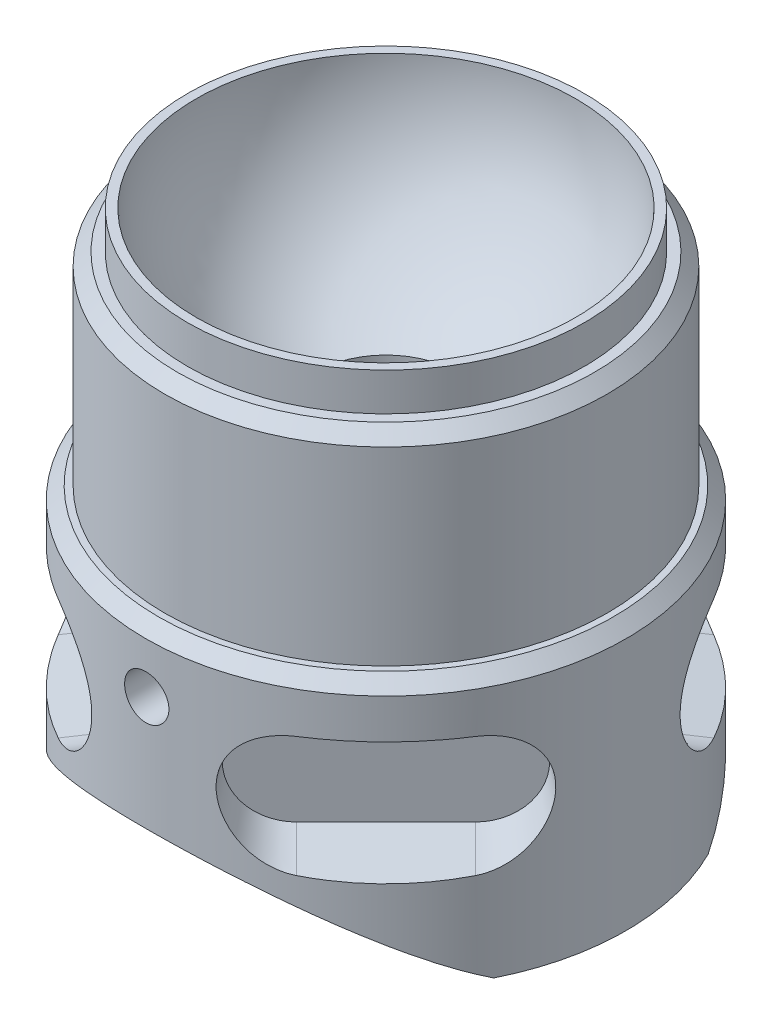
ISO-10303-21;
HEADER;
FILE_DESCRIPTION(('STEP AP214'),'2;1');
FILE_NAME('part.step','',(''),(''),'','','');
FILE_SCHEMA(('AUTOMOTIVE_DESIGN { 1 0 10303 214 1 1 1 1 }'));
ENDSEC;
DATA;
#1=APPLICATION_CONTEXT('core data for automotive mechanical design processes');
#2=APPLICATION_PROTOCOL_DEFINITION('international standard','automotive_design',2000,#1);
#3=PRODUCT_CONTEXT('',#1,'mechanical');
#4=PRODUCT('Part','Part','',(#3));
#5=PRODUCT_RELATED_PRODUCT_CATEGORY('part','',(#4));
#6=PRODUCT_DEFINITION_FORMATION('','',#4);
#7=PRODUCT_DEFINITION_CONTEXT('part definition',#1,'design');
#8=PRODUCT_DEFINITION('design','',#6,#7);
#9=PRODUCT_DEFINITION_SHAPE('','',#8);
#10=(LENGTH_UNIT() NAMED_UNIT(*) SI_UNIT(.MILLI.,.METRE.));
#11=(NAMED_UNIT(*) PLANE_ANGLE_UNIT() SI_UNIT($,.RADIAN.));
#12=(NAMED_UNIT(*) SI_UNIT($,.STERADIAN.) SOLID_ANGLE_UNIT());
#13=UNCERTAINTY_MEASURE_WITH_UNIT(LENGTH_MEASURE(1.E-05),#10,'distance_accuracy_value','');
#14=(GEOMETRIC_REPRESENTATION_CONTEXT(3) GLOBAL_UNCERTAINTY_ASSIGNED_CONTEXT((#13)) GLOBAL_UNIT_ASSIGNED_CONTEXT((#10,
#11,#12)) REPRESENTATION_CONTEXT('',''));
#15=CARTESIAN_POINT('',(0.,0.,0.));
#16=DIRECTION('',(0.,0.,1.));
#17=DIRECTION('',(1.,0.,0.));
#18=AXIS2_PLACEMENT_3D('',#15,#16,#17);
#19=CARTESIAN_POINT('',(0.,40.,0.));
#20=DIRECTION('',(0.,-1.,0.));
#21=DIRECTION('',(0.,0.,-1.));
#22=AXIS2_PLACEMENT_3D('',#19,#20,#21);
#23=CYLINDRICAL_SURFACE('',#22,19.);
#24=CARTESIAN_POINT('',(1.75,16.,18.9192362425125));
#25=CARTESIAN_POINT('',(1.749995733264,15.9019256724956,18.9192373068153));
#26=CARTESIAN_POINT('',(1.74172775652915,15.8037855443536,18.920007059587));
#27=CARTESIAN_POINT('',(1.70886851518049,15.6102234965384,18.9230026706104));
#28=CARTESIAN_POINT('',(1.68425901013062,15.5148047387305,18.925230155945));
#29=CARTESIAN_POINT('',(1.61943696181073,15.3295167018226,18.9308868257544));
#30=CARTESIAN_POINT('',(1.57923357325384,15.2396442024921,18.9343153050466));
#31=CARTESIAN_POINT('',(1.48438193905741,15.0679433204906,18.9419867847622));
#32=CARTESIAN_POINT('',(1.42973667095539,14.9861132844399,18.946229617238));
#33=CARTESIAN_POINT('',(1.30736968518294,14.8325456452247,18.9550665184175));
#34=CARTESIAN_POINT('',(1.23961231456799,14.7608365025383,18.959661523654));
#35=CARTESIAN_POINT('',(1.09302037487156,14.6297910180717,18.9686764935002));
#36=CARTESIAN_POINT('',(1.01418531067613,14.5704552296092,18.973096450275));
#37=CARTESIAN_POINT('',(0.847503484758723,14.4657440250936,18.9812723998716));
#38=CARTESIAN_POINT('',(0.759640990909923,14.4203935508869,18.9850272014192));
#39=CARTESIAN_POINT('',(0.577507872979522,14.3450998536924,18.9914396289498));
#40=CARTESIAN_POINT('',(0.483237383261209,14.315156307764,18.9940972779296));
#41=CARTESIAN_POINT('',(0.291250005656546,14.2716092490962,18.9980093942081));
#42=CARTESIAN_POINT('',(0.193543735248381,14.2579592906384,18.9992678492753));
#43=CARTESIAN_POINT('',(-0.00278053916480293,14.2472432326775,19.0002533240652));
#44=CARTESIAN_POINT('',(-0.101398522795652,14.2501767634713,18.9999803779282));
#45=CARTESIAN_POINT('',(-0.296431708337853,14.2725065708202,18.9979370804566));
#46=CARTESIAN_POINT('',(-0.392852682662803,14.2918529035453,18.996171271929));
#47=CARTESIAN_POINT('',(-0.581073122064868,14.3463814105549,18.9913460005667));
#48=CARTESIAN_POINT('',(-0.67287253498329,14.3815637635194,18.9882865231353));
#49=CARTESIAN_POINT('',(-0.849402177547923,14.4668208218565,18.9812101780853));
#50=CARTESIAN_POINT('',(-0.934121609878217,14.5169177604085,18.9771918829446));
#51=CARTESIAN_POINT('',(-1.09396858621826,14.6305657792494,18.9686491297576));
#52=CARTESIAN_POINT('',(-1.16909589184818,14.6941171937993,18.9641246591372));
#53=CARTESIAN_POINT('',(-1.30791830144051,14.8331513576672,18.9550578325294));
#54=CARTESIAN_POINT('',(-1.3715699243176,14.9086775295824,18.9505154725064));
#55=CARTESIAN_POINT('',(-1.48529785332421,15.0693663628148,18.9419416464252));
#56=CARTESIAN_POINT('',(-1.53537414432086,15.1545290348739,18.9379101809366));
#57=CARTESIAN_POINT('',(-1.62052899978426,15.3321053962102,18.9308140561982));
#58=CARTESIAN_POINT('',(-1.65560509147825,15.4245202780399,18.9277495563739));
#59=CARTESIAN_POINT('',(-1.70973055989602,15.613962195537,18.9229375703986));
#60=CARTESIAN_POINT('',(-1.72878034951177,15.7109891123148,18.9211900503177));
#61=CARTESIAN_POINT('',(-1.75025696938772,15.9065197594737,18.9192155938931));
#62=CARTESIAN_POINT('',(-1.75274453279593,16.0050167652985,18.9189831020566));
#63=CARTESIAN_POINT('',(-1.74118538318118,16.2010262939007,18.9200503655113));
#64=CARTESIAN_POINT('',(-1.72713885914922,16.2985388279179,18.9213501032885));
#65=CARTESIAN_POINT('',(-1.68296098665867,16.4896356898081,18.925330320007));
#66=CARTESIAN_POINT('',(-1.65285816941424,16.5832266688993,18.9280083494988));
#67=CARTESIAN_POINT('',(-1.57745128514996,16.7640301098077,18.9344413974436));
#68=CARTESIAN_POINT('',(-1.53214692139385,16.8512424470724,18.9381964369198));
#69=CARTESIAN_POINT('',(-1.4274700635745,17.0170903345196,18.9463738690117));
#70=CARTESIAN_POINT('',(-1.36805721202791,17.0957003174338,18.9507981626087));
#71=CARTESIAN_POINT('',(-1.23690795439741,17.2418532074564,18.9598092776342));
#72=CARTESIAN_POINT('',(-1.16517128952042,17.3093958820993,18.9643961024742));
#73=CARTESIAN_POINT('',(-1.01114777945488,17.4317052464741,18.9732321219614));
#74=CARTESIAN_POINT('',(-0.92882946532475,17.486432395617,18.9774802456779));
#75=CARTESIAN_POINT('',(-0.756135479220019,17.5812855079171,18.9851447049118));
#76=CARTESIAN_POINT('',(-0.665759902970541,17.6214116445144,18.9885610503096));
#77=CARTESIAN_POINT('',(-0.479656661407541,17.6858562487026,18.9941721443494));
#78=CARTESIAN_POINT('',(-0.383937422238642,17.7101988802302,18.9963687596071));
#79=CARTESIAN_POINT('',(-0.189749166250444,17.7424643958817,18.9993005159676));
#80=CARTESIAN_POINT('',(-0.0912802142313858,17.750387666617,19.0000356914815));
#81=CARTESIAN_POINT('',(0.105223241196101,17.7495845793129,18.9999617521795));
#82=CARTESIAN_POINT('',(0.203258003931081,17.7409197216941,18.9991583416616));
#83=CARTESIAN_POINT('',(0.396473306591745,17.7073149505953,18.9961087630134));
#84=CARTESIAN_POINT('',(0.491653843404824,17.6823750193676,18.9938625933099));
#85=CARTESIAN_POINT('',(0.676460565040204,17.6169444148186,18.9881793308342));
#86=CARTESIAN_POINT('',(0.76608727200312,17.576455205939,18.9847423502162));
#87=CARTESIAN_POINT('',(0.93728156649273,17.4810821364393,18.9770612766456));
#88=CARTESIAN_POINT('',(1.01884924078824,17.4261984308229,18.9728171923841));
#89=CARTESIAN_POINT('',(1.17192514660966,17.3033633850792,18.9639790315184));
#90=CARTESIAN_POINT('',(1.24339664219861,17.2353663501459,18.9593837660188));
#91=CARTESIAN_POINT('',(1.37394415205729,17.0883219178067,18.9503712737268));
#92=CARTESIAN_POINT('',(1.43301717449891,17.0092718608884,18.945954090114));
#93=CARTESIAN_POINT('',(1.5371900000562,16.8421787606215,18.9377874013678));
#94=CARTESIAN_POINT('',(1.5822586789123,16.7541162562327,18.9340393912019));
#95=CARTESIAN_POINT('',(1.6569107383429,16.5716972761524,18.9276534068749));
#96=CARTESIAN_POINT('',(1.68651175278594,16.4773481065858,18.9250141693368));
#97=CARTESIAN_POINT('',(1.7219282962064,16.318711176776,18.9218166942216));
#98=CARTESIAN_POINT('',(1.73244099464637,16.2554407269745,18.9208535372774));
#99=CARTESIAN_POINT('',(1.74647822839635,16.1281228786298,18.9195629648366));
#100=CARTESIAN_POINT('',(1.75000278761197,16.0640754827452,18.9192355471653));
#101=CARTESIAN_POINT('',(1.75,16.,18.9192362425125));
#102=B_SPLINE_CURVE_WITH_KNOTS('',3,(#24,#25,#26,#27,#28,#29,#30,#31,#32,#33,#34,#35,#36,#37,
#38,#39,#40,#41,#42,#43,#44,#45,#46,#47,#48,#49,#50,#51,#52,#53,#54,#55,#56,#57,#58,#59,#60,#61,
#62,#63,#64,#65,#66,#67,#68,#69,#70,#71,#72,#73,#74,#75,#76,#77,#78,#79,#80,#81,#82,#83,#84,#85,
#86,#87,#88,#89,#90,#91,#92,#93,#94,#95,#96,#97,#98,#99,#100,#101),.UNSPECIFIED.,.T.,.F.,(4,2,2,
2,2,2,2,2,2,2,2,2,2,2,2,2,2,2,2,2,2,2,2,2,2,2,2,2,2,2,2,2,2,2,2,2,2,2,4),(0.,0.29398901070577,
0.588306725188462,0.882451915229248,1.17653650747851,1.47143227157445,1.76634122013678,
2.06177311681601,2.35719882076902,2.65178037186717,2.94635535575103,3.24003715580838,
3.53372226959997,3.82784739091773,4.12197982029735,4.41720430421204,4.71242911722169,
5.00770257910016,5.30296843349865,5.59715095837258,5.89133012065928,6.18498827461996,
6.47865216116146,6.77316641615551,7.06768685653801,7.36310436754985,7.65851836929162,
7.95347902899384,8.24843274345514,8.54229503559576,8.83615764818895,9.12999259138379,
9.42382437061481,9.71869916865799,10.0136450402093,10.3092418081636,10.6045008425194,
10.7965750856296,10.9886486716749),.UNSPECIFIED.);
#103=CARTESIAN_POINT('',(1.75,16.,18.9192362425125));
#104=VERTEX_POINT('',#103);
#105=EDGE_CURVE('E37',#104,#104,#102,.T.);
#106=ORIENTED_EDGE('',*,*,#105,.T.);
#107=EDGE_LOOP('',(#106));
#108=FACE_BOUND('',#107,.T.);
#109=CARTESIAN_POINT('',(0.,20.,0.));
#110=DIRECTION('',(0.,1.,0.));
#111=DIRECTION('',(0.,0.,1.));
#112=AXIS2_PLACEMENT_3D('',#109,#110,#111);
#113=CIRCLE('',#112,19.);
#114=CARTESIAN_POINT('',(0.,20.,19.));
#115=VERTEX_POINT('',#114);
#116=EDGE_CURVE('E367',#115,#115,#113,.F.);
#117=ORIENTED_EDGE('',*,*,#116,.T.);
#118=EDGE_LOOP('',(#117));
#119=FACE_BOUND('',#118,.T.);
#120=CARTESIAN_POINT('',(0.,0.,0.));
#121=DIRECTION('',(0.,1.,0.));
#122=DIRECTION('',(0.,0.,1.));
#123=AXIS2_PLACEMENT_3D('',#120,#121,#122);
#124=CIRCLE('',#123,19.);
#125=CARTESIAN_POINT('',(-17.0029409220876,0.,-8.47938677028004));
#126=VERTEX_POINT('',#125);
#127=CARTESIAN_POINT('',(-17.0029409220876,0.,8.47938677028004));
#128=VERTEX_POINT('',#127);
#129=EDGE_CURVE('E318',#126,#128,#124,.T.);
#130=ORIENTED_EDGE('',*,*,#129,.T.);
#131=CARTESIAN_POINT('',(0.,7.,-19.));
#132=CARTESIAN_POINT('',(-0.458385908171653,6.99999735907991,-18.999997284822));
#133=CARTESIAN_POINT('',(-0.916816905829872,6.986920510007,-18.9833837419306));
#134=CARTESIAN_POINT('',(-1.83000305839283,6.93491044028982,-18.9172096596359));
#135=CARTESIAN_POINT('',(-2.28475631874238,6.89596465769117,-18.867633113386));
#136=CARTESIAN_POINT('',(-3.18752372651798,6.79303566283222,-18.7362782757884));
#137=CARTESIAN_POINT('',(-3.63552456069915,6.72900837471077,-18.6544432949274));
#138=CARTESIAN_POINT('',(-4.52061963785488,6.5773705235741,-18.4599381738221));
#139=CARTESIAN_POINT('',(-4.957714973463,6.48976233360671,-18.3472711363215));
#140=CARTESIAN_POINT('',(-5.81556194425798,6.29342481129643,-18.0935920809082));
#141=CARTESIAN_POINT('',(-6.23639892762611,6.18483146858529,-17.9527623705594));
#142=CARTESIAN_POINT('',(-7.06240884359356,5.94825707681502,-17.6441716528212));
#143=CARTESIAN_POINT('',(-7.46758171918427,5.82027595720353,-17.476410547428));
#144=CARTESIAN_POINT('',(-8.26051101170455,5.54718619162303,-17.1158877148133));
#145=CARTESIAN_POINT('',(-8.64827092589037,5.40208100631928,-16.923131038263));
#146=CARTESIAN_POINT('',(-9.40529946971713,5.09701045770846,-16.5144017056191));
#147=CARTESIAN_POINT('',(-9.77456435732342,4.93704210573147,-16.2984243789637));
#148=CARTESIAN_POINT('',(-10.6159651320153,4.54805093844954,-15.7678689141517));
#149=CARTESIAN_POINT('',(-11.080418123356,4.31403444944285,-15.4447243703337));
#150=CARTESIAN_POINT('',(-11.9733408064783,3.82903564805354,-14.7632911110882));
#151=CARTESIAN_POINT('',(-12.4017992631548,3.5780480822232,-14.4049914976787));
#152=CARTESIAN_POINT('',(-13.2230779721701,3.064053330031,-13.655045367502));
#153=CARTESIAN_POINT('',(-13.6158012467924,2.80101618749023,-13.2633133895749));
#154=CARTESIAN_POINT('',(-14.3638662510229,2.26938140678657,-12.4492945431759));
#155=CARTESIAN_POINT('',(-14.7192120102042,2.00078437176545,-12.0270109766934));
#156=CARTESIAN_POINT('',(-15.3970085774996,1.4603503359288,-11.1465369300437));
#157=CARTESIAN_POINT('',(-15.7189046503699,1.18852315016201,-10.687912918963));
#158=CARTESIAN_POINT('',(-16.3229636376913,0.652985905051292,-9.74046628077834));
#159=CARTESIAN_POINT('',(-16.6051145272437,0.389278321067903,-9.25163457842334));
#160=CARTESIAN_POINT('',(-17.1272391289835,-0.120241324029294,-8.24488850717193));
#161=CARTESIAN_POINT('',(-17.3673310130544,-0.366102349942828,-7.72706119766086));
#162=CARTESIAN_POINT('',(-17.6942840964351,-0.713449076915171,-6.92784442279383));
#163=CARTESIAN_POINT('',(-17.7977120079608,-0.825627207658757,-6.65777596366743));
#164=CARTESIAN_POINT('',(-17.9931170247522,-1.04126382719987,-6.11001778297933));
#165=CARTESIAN_POINT('',(-18.0850920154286,-1.14472070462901,-5.83232666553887));
#166=CARTESIAN_POINT('',(-18.2718594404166,-1.35806883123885,-5.22093791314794));
#167=CARTESIAN_POINT('',(-18.3643947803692,-1.46598517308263,-4.88585084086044));
#168=CARTESIAN_POINT('',(-18.5318527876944,-1.66420707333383,-4.20628397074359));
#169=CARTESIAN_POINT('',(-18.6067819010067,-1.7545190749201,-3.8618076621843));
#170=CARTESIAN_POINT('',(-18.7378426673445,-1.9143037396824,-3.16521279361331));
#171=CARTESIAN_POINT('',(-18.7940108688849,-1.98381689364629,-2.81311053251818));
#172=CARTESIAN_POINT('',(-18.8867134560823,-2.09941599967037,-2.10247837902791));
#173=CARTESIAN_POINT('',(-18.9232480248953,-2.14550217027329,-1.74394854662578));
#174=CARTESIAN_POINT('',(-18.97608630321,-2.21237936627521,-1.02019052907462));
#175=CARTESIAN_POINT('',(-18.9922306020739,-2.23297105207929,-0.654931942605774));
#176=CARTESIAN_POINT('',(-19.0033655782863,-2.24715854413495,0.07642446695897));
#177=CARTESIAN_POINT('',(-18.9983570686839,-2.24075538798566,0.442522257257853));
#178=CARTESIAN_POINT('',(-18.96730008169,-2.20126616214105,1.17267966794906));
#179=CARTESIAN_POINT('',(-18.9412331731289,-2.16815671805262,1.53673722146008));
#180=CARTESIAN_POINT('',(-18.8686556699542,-2.07685524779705,2.25961704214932));
#181=CARTESIAN_POINT('',(-18.8221421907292,-2.01865968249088,2.61843856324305));
#182=CARTESIAN_POINT('',(-18.6996294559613,-1.86741419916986,3.39161298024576));
#183=CARTESIAN_POINT('',(-18.6198613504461,-1.77001051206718,3.80451430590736));
#184=CARTESIAN_POINT('',(-18.4351121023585,-1.54904466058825,4.61741792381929));
#185=CARTESIAN_POINT('',(-18.3301251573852,-1.4254764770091,5.01741722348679));
#186=CARTESIAN_POINT('',(-18.0964311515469,-1.15708359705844,5.80413518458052));
#187=CARTESIAN_POINT('',(-17.9676688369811,-1.01220954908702,6.19082036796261));
#188=CARTESIAN_POINT('',(-17.6880938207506,-0.706252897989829,6.94944558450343));
#189=CARTESIAN_POINT('',(-17.5372794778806,-0.545169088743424,7.32138451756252));
#190=CARTESIAN_POINT('',(-17.1420625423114,-0.135728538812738,8.21488278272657));
#191=CARTESIAN_POINT('',(-16.8861135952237,0.119242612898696,8.72832880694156));
#192=CARTESIAN_POINT('',(-16.3326757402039,0.643587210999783,9.72463938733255));
#193=CARTESIAN_POINT('',(-16.0351694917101,0.912966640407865,10.2074910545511));
#194=CARTESIAN_POINT('',(-15.3997065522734,1.4577105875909,11.1431194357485));
#195=CARTESIAN_POINT('',(-15.0617066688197,1.73308123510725,11.5958632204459));
#196=CARTESIAN_POINT('',(-14.3463287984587,2.28215659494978,12.4700348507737));
#197=CARTESIAN_POINT('',(-13.9689567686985,2.55586155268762,12.8914674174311));
#198=CARTESIAN_POINT('',(-13.1672554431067,3.10056569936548,13.7097752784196));
#199=CARTESIAN_POINT('',(-12.7421359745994,3.37140044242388,14.1059882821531));
#200=CARTESIAN_POINT('',(-11.8518285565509,3.89814259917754,14.8618716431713));
#201=CARTESIAN_POINT('',(-11.3866349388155,4.15404789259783,15.2215368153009));
#202=CARTESIAN_POINT('',(-10.4181967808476,4.64397197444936,15.8999881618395));
#203=CARTESIAN_POINT('',(-9.91504472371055,4.87804103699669,16.2188688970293));
#204=CARTESIAN_POINT('',(-9.13289389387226,5.20828528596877,16.6637399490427));
#205=CARTESIAN_POINT('',(-8.86764216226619,5.31487784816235,16.8064391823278));
#206=CARTESIAN_POINT('',(-8.32819185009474,5.52039984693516,17.0801849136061));
#207=CARTESIAN_POINT('',(-8.0539911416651,5.61932744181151,17.2112286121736));
#208=CARTESIAN_POINT('',(-7.38211847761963,5.8478139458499,17.5125726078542));
#209=CARTESIAN_POINT('',(-6.98022019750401,5.97315101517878,17.6767357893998));
#210=CARTESIAN_POINT('',(-6.16134163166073,6.20468620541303,17.9785492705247));
#211=CARTESIAN_POINT('',(-5.7443651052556,6.31088905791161,18.1162061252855));
#212=CARTESIAN_POINT('',(-4.89758260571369,6.50215530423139,18.3632257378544));
#213=CARTESIAN_POINT('',(-4.4677834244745,6.58722967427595,18.4726031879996));
#214=CARTESIAN_POINT('',(-3.59780282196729,6.73457539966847,18.6615632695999));
#215=CARTESIAN_POINT('',(-3.15762110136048,6.79684609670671,18.7411450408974));
#216=CARTESIAN_POINT('',(-2.26801010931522,6.89745074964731,18.8695253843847));
#217=CARTESIAN_POINT('',(-1.81854809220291,6.93567551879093,18.918183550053));
#218=CARTESIAN_POINT('',(-0.915855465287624,6.98686109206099,18.9833076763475));
#219=CARTESIAN_POINT('',(-0.462624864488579,6.99982195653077,18.9997737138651));
#220=CARTESIAN_POINT('',(0.443845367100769,7.00017439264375,19.000221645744));
#221=CARTESIAN_POINT('',(0.897084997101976,6.98756680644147,18.9842046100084));
#222=CARTESIAN_POINT('',(1.79983743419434,6.93708051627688,18.9199720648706));
#223=CARTESIAN_POINT('',(2.24935037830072,6.89920274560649,18.8717577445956));
#224=CARTESIAN_POINT('',(3.11052399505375,6.8024918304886,18.7483524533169));
#225=CARTESIAN_POINT('',(3.52266742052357,6.74527285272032,18.6752368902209));
#226=CARTESIAN_POINT('',(4.33806753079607,6.61077446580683,18.502832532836));
#227=CARTESIAN_POINT('',(4.74132470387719,6.53349616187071,18.4035451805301));
#228=CARTESIAN_POINT('',(5.53679602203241,6.36025590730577,18.1800609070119));
#229=CARTESIAN_POINT('',(5.92900872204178,6.26429152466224,18.0558607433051));
#230=CARTESIAN_POINT('',(6.70052158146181,6.05528552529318,17.7839908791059));
#231=CARTESIAN_POINT('',(7.07982100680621,5.94224293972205,17.6363198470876));
#232=CARTESIAN_POINT('',(7.85217345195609,5.69169238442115,17.307012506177));
#233=CARTESIAN_POINT('',(8.24410034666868,5.55298123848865,17.1236529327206));
#234=CARTESIAN_POINT('',(9.00997307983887,5.26006510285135,16.7333544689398));
#235=CARTESIAN_POINT('',(9.38391820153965,5.10585949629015,16.5264146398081));
#236=CARTESIAN_POINT('',(10.1129637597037,4.78420266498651,16.0906298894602));
#237=CARTESIAN_POINT('',(10.4680597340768,4.61674832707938,15.8617798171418));
#238=CARTESIAN_POINT('',(11.1587152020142,4.27089580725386,15.3837415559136));
#239=CARTESIAN_POINT('',(11.4942720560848,4.09249615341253,15.1345506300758));
#240=CARTESIAN_POINT('',(12.2086106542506,3.69156953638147,14.5669622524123));
#241=CARTESIAN_POINT('',(12.5831466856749,3.46719679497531,14.2445180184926));
#242=CARTESIAN_POINT('',(13.3033498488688,3.00999409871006,13.5743478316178));
#243=CARTESIAN_POINT('',(13.6490128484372,2.77716294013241,13.2266182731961));
#244=CARTESIAN_POINT('',(14.3115859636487,2.30677940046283,12.5067241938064));
#245=CARTESIAN_POINT('',(14.6284574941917,2.06922118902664,12.1345280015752));
#246=CARTESIAN_POINT('',(15.232582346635,1.59402814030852,11.3669251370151));
#247=CARTESIAN_POINT('',(15.5198377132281,1.35639330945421,10.9715200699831));
#248=CARTESIAN_POINT('',(16.0584281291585,0.890879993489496,10.1664371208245));
#249=CARTESIAN_POINT('',(16.3103972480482,0.662901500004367,9.75724171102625));
#250=CARTESIAN_POINT('',(16.7846643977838,0.216736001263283,8.91672130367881));
#251=CARTESIAN_POINT('',(17.0069577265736,-0.00144944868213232,8.48539281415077));
#252=CARTESIAN_POINT('',(17.420109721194,-0.421315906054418,7.60115521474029));
#253=CARTESIAN_POINT('',(17.6110191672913,-0.623023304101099,7.14828252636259));
#254=CARTESIAN_POINT('',(17.9597375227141,-1.00265545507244,6.22038489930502));
#255=CARTESIAN_POINT('',(18.1175629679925,-1.18059207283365,5.74537117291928));
#256=CARTESIAN_POINT('',(18.3528250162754,-1.452305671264,4.92874119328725));
#257=CARTESIAN_POINT('',(18.4398596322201,-1.55484348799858,4.59278786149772));
#258=CARTESIAN_POINT('',(18.5962222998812,-1.74163033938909,3.91183647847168));
#259=CARTESIAN_POINT('',(18.6655561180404,-1.82588532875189,3.56684141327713));
#260=CARTESIAN_POINT('',(18.7853532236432,-1.97297716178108,2.86972521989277));
#261=CARTESIAN_POINT('',(18.8358512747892,-2.0358534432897,2.51761849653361));
#262=CARTESIAN_POINT('',(18.9171852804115,-2.13777553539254,1.80768274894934));
#263=CARTESIAN_POINT('',(18.9480216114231,-2.1768218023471,1.4498538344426));
#264=CARTESIAN_POINT('',(18.9894767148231,-2.22942933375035,0.728729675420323));
#265=CARTESIAN_POINT('',(18.9999596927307,-2.24281941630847,0.365413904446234));
#266=CARTESIAN_POINT('',(19.0000400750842,-2.24292195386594,-0.361213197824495));
#267=CARTESIAN_POINT('',(18.9896379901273,-2.22963506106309,-0.724524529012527));
#268=CARTESIAN_POINT('',(18.9481834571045,-2.17702615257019,-1.44842370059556));
#269=CARTESIAN_POINT('',(18.9171095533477,-2.13767708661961,-1.80900831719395));
#270=CARTESIAN_POINT('',(18.8349985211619,-2.03478839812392,-2.52438942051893));
#271=CARTESIAN_POINT('',(18.7839584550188,-1.9712452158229,-2.87918504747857));
#272=CARTESIAN_POINT('',(18.6500389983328,-1.80685697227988,-3.65545672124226));
#273=CARTESIAN_POINT('',(18.5626997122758,-1.7009558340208,-4.07509091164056));
#274=CARTESIAN_POINT('',(18.3620788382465,-1.46304042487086,-4.90047197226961));
#275=CARTESIAN_POINT('',(18.2487903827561,-1.33101924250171,-5.30621513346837));
#276=CARTESIAN_POINT('',(17.9978135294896,-1.04604691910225,-6.10359230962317));
#277=CARTESIAN_POINT('',(17.8600683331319,-0.893047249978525,-6.49519087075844));
#278=CARTESIAN_POINT('',(17.5618815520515,-0.571370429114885,-7.26291460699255));
#279=CARTESIAN_POINT('',(17.4014385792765,-0.402692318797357,-7.63903883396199));
#280=CARTESIAN_POINT('',(16.9842055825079,0.0221369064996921,-8.53683949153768));
#281=CARTESIAN_POINT('',(16.7159374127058,0.284320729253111,-9.05035313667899));
#282=CARTESIAN_POINT('',(16.1371678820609,0.821377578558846,-10.0460725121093));
#283=CARTESIAN_POINT('',(15.8266497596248,1.09625561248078,-10.5282657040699));
#284=CARTESIAN_POINT('',(15.1643627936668,1.65029808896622,-11.4616670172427));
#285=CARTESIAN_POINT('',(14.8125543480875,1.92946641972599,-11.9128447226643));
#286=CARTESIAN_POINT('',(14.0686663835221,2.48442112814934,-12.7828044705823));
#287=CARTESIAN_POINT('',(13.6765929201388,2.76020800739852,-13.2015913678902));
#288=CARTESIAN_POINT('',(12.8462753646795,3.30595994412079,-14.0112279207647));
#289=CARTESIAN_POINT('',(12.4074178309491,3.57577186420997,-14.4015535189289));
#290=CARTESIAN_POINT('',(11.4891321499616,4.09856433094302,-15.1442566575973));
#291=CARTESIAN_POINT('',(11.0096977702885,4.3515422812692,-15.4966283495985));
#292=CARTESIAN_POINT('',(10.012630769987,4.83353221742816,-16.1587298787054));
#293=CARTESIAN_POINT('',(9.49508495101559,5.06259595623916,-16.468552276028));
#294=CARTESIAN_POINT('',(8.42324010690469,5.49076097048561,-17.0416495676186));
#295=CARTESIAN_POINT('',(7.86896159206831,5.6898787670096,-17.304950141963));
#296=CARTESIAN_POINT('',(6.90482371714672,5.99554991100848,-17.7060765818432));
#297=CARTESIAN_POINT('',(6.50357384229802,6.11164542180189,-17.8574748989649));
#298=CARTESIAN_POINT('',(5.68711245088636,6.32460568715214,-18.134012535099));
#299=CARTESIAN_POINT('',(5.27190194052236,6.42147182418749,-18.2591537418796));
#300=CARTESIAN_POINT('',(4.43067756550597,6.59395855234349,-18.4812865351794));
#301=CARTESIAN_POINT('',(4.00468892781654,6.66962450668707,-18.578338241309));
#302=CARTESIAN_POINT('',(3.14387929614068,6.79843985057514,-18.7432101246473));
#303=CARTESIAN_POINT('',(2.70906202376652,6.85159852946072,-18.8110423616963));
#304=CARTESIAN_POINT('',(1.89571684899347,6.92843770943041,-18.9089776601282));
#305=CARTESIAN_POINT('',(1.51795716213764,6.95523086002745,-18.9430687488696));
#306=CARTESIAN_POINT('',(0.760142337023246,6.99101523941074,-18.988583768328));
#307=CARTESIAN_POINT('',(0.38008666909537,7.00000218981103,-19.0000022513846));
#308=CARTESIAN_POINT('',(0.,7.,-19.));
#309=B_SPLINE_CURVE_WITH_KNOTS('',3,(#131,#132,#133,#134,#135,#136,#137,#138,#139,#140,#141,
#142,#143,#144,#145,#146,#147,#148,#149,#150,#151,#152,#153,#154,#155,#156,#157,#158,#159,#160,
#161,#162,#163,#164,#165,#166,#167,#168,#169,#170,#171,#172,#173,#174,#175,#176,#177,#178,#179,
#180,#181,#182,#183,#184,#185,#186,#187,#188,#189,#190,#191,#192,#193,#194,#195,#196,#197,#198,
#199,#200,#201,#202,#203,#204,#205,#206,#207,#208,#209,#210,#211,#212,#213,#214,#215,#216,#217,
#218,#219,#220,#221,#222,#223,#224,#225,#226,#227,#228,#229,#230,#231,#232,#233,#234,#235,#236,
#237,#238,#239,#240,#241,#242,#243,#244,#245,#246,#247,#248,#249,#250,#251,#252,#253,#254,#255,
#256,#257,#258,#259,#260,#261,#262,#263,#264,#265,#266,#267,#268,#269,#270,#271,#272,#273,#274,
#275,#276,#277,#278,#279,#280,#281,#282,#283,#284,#285,#286,#287,#288,#289,#290,#291,#292,#293,
#294,#295,#296,#297,#298,#299,#300,#301,#302,#303,#304,#305,#306,#307,#308),.UNSPECIFIED.,.T.,
.F.,(4,2,2,2,2,2,2,2,2,2,2,2,2,2,2,2,2,2,2,2,2,2,2,2,2,2,2,2,2,2,2,2,2,2,2,2,2,2,2,2,2,2,2,2,2,
2,2,2,2,2,2,2,2,2,2,2,2,2,2,2,2,2,2,2,2,2,2,2,2,2,2,2,2,2,2,2,2,2,2,2,2,2,2,2,2,2,2,2,4),(0.,
1.37475345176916,2.75017497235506,4.12802445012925,5.50573532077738,6.87480075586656,
8.24387117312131,9.61266538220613,10.9817354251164,12.8160306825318,14.6508963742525,
16.490601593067,18.3301082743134,20.1964174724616,22.0632901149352,23.9248302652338,
24.855050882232,25.785442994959,26.876529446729,27.9672158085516,29.0557648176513,
30.144303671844,31.2413010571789,32.3382562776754,33.4361726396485,34.5342439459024,
35.8272728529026,37.1205995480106,38.4169706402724,39.7134382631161,41.5941895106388,
43.4757278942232,45.3592913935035,47.2425703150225,49.1636317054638,51.084965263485,
53.0017600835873,53.9599124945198,54.9182944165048,56.2724616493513,57.6262935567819,
58.9794206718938,60.3325868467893,61.6918538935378,63.051117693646,64.4103367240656,
65.7695055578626,67.035519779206,68.3014642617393,69.5675736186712,70.8337548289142,
72.1956030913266,73.5575055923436,74.9197290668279,76.2821361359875,77.9088865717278,
79.5358694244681,81.1650014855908,82.7940209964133,84.388391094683,85.9830135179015,
87.5750298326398,89.1662485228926,90.2510070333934,91.3354117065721,92.4178049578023,
93.5001774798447,94.5897469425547,95.6792897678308,96.7699652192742,97.8608012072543,
99.1833127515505,100.506174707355,101.832150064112,103.158206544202,105.063322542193,
106.969196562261,108.876913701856,110.784344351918,112.720892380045,114.657738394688,
116.590301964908,118.521795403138,119.853429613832,121.184968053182,122.513635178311,
123.841753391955,124.98140438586,126.121329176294),.UNSPECIFIED.);
#310=CARTESIAN_POINT('',(17.0029409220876,0.,8.47938677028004));
#311=VERTEX_POINT('',#310);
#312=EDGE_CURVE('E291',#128,#311,#309,.T.);
#313=ORIENTED_EDGE('',*,*,#312,.T.);
#314=CARTESIAN_POINT('',(17.0029409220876,0.,-8.47938677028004));
#315=VERTEX_POINT('',#314);
#316=EDGE_CURVE('E321',#311,#315,#124,.T.);
#317=ORIENTED_EDGE('',*,*,#316,.T.);
#318=EDGE_CURVE('E296',#315,#126,#309,.T.);
#319=ORIENTED_EDGE('',*,*,#318,.T.);
#320=EDGE_LOOP('',(#130,#313,#317,#319));
#321=FACE_BOUND('',#320,.T.);
#322=CARTESIAN_POINT('',(0.,9.81081669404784,0.));
#323=DIRECTION('',(-0.0984102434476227,-0.99026806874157,-0.0984102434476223));
#324=DIRECTION('',(0.700225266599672,-0.139173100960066,0.700225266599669));
#325=AXIS2_PLACEMENT_3D('',#322,#323,#324);
#326=ELLIPSE('',#325,19.1867238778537,19.);
#327=CARTESIAN_POINT('',(16.4970153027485,7.23466064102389,9.42594749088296));
#328=VERTEX_POINT('',#327);
#329=CARTESIAN_POINT('',(9.42594749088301,7.23466064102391,16.4970153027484));
#330=VERTEX_POINT('',#329);
#331=EDGE_CURVE('E324',#328,#330,#326,.T.);
#332=ORIENTED_EDGE('',*,*,#331,.T.);
#333=CARTESIAN_POINT('',(10.6068017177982,7.3845441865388,15.7637482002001));
#334=CARTESIAN_POINT('',(10.4994700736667,7.35092805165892,15.8359837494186));
#335=CARTESIAN_POINT('',(10.390207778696,7.32284664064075,15.9078934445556));
#336=CARTESIAN_POINT('',(10.1686457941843,7.27775744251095,16.0504159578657));
#337=CARTESIAN_POINT('',(10.0563471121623,7.26074602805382,16.1210291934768));
#338=CARTESIAN_POINT('',(9.82983042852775,7.23781597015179,16.2601372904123));
#339=CARTESIAN_POINT('',(9.71561977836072,7.23186175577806,16.3286382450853));
#340=CARTESIAN_POINT('',(9.48577041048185,7.23079187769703,16.4632298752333));
#341=CARTESIAN_POINT('',(9.37013161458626,7.23567681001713,16.5293204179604));
#342=CARTESIAN_POINT('',(9.02250080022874,7.26629807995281,16.7231724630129));
#343=CARTESIAN_POINT('',(8.78938655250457,7.30796136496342,16.8467646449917));
#344=CARTESIAN_POINT('',(8.32693086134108,7.43140231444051,17.0800931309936));
#345=CARTESIAN_POINT('',(8.09759218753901,7.5132081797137,17.1898196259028));
#346=CARTESIAN_POINT('',(7.63693575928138,7.71929834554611,17.3995543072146));
#347=CARTESIAN_POINT('',(7.40614097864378,7.84557922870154,17.4987548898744));
#348=CARTESIAN_POINT('',(6.96218949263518,8.13582110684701,17.6800893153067));
#349=CARTESIAN_POINT('',(6.74904031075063,8.29979806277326,17.7622159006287));
#350=CARTESIAN_POINT('',(6.33752204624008,8.67083861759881,17.9132937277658));
#351=CARTESIAN_POINT('',(6.14035784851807,8.87959593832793,17.981420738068));
#352=CARTESIAN_POINT('',(5.87145365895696,9.21726604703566,18.0702801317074));
#353=CARTESIAN_POINT('',(5.78625290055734,9.33398317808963,18.0976895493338));
#354=CARTESIAN_POINT('',(5.62587721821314,9.57496876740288,18.1481831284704));
#355=CARTESIAN_POINT('',(5.55069707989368,9.69923324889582,18.1712695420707));
#356=CARTESIAN_POINT('',(5.41411359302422,9.94969595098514,18.2124209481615));
#357=CARTESIAN_POINT('',(5.35229647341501,10.0756429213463,18.230642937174));
#358=CARTESIAN_POINT('',(5.23997107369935,10.3329009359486,18.2632451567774));
#359=CARTESIAN_POINT('',(5.18945701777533,10.4642091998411,18.2776273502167));
#360=CARTESIAN_POINT('',(5.10062833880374,10.7311515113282,18.3026151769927));
#361=CARTESIAN_POINT('',(5.06230579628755,10.8667826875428,18.3132232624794));
#362=CARTESIAN_POINT('',(4.99857058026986,11.1412781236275,18.3307225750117));
#363=CARTESIAN_POINT('',(4.97315628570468,11.280141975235,18.3376142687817));
#364=CARTESIAN_POINT('',(4.93781400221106,11.5444760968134,18.3471601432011));
#365=CARTESIAN_POINT('',(4.92649520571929,11.6697483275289,18.3501956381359));
#366=CARTESIAN_POINT('',(4.91470769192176,11.9208361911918,18.3533563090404));
#367=CARTESIAN_POINT('',(4.9142382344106,12.0466517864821,18.3534816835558));
#368=CARTESIAN_POINT('',(4.92415673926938,12.2977958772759,18.3508230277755));
#369=CARTESIAN_POINT('',(4.93454254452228,12.4231244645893,18.3480395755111));
#370=CARTESIAN_POINT('',(4.96598500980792,12.6723315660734,18.3395544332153));
#371=CARTESIAN_POINT('',(4.98704159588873,12.7962100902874,18.3338527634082));
#372=CARTESIAN_POINT('',(5.03807643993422,13.0350521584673,18.3198920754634));
#373=CARTESIAN_POINT('',(5.06752000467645,13.1501391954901,18.3117853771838));
#374=CARTESIAN_POINT('',(5.13523053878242,13.377475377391,18.2929121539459));
#375=CARTESIAN_POINT('',(5.17350033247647,13.4897236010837,18.2821447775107));
#376=CARTESIAN_POINT('',(5.30080820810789,13.8211606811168,18.2458014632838));
#377=CARTESIAN_POINT('',(5.40238459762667,14.0352237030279,18.2161739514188));
#378=CARTESIAN_POINT('',(5.64151572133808,14.4578856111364,18.1435883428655));
#379=CARTESIAN_POINT('',(5.78092982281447,14.6652963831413,18.0999097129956));
#380=CARTESIAN_POINT('',(6.08648307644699,15.05589783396,17.9994602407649));
#381=CARTESIAN_POINT('',(6.25263533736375,15.2390765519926,17.9426829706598));
#382=CARTESIAN_POINT('',(6.62493998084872,15.5962119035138,17.808798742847));
#383=CARTESIAN_POINT('',(6.83346624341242,15.7671251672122,17.730173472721));
#384=CARTESIAN_POINT('',(7.26970481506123,16.0721415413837,17.555809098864));
#385=CARTESIAN_POINT('',(7.49742468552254,16.2062300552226,17.4600632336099));
#386=CARTESIAN_POINT('',(7.85387742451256,16.379827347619,17.3012949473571));
#387=CARTESIAN_POINT('',(7.97833286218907,16.4340309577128,17.2442903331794));
#388=CARTESIAN_POINT('',(8.22960116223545,16.5307720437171,17.1257965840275));
#389=CARTESIAN_POINT('',(8.35641308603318,16.5733140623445,17.0643092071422));
#390=CARTESIAN_POINT('',(8.61133559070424,16.646238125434,16.9370952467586));
#391=CARTESIAN_POINT('',(8.73944569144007,16.6766245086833,16.8713701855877));
#392=CARTESIAN_POINT('',(8.99590878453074,16.7248063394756,16.7360278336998));
#393=CARTESIAN_POINT('',(9.1242616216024,16.7426081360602,16.6664125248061));
#394=CARTESIAN_POINT('',(9.36839798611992,16.7642219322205,16.5302999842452));
#395=CARTESIAN_POINT('',(9.48425077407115,16.7691710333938,16.464105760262));
#396=CARTESIAN_POINT('',(9.71449093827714,16.76818712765,16.3293130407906));
#397=CARTESIAN_POINT('',(9.82887850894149,16.7622555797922,16.2607148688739));
#398=CARTESIAN_POINT('',(10.0557005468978,16.73934412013,16.1214332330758));
#399=CARTESIAN_POINT('',(10.1681286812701,16.7223334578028,16.0507444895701));
#400=CARTESIAN_POINT('',(10.389952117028,16.6772197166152,15.9080620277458));
#401=CARTESIAN_POINT('',(10.4993461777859,16.6491121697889,15.8360677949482));
#402=CARTESIAN_POINT('',(10.6068017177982,16.6154558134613,15.7637482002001));
#403=B_SPLINE_CURVE_WITH_KNOTS('',3,(#333,#334,#335,#336,#337,#338,#339,#340,#341,#342,#343,
#344,#345,#346,#347,#348,#349,#350,#351,#352,#353,#354,#355,#356,#357,#358,#359,#360,#361,#362,
#363,#364,#365,#366,#367,#368,#369,#370,#371,#372,#373,#374,#375,#376,#377,#378,#379,#380,#381,
#382,#383,#384,#385,#386,#387,#388,#389,#390,#391,#392,#393,#394,#395,#396,#397,#398,#399,#400,
#401,#402),.UNSPECIFIED.,.F.,.F.,(4,2,2,2,2,2,2,2,2,2,2,2,2,2,2,2,2,2,2,2,2,2,2,2,2,2,2,2,2,2,2,
2,2,2,4),(0.,0.400859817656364,0.801588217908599,1.20102522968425,1.60048420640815,
2.39797960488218,3.1960360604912,4.03580083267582,4.87592182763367,5.75647211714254,
6.197235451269,6.63776852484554,7.06162609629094,7.48526658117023,7.90863130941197,
8.33194285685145,8.70891114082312,9.08585370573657,9.46272138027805,9.83958644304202,
10.196386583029,10.5533010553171,11.2665773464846,12.0246636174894,12.7831226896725,
13.6220988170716,14.461407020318,14.9026385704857,15.3436979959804,15.7845998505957,
16.2252791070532,16.6253864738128,17.0254401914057,17.4266090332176,17.8279395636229),.UNSPECIFIED.);
#404=CARTESIAN_POINT('',(9.42594749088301,16.7653393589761,16.4970153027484));
#405=VERTEX_POINT('',#404);
#406=EDGE_CURVE('E532',#330,#405,#403,.T.);
#407=ORIENTED_EDGE('',*,*,#406,.T.);
#408=CARTESIAN_POINT('',(0.,14.1891833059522,0.));
#409=DIRECTION('',(-0.0984102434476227,0.99026806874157,-0.0984102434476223));
#410=DIRECTION('',(-0.700225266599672,-0.139173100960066,-0.700225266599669));
#411=AXIS2_PLACEMENT_3D('',#408,#409,#410);
#412=ELLIPSE('',#411,19.1867238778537,19.);
#413=CARTESIAN_POINT('',(16.4970153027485,16.7653393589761,9.42594749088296));
#414=VERTEX_POINT('',#413);
#415=EDGE_CURVE('E334',#405,#414,#412,.T.);
#416=ORIENTED_EDGE('',*,*,#415,.T.);
#417=CARTESIAN_POINT('',(15.7637482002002,16.6154558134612,10.6068017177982));
#418=CARTESIAN_POINT('',(15.8359837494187,16.6490719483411,10.4994700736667));
#419=CARTESIAN_POINT('',(15.9078934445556,16.6771533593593,10.390207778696));
#420=CARTESIAN_POINT('',(16.0504159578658,16.7222425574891,10.1686457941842));
#421=CARTESIAN_POINT('',(16.1210291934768,16.7392539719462,10.0563471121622));
#422=CARTESIAN_POINT('',(16.2601372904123,16.7621840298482,9.82983042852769));
#423=CARTESIAN_POINT('',(16.3286382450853,16.768138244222,9.71561977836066));
#424=CARTESIAN_POINT('',(16.4632298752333,16.769208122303,9.48577041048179));
#425=CARTESIAN_POINT('',(16.5293204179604,16.7643231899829,9.3701316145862));
#426=CARTESIAN_POINT('',(16.7231724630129,16.7337019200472,9.02250080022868));
#427=CARTESIAN_POINT('',(16.8467646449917,16.6920386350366,8.7893865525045));
#428=CARTESIAN_POINT('',(17.0800931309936,16.5685976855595,8.32693086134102));
#429=CARTESIAN_POINT('',(17.1898196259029,16.4867918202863,8.09759218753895));
#430=CARTESIAN_POINT('',(17.3995543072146,16.2807016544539,7.63693575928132));
#431=CARTESIAN_POINT('',(17.4987548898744,16.1544207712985,7.40614097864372));
#432=CARTESIAN_POINT('',(17.6800893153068,15.864178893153,6.96218949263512));
#433=CARTESIAN_POINT('',(17.7622159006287,15.7002019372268,6.74904031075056));
#434=CARTESIAN_POINT('',(17.9132937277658,15.3291613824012,6.33752204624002));
#435=CARTESIAN_POINT('',(17.981420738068,15.1204040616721,6.14035784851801));
#436=CARTESIAN_POINT('',(18.0702801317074,14.7827339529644,5.8714536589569));
#437=CARTESIAN_POINT('',(18.0976895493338,14.6660168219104,5.78625290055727));
#438=CARTESIAN_POINT('',(18.1481831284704,14.4250312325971,5.62587721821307));
#439=CARTESIAN_POINT('',(18.1712695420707,14.3007667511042,5.55069707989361));
#440=CARTESIAN_POINT('',(18.2124209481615,14.0503040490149,5.41411359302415));
#441=CARTESIAN_POINT('',(18.230642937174,13.9243570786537,5.35229647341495));
#442=CARTESIAN_POINT('',(18.2632451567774,13.6670990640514,5.23997107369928));
#443=CARTESIAN_POINT('',(18.2776273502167,13.5357908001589,5.18945701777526));
#444=CARTESIAN_POINT('',(18.3026151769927,13.2688484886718,5.10062833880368));
#445=CARTESIAN_POINT('',(18.3132232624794,13.1332173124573,5.06230579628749));
#446=CARTESIAN_POINT('',(18.3307225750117,12.8587218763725,4.9985705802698));
#447=CARTESIAN_POINT('',(18.3376142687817,12.719858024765,4.97315628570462));
#448=CARTESIAN_POINT('',(18.3471601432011,12.4555239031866,4.937814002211));
#449=CARTESIAN_POINT('',(18.3501956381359,12.3302516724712,4.92649520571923));
#450=CARTESIAN_POINT('',(18.3533563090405,12.0791638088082,4.9147076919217));
#451=CARTESIAN_POINT('',(18.3534816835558,11.9533482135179,4.91423823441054));
#452=CARTESIAN_POINT('',(18.3508230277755,11.7022041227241,4.92415673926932));
#453=CARTESIAN_POINT('',(18.3480395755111,11.5768755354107,4.93454254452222));
#454=CARTESIAN_POINT('',(18.3395544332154,11.3276684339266,4.96598500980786));
#455=CARTESIAN_POINT('',(18.3338527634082,11.2037899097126,4.98704159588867));
#456=CARTESIAN_POINT('',(18.3198920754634,10.9649478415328,5.03807643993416));
#457=CARTESIAN_POINT('',(18.3117853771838,10.8498608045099,5.06752000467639));
#458=CARTESIAN_POINT('',(18.2929121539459,10.622524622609,5.13523053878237));
#459=CARTESIAN_POINT('',(18.2821447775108,10.5102763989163,5.17350033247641));
#460=CARTESIAN_POINT('',(18.2458014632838,10.1788393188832,5.30080820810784));
#461=CARTESIAN_POINT('',(18.2161739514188,9.96477629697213,5.40238459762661));
#462=CARTESIAN_POINT('',(18.1435883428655,9.54211438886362,5.64151572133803));
#463=CARTESIAN_POINT('',(18.0999097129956,9.33470361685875,5.78092982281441));
#464=CARTESIAN_POINT('',(17.9994602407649,8.94410216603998,6.08648307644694));
#465=CARTESIAN_POINT('',(17.9426829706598,8.76092344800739,6.2526353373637));
#466=CARTESIAN_POINT('',(17.808798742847,8.40378809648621,6.62493998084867));
#467=CARTESIAN_POINT('',(17.7301734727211,8.23287483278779,6.83346624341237));
#468=CARTESIAN_POINT('',(17.555809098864,7.92785845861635,7.26970481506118));
#469=CARTESIAN_POINT('',(17.4600632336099,7.79376994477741,7.49742468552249));
#470=CARTESIAN_POINT('',(17.3012949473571,7.620172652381,7.85387742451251));
#471=CARTESIAN_POINT('',(17.2442903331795,7.56596904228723,7.97833286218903));
#472=CARTESIAN_POINT('',(17.1257965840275,7.46922795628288,8.2296011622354));
#473=CARTESIAN_POINT('',(17.0643092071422,7.42668593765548,8.35641308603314));
#474=CARTESIAN_POINT('',(16.9370952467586,7.35376187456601,8.6113355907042));
#475=CARTESIAN_POINT('',(16.8713701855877,7.32337549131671,8.73944569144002));
#476=CARTESIAN_POINT('',(16.7360278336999,7.27519366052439,8.99590878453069));
#477=CARTESIAN_POINT('',(16.6664125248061,7.25739186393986,9.12426162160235));
#478=CARTESIAN_POINT('',(16.5302999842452,7.2357780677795,9.36839798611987));
#479=CARTESIAN_POINT('',(16.4641057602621,7.23082896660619,9.48425077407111));
#480=CARTESIAN_POINT('',(16.3293130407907,7.23181287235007,9.71449093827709));
#481=CARTESIAN_POINT('',(16.2607148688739,7.23774442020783,9.82887850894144));
#482=CARTESIAN_POINT('',(16.1214332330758,7.26065587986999,10.0557005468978));
#483=CARTESIAN_POINT('',(16.0507444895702,7.27766654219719,10.1681286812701));
#484=CARTESIAN_POINT('',(15.9080620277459,7.32278028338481,10.3899521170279));
#485=CARTESIAN_POINT('',(15.8360677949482,7.35088783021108,10.4993461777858));
#486=CARTESIAN_POINT('',(15.7637482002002,7.38454418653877,10.6068017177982));
#487=B_SPLINE_CURVE_WITH_KNOTS('',3,(#417,#418,#419,#420,#421,#422,#423,#424,#425,#426,#427,
#428,#429,#430,#431,#432,#433,#434,#435,#436,#437,#438,#439,#440,#441,#442,#443,#444,#445,#446,
#447,#448,#449,#450,#451,#452,#453,#454,#455,#456,#457,#458,#459,#460,#461,#462,#463,#464,#465,
#466,#467,#468,#469,#470,#471,#472,#473,#474,#475,#476,#477,#478,#479,#480,#481,#482,#483,#484,
#485,#486),.UNSPECIFIED.,.F.,.F.,(4,2,2,2,2,2,2,2,2,2,2,2,2,2,2,2,2,2,2,2,2,2,2,2,2,2,2,2,2,2,2,
2,2,2,4),(0.,0.400859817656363,0.801588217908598,1.20102522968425,1.60048420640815,
2.39797960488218,3.1960360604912,4.03580083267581,4.87592182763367,5.75647211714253,
6.197235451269,6.63776852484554,7.06162609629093,7.48526658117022,7.90863130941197,
8.33194285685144,8.70891114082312,9.08585370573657,9.46272138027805,9.83958644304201,
10.196386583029,10.5533010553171,11.2665773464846,12.0246636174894,12.7831226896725,
13.6220988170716,14.461407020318,14.9026385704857,15.3436979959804,15.7845998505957,
16.2252791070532,16.6253864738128,17.0254401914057,17.4266090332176,17.8279395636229),.UNSPECIFIED.);
#488=EDGE_CURVE('E327',#414,#328,#487,.T.);
#489=ORIENTED_EDGE('',*,*,#488,.T.);
#490=EDGE_LOOP('',(#332,#407,#416,#489));
#491=FACE_BOUND('',#490,.T.);
#492=CARTESIAN_POINT('',(0.,9.81081669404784,0.));
#493=DIRECTION('',(-0.098410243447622,-0.99026806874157,0.098410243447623));
#494=DIRECTION('',(0.700225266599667,-0.139173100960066,-0.700225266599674));
#495=AXIS2_PLACEMENT_3D('',#492,#493,#494);
#496=ELLIPSE('',#495,19.1867238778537,19.);
#497=CARTESIAN_POINT('',(9.4259474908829,7.23466064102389,-16.4970153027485));
#498=VERTEX_POINT('',#497);
#499=CARTESIAN_POINT('',(16.4970153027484,7.23466064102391,-9.42594749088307));
#500=VERTEX_POINT('',#499);
#501=EDGE_CURVE('E377',#498,#500,#496,.T.);
#502=ORIENTED_EDGE('',*,*,#501,.T.);
#503=CARTESIAN_POINT('',(15.7637482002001,7.3845441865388,-10.6068017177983));
#504=CARTESIAN_POINT('',(15.8359837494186,7.35092805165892,-10.4994700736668));
#505=CARTESIAN_POINT('',(15.9078934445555,7.32284664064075,-10.3902077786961));
#506=CARTESIAN_POINT('',(16.0504159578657,7.27775744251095,-10.1686457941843));
#507=CARTESIAN_POINT('',(16.1210291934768,7.26074602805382,-10.0563471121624));
#508=CARTESIAN_POINT('',(16.2601372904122,7.23781597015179,-9.82983042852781));
#509=CARTESIAN_POINT('',(16.3286382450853,7.23186175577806,-9.71561977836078));
#510=CARTESIAN_POINT('',(16.4632298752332,7.23079187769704,-9.48577041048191));
#511=CARTESIAN_POINT('',(16.5293204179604,7.23567681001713,-9.37013161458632));
#512=CARTESIAN_POINT('',(16.7231724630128,7.2662980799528,-9.02250080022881));
#513=CARTESIAN_POINT('',(16.8467646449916,7.30796136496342,-8.78938655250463));
#514=CARTESIAN_POINT('',(17.0800931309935,7.43140231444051,-8.32693086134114));
#515=CARTESIAN_POINT('',(17.1898196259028,7.5132081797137,-8.09759218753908));
#516=CARTESIAN_POINT('',(17.3995543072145,7.71929834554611,-7.63693575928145));
#517=CARTESIAN_POINT('',(17.4987548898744,7.84557922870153,-7.40614097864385));
#518=CARTESIAN_POINT('',(17.6800893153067,8.135821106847,-6.96218949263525));
#519=CARTESIAN_POINT('',(17.7622159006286,8.29979806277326,-6.7490403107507));
#520=CARTESIAN_POINT('',(17.9132937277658,8.6708386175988,-6.33752204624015));
#521=CARTESIAN_POINT('',(17.981420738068,8.87959593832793,-6.14035784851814));
#522=CARTESIAN_POINT('',(18.0702801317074,9.21726604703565,-5.87145365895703));
#523=CARTESIAN_POINT('',(18.0976895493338,9.33398317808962,-5.7862529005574));
#524=CARTESIAN_POINT('',(18.1481831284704,9.57496876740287,-5.6258772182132));
#525=CARTESIAN_POINT('',(18.1712695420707,9.69923324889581,-5.55069707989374));
#526=CARTESIAN_POINT('',(18.2124209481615,9.94969595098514,-5.41411359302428));
#527=CARTESIAN_POINT('',(18.230642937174,10.0756429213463,-5.35229647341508));
#528=CARTESIAN_POINT('',(18.2632451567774,10.3329009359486,-5.23997107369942));
#529=CARTESIAN_POINT('',(18.2776273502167,10.4642091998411,-5.18945701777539));
#530=CARTESIAN_POINT('',(18.3026151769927,10.7311515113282,-5.1006283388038));
#531=CARTESIAN_POINT('',(18.3132232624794,10.8667826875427,-5.06230579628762));
#532=CARTESIAN_POINT('',(18.3307225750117,11.1412781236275,-4.99857058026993));
#533=CARTESIAN_POINT('',(18.3376142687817,11.280141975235,-4.97315628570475));
#534=CARTESIAN_POINT('',(18.3471601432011,11.5444760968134,-4.93781400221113));
#535=CARTESIAN_POINT('',(18.3501956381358,11.6697483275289,-4.92649520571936));
#536=CARTESIAN_POINT('',(18.3533563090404,11.9208361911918,-4.91470769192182));
#537=CARTESIAN_POINT('',(18.3534816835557,12.0466517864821,-4.91423823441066));
#538=CARTESIAN_POINT('',(18.3508230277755,12.2977958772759,-4.92415673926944));
#539=CARTESIAN_POINT('',(18.3480395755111,12.4231244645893,-4.93454254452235));
#540=CARTESIAN_POINT('',(18.3395544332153,12.6723315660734,-4.96598500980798));
#541=CARTESIAN_POINT('',(18.3338527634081,12.7962100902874,-4.98704159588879));
#542=CARTESIAN_POINT('',(18.3198920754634,13.0350521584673,-5.03807643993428));
#543=CARTESIAN_POINT('',(18.3117853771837,13.1501391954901,-5.06752000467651));
#544=CARTESIAN_POINT('',(18.2929121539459,13.377475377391,-5.13523053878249));
#545=CARTESIAN_POINT('',(18.2821447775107,13.4897236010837,-5.17350033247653));
#546=CARTESIAN_POINT('',(18.2458014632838,13.8211606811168,-5.30080820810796));
#547=CARTESIAN_POINT('',(18.2161739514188,14.0352237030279,-5.40238459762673));
#548=CARTESIAN_POINT('',(18.1435883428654,14.4578856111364,-5.64151572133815));
#549=CARTESIAN_POINT('',(18.0999097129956,14.6652963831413,-5.78092982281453));
#550=CARTESIAN_POINT('',(17.9994602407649,15.05589783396,-6.08648307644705));
#551=CARTESIAN_POINT('',(17.9426829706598,15.2390765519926,-6.25263533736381));
#552=CARTESIAN_POINT('',(17.8087987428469,15.5962119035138,-6.62493998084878));
#553=CARTESIAN_POINT('',(17.730173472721,15.7671251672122,-6.83346624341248));
#554=CARTESIAN_POINT('',(17.5558090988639,16.0721415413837,-7.26970481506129));
#555=CARTESIAN_POINT('',(17.4600632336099,16.2062300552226,-7.4974246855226));
#556=CARTESIAN_POINT('',(17.3012949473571,16.379827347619,-7.85387742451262));
#557=CARTESIAN_POINT('',(17.2442903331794,16.4340309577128,-7.97833286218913));
#558=CARTESIAN_POINT('',(17.1257965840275,16.5307720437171,-8.2296011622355));
#559=CARTESIAN_POINT('',(17.0643092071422,16.5733140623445,-8.35641308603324));
#560=CARTESIAN_POINT('',(16.9370952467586,16.646238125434,-8.6113355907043));
#561=CARTESIAN_POINT('',(16.8713701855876,16.6766245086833,-8.73944569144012));
#562=CARTESIAN_POINT('',(16.7360278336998,16.7248063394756,-8.99590878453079));
#563=CARTESIAN_POINT('',(16.6664125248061,16.7426081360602,-9.12426162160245));
#564=CARTESIAN_POINT('',(16.5302999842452,16.7642219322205,-9.36839798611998));
#565=CARTESIAN_POINT('',(16.464105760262,16.7691710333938,-9.48425077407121));
#566=CARTESIAN_POINT('',(16.3293130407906,16.76818712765,-9.7144909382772));
#567=CARTESIAN_POINT('',(16.2607148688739,16.7622555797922,-9.82887850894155));
#568=CARTESIAN_POINT('',(16.1214332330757,16.73934412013,-10.0557005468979));
#569=CARTESIAN_POINT('',(16.0507444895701,16.7223334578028,-10.1681286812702));
#570=CARTESIAN_POINT('',(15.9080620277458,16.6772197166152,-10.389952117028));
#571=CARTESIAN_POINT('',(15.8360677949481,16.6491121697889,-10.4993461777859));
#572=CARTESIAN_POINT('',(15.7637482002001,16.6154558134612,-10.6068017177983));
#573=B_SPLINE_CURVE_WITH_KNOTS('',3,(#503,#504,#505,#506,#507,#508,#509,#510,#511,#512,#513,
#514,#515,#516,#517,#518,#519,#520,#521,#522,#523,#524,#525,#526,#527,#528,#529,#530,#531,#532,
#533,#534,#535,#536,#537,#538,#539,#540,#541,#542,#543,#544,#545,#546,#547,#548,#549,#550,#551,
#552,#553,#554,#555,#556,#557,#558,#559,#560,#561,#562,#563,#564,#565,#566,#567,#568,#569,#570,
#571,#572),.UNSPECIFIED.,.F.,.F.,(4,2,2,2,2,2,2,2,2,2,2,2,2,2,2,2,2,2,2,2,2,2,2,2,2,2,2,2,2,2,2,
2,2,2,4),(0.,0.400859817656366,0.8015882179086,1.20102522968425,1.60048420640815,
2.39797960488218,3.1960360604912,4.03580083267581,4.87592182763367,5.75647211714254,
6.197235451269,6.63776852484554,7.06162609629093,7.48526658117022,7.90863130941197,
8.33194285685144,8.70891114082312,9.08585370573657,9.46272138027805,9.83958644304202,
10.196386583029,10.5533010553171,11.2665773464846,12.0246636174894,12.7831226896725,
13.6220988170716,14.461407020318,14.9026385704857,15.3436979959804,15.7845998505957,
16.2252791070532,16.6253864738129,17.0254401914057,17.4266090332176,17.8279395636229),.UNSPECIFIED.);
#574=CARTESIAN_POINT('',(16.4970153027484,16.7653393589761,-9.42594749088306));
#575=VERTEX_POINT('',#574);
#576=EDGE_CURVE('E502',#500,#575,#573,.T.);
#577=ORIENTED_EDGE('',*,*,#576,.T.);
#578=CARTESIAN_POINT('',(0.,14.1891833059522,0.));
#579=DIRECTION('',(-0.098410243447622,0.99026806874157,0.098410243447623));
#580=DIRECTION('',(-0.700225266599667,-0.139173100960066,0.700225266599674));
#581=AXIS2_PLACEMENT_3D('',#578,#579,#580);
#582=ELLIPSE('',#581,19.1867238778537,19.);
#583=CARTESIAN_POINT('',(9.4259474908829,16.7653393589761,-16.4970153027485));
#584=VERTEX_POINT('',#583);
#585=EDGE_CURVE('E508',#575,#584,#582,.T.);
#586=ORIENTED_EDGE('',*,*,#585,.T.);
#587=CARTESIAN_POINT('',(10.6068017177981,16.6154558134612,-15.7637482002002));
#588=CARTESIAN_POINT('',(10.4994700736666,16.6490719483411,-15.8359837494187));
#589=CARTESIAN_POINT('',(10.3902077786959,16.6771533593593,-15.9078934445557));
#590=CARTESIAN_POINT('',(10.1686457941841,16.7222425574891,-16.0504159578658));
#591=CARTESIAN_POINT('',(10.0563471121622,16.7392539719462,-16.1210291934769));
#592=CARTESIAN_POINT('',(9.82983042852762,16.7621840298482,-16.2601372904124));
#593=CARTESIAN_POINT('',(9.71561977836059,16.768138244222,-16.3286382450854));
#594=CARTESIAN_POINT('',(9.48577041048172,16.769208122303,-16.4632298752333));
#595=CARTESIAN_POINT('',(9.37013161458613,16.7643231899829,-16.5293204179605));
#596=CARTESIAN_POINT('',(9.02250080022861,16.7337019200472,-16.7231724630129));
#597=CARTESIAN_POINT('',(8.78938655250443,16.6920386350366,-16.8467646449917));
#598=CARTESIAN_POINT('',(8.32693086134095,16.5685976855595,-17.0800931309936));
#599=CARTESIAN_POINT('',(8.09759218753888,16.4867918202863,-17.1898196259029));
#600=CARTESIAN_POINT('',(7.63693575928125,16.2807016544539,-17.3995543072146));
#601=CARTESIAN_POINT('',(7.40614097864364,16.1544207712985,-17.4987548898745));
#602=CARTESIAN_POINT('',(6.96218949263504,15.864178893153,-17.6800893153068));
#603=CARTESIAN_POINT('',(6.74904031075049,15.7002019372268,-17.7622159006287));
#604=CARTESIAN_POINT('',(6.33752204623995,15.3291613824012,-17.9132937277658));
#605=CARTESIAN_POINT('',(6.14035784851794,15.1204040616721,-17.981420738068));
#606=CARTESIAN_POINT('',(5.87145365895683,14.7827339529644,-18.0702801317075));
#607=CARTESIAN_POINT('',(5.7862529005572,14.6660168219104,-18.0976895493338));
#608=CARTESIAN_POINT('',(5.625877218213,14.4250312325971,-18.1481831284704));
#609=CARTESIAN_POINT('',(5.55069707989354,14.3007667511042,-18.1712695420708));
#610=CARTESIAN_POINT('',(5.41411359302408,14.0503040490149,-18.2124209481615));
#611=CARTESIAN_POINT('',(5.35229647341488,13.9243570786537,-18.230642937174));
#612=CARTESIAN_POINT('',(5.23997107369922,13.6670990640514,-18.2632451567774));
#613=CARTESIAN_POINT('',(5.1894570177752,13.5357908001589,-18.2776273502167));
#614=CARTESIAN_POINT('',(5.10062833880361,13.2688484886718,-18.3026151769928));
#615=CARTESIAN_POINT('',(5.06230579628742,13.1332173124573,-18.3132232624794));
#616=CARTESIAN_POINT('',(4.99857058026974,12.8587218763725,-18.3307225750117));
#617=CARTESIAN_POINT('',(4.97315628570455,12.719858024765,-18.3376142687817));
#618=CARTESIAN_POINT('',(4.93781400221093,12.4555239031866,-18.3471601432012));
#619=CARTESIAN_POINT('',(4.92649520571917,12.3302516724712,-18.3501956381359));
#620=CARTESIAN_POINT('',(4.91470769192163,12.0791638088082,-18.3533563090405));
#621=CARTESIAN_POINT('',(4.91423823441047,11.9533482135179,-18.3534816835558));
#622=CARTESIAN_POINT('',(4.92415673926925,11.7022041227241,-18.3508230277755));
#623=CARTESIAN_POINT('',(4.93454254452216,11.5768755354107,-18.3480395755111));
#624=CARTESIAN_POINT('',(4.96598500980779,11.3276684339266,-18.3395544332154));
#625=CARTESIAN_POINT('',(4.9870415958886,11.2037899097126,-18.3338527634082));
#626=CARTESIAN_POINT('',(5.0380764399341,10.9649478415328,-18.3198920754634));
#627=CARTESIAN_POINT('',(5.06752000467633,10.8498608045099,-18.3117853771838));
#628=CARTESIAN_POINT('',(5.1352305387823,10.622524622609,-18.2929121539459));
#629=CARTESIAN_POINT('',(5.17350033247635,10.5102763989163,-18.2821447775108));
#630=CARTESIAN_POINT('',(5.30080820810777,10.1788393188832,-18.2458014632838));
#631=CARTESIAN_POINT('',(5.40238459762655,9.96477629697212,-18.2161739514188));
#632=CARTESIAN_POINT('',(5.64151572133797,9.54211438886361,-18.1435883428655));
#633=CARTESIAN_POINT('',(5.78092982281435,9.33470361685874,-18.0999097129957));
#634=CARTESIAN_POINT('',(6.08648307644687,8.94410216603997,-17.9994602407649));
#635=CARTESIAN_POINT('',(6.25263533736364,8.76092344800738,-17.9426829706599));
#636=CARTESIAN_POINT('',(6.62493998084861,8.40378809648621,-17.808798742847));
#637=CARTESIAN_POINT('',(6.83346624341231,8.23287483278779,-17.7301734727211));
#638=CARTESIAN_POINT('',(7.26970481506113,7.92785845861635,-17.555809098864));
#639=CARTESIAN_POINT('',(7.49742468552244,7.79376994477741,-17.4600632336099));
#640=CARTESIAN_POINT('',(7.85387742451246,7.620172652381,-17.3012949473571));
#641=CARTESIAN_POINT('',(7.97833286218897,7.56596904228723,-17.2442903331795));
#642=CARTESIAN_POINT('',(8.22960116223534,7.46922795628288,-17.1257965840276));
#643=CARTESIAN_POINT('',(8.35641308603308,7.42668593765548,-17.0643092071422));
#644=CARTESIAN_POINT('',(8.61133559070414,7.35376187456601,-16.9370952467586));
#645=CARTESIAN_POINT('',(8.73944569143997,7.32337549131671,-16.8713701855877));
#646=CARTESIAN_POINT('',(8.99590878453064,7.27519366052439,-16.7360278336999));
#647=CARTESIAN_POINT('',(9.1242616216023,7.25739186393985,-16.6664125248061));
#648=CARTESIAN_POINT('',(9.36839798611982,7.2357780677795,-16.5302999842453));
#649=CARTESIAN_POINT('',(9.48425077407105,7.23082896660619,-16.4641057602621));
#650=CARTESIAN_POINT('',(9.71449093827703,7.23181287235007,-16.3293130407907));
#651=CARTESIAN_POINT('',(9.82887850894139,7.23774442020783,-16.260714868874));
#652=CARTESIAN_POINT('',(10.0557005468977,7.26065587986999,-16.1214332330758));
#653=CARTESIAN_POINT('',(10.16812868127,7.27766654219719,-16.0507444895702));
#654=CARTESIAN_POINT('',(10.3899521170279,7.32278028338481,-15.9080620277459));
#655=CARTESIAN_POINT('',(10.4993461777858,7.35088783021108,-15.8360677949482));
#656=CARTESIAN_POINT('',(10.6068017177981,7.38454418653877,-15.7637482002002));
#657=B_SPLINE_CURVE_WITH_KNOTS('',3,(#587,#588,#589,#590,#591,#592,#593,#594,#595,#596,#597,
#598,#599,#600,#601,#602,#603,#604,#605,#606,#607,#608,#609,#610,#611,#612,#613,#614,#615,#616,
#617,#618,#619,#620,#621,#622,#623,#624,#625,#626,#627,#628,#629,#630,#631,#632,#633,#634,#635,
#636,#637,#638,#639,#640,#641,#642,#643,#644,#645,#646,#647,#648,#649,#650,#651,#652,#653,#654,
#655,#656),.UNSPECIFIED.,.F.,.F.,(4,2,2,2,2,2,2,2,2,2,2,2,2,2,2,2,2,2,2,2,2,2,2,2,2,2,2,2,2,2,2,
2,2,2,4),(0.,0.400859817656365,0.801588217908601,1.20102522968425,1.60048420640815,
2.39797960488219,3.19603606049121,4.03580083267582,4.87592182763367,5.75647211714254,
6.197235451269,6.63776852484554,7.06162609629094,7.48526658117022,7.90863130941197,
8.33194285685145,8.70891114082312,9.08585370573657,9.46272138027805,9.83958644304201,
10.196386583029,10.5533010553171,11.2665773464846,12.0246636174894,12.7831226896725,
13.6220988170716,14.461407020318,14.9026385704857,15.3436979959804,15.7845998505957,
16.2252791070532,16.6253864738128,17.0254401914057,17.4266090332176,17.8279395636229),.UNSPECIFIED.);
#658=EDGE_CURVE('E527',#584,#498,#657,.T.);
#659=ORIENTED_EDGE('',*,*,#658,.T.);
#660=EDGE_LOOP('',(#502,#577,#586,#659));
#661=FACE_BOUND('',#660,.T.);
#662=CARTESIAN_POINT('',(0.,9.81081669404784,0.));
#663=DIRECTION('',(0.0984102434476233,-0.99026806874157,0.0984102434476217));
#664=DIRECTION('',(-0.700225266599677,-0.139173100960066,-0.700225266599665));
#665=AXIS2_PLACEMENT_3D('',#662,#663,#664);
#666=ELLIPSE('',#665,19.1867238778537,19.);
#667=CARTESIAN_POINT('',(-16.4970153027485,7.23466064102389,-9.42594749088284));
#668=VERTEX_POINT('',#667);
#669=CARTESIAN_POINT('',(-9.42594749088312,7.23466064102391,-16.4970153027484));
#670=VERTEX_POINT('',#669);
#671=EDGE_CURVE('E382',#668,#670,#666,.T.);
#672=ORIENTED_EDGE('',*,*,#671,.T.);
#673=CARTESIAN_POINT('',(-10.6068017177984,7.3845441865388,-15.7637482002));
#674=CARTESIAN_POINT('',(-10.4994700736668,7.35092805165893,-15.8359837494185));
#675=CARTESIAN_POINT('',(-10.3902077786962,7.32284664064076,-15.9078934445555));
#676=CARTESIAN_POINT('',(-10.1686457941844,7.27775744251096,-16.0504159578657));
#677=CARTESIAN_POINT('',(-10.0563471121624,7.26074602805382,-16.1210291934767));
#678=CARTESIAN_POINT('',(-9.82983042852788,7.23781597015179,-16.2601372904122));
#679=CARTESIAN_POINT('',(-9.71561977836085,7.23186175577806,-16.3286382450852));
#680=CARTESIAN_POINT('',(-9.48577041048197,7.23079187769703,-16.4632298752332));
#681=CARTESIAN_POINT('',(-9.37013161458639,7.23567681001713,-16.5293204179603));
#682=CARTESIAN_POINT('',(-9.02250080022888,7.2662980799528,-16.7231724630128));
#683=CARTESIAN_POINT('',(-8.7893865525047,7.30796136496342,-16.8467646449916));
#684=CARTESIAN_POINT('',(-8.32693086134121,7.4314023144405,-17.0800931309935));
#685=CARTESIAN_POINT('',(-8.09759218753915,7.51320817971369,-17.1898196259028));
#686=CARTESIAN_POINT('',(-7.63693575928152,7.7192983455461,-17.3995543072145));
#687=CARTESIAN_POINT('',(-7.40614097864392,7.84557922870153,-17.4987548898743));
#688=CARTESIAN_POINT('',(-6.96218949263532,8.135821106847,-17.6800893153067));
#689=CARTESIAN_POINT('',(-6.74904031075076,8.29979806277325,-17.7622159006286));
#690=CARTESIAN_POINT('',(-6.33752204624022,8.67083861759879,-17.9132937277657));
#691=CARTESIAN_POINT('',(-6.1403578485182,8.87959593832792,-17.9814207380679));
#692=CARTESIAN_POINT('',(-5.8714536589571,9.21726604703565,-18.0702801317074));
#693=CARTESIAN_POINT('',(-5.78625290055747,9.33398317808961,-18.0976895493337));
#694=CARTESIAN_POINT('',(-5.62587721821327,9.57496876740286,-18.1481831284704));
#695=CARTESIAN_POINT('',(-5.55069707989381,9.6992332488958,-18.1712695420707));
#696=CARTESIAN_POINT('',(-5.41411359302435,9.94969595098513,-18.2124209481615));
#697=CARTESIAN_POINT('',(-5.35229647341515,10.0756429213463,-18.230642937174));
#698=CARTESIAN_POINT('',(-5.23997107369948,10.3329009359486,-18.2632451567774));
#699=CARTESIAN_POINT('',(-5.18945701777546,10.4642091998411,-18.2776273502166));
#700=CARTESIAN_POINT('',(-5.10062833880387,10.7311515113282,-18.3026151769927));
#701=CARTESIAN_POINT('',(-5.06230579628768,10.8667826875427,-18.3132232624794));
#702=CARTESIAN_POINT('',(-4.99857058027,11.1412781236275,-18.3307225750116));
#703=CARTESIAN_POINT('',(-4.97315628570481,11.280141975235,-18.3376142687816));
#704=CARTESIAN_POINT('',(-4.93781400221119,11.5444760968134,-18.3471601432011));
#705=CARTESIAN_POINT('',(-4.92649520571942,11.6697483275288,-18.3501956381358));
#706=CARTESIAN_POINT('',(-4.91470769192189,11.9208361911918,-18.3533563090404));
#707=CARTESIAN_POINT('',(-4.91423823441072,12.0466517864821,-18.3534816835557));
#708=CARTESIAN_POINT('',(-4.9241567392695,12.2977958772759,-18.3508230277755));
#709=CARTESIAN_POINT('',(-4.93454254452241,12.4231244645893,-18.3480395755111));
#710=CARTESIAN_POINT('',(-4.96598500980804,12.6723315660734,-18.3395544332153));
#711=CARTESIAN_POINT('',(-4.98704159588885,12.7962100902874,-18.3338527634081));
#712=CARTESIAN_POINT('',(-5.03807643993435,13.0350521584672,-18.3198920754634));
#713=CARTESIAN_POINT('',(-5.06752000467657,13.1501391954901,-18.3117853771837));
#714=CARTESIAN_POINT('',(-5.13523053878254,13.377475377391,-18.2929121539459));
#715=CARTESIAN_POINT('',(-5.17350033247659,13.4897236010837,-18.2821447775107));
#716=CARTESIAN_POINT('',(-5.30080820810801,13.8211606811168,-18.2458014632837));
#717=CARTESIAN_POINT('',(-5.40238459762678,14.0352237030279,-18.2161739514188));
#718=CARTESIAN_POINT('',(-5.6415157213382,14.4578856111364,-18.1435883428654));
#719=CARTESIAN_POINT('',(-5.78092982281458,14.6652963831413,-18.0999097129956));
#720=CARTESIAN_POINT('',(-6.0864830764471,15.05589783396,-17.9994602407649));
#721=CARTESIAN_POINT('',(-6.25263533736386,15.2390765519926,-17.9426829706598));
#722=CARTESIAN_POINT('',(-6.62493998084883,15.5962119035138,-17.8087987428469));
#723=CARTESIAN_POINT('',(-6.83346624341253,15.7671251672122,-17.730173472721));
#724=CARTESIAN_POINT('',(-7.26970481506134,16.0721415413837,-17.5558090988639));
#725=CARTESIAN_POINT('',(-7.49742468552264,16.2062300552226,-17.4600632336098));
#726=CARTESIAN_POINT('',(-7.85387742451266,16.379827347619,-17.301294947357));
#727=CARTESIAN_POINT('',(-7.97833286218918,16.4340309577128,-17.2442903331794));
#728=CARTESIAN_POINT('',(-8.22960116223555,16.5307720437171,-17.1257965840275));
#729=CARTESIAN_POINT('',(-8.35641308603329,16.5733140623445,-17.0643092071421));
#730=CARTESIAN_POINT('',(-8.61133559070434,16.646238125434,-16.9370952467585));
#731=CARTESIAN_POINT('',(-8.73944569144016,16.6766245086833,-16.8713701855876));
#732=CARTESIAN_POINT('',(-8.99590878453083,16.7248063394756,-16.7360278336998));
#733=CARTESIAN_POINT('',(-9.1242616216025,16.7426081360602,-16.666412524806));
#734=CARTESIAN_POINT('',(-9.36839798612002,16.7642219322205,-16.5302999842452));
#735=CARTESIAN_POINT('',(-9.48425077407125,16.7691710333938,-16.464105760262));
#736=CARTESIAN_POINT('',(-9.71449093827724,16.76818712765,-16.3293130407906));
#737=CARTESIAN_POINT('',(-9.8288785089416,16.7622555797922,-16.2607148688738));
#738=CARTESIAN_POINT('',(-10.0557005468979,16.73934412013,-16.1214332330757));
#739=CARTESIAN_POINT('',(-10.1681286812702,16.7223334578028,-16.0507444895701));
#740=CARTESIAN_POINT('',(-10.3899521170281,16.6772197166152,-15.9080620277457));
#741=CARTESIAN_POINT('',(-10.499346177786,16.6491121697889,-15.8360677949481));
#742=CARTESIAN_POINT('',(-10.6068017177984,16.6154558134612,-15.7637482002));
#743=B_SPLINE_CURVE_WITH_KNOTS('',3,(#673,#674,#675,#676,#677,#678,#679,#680,#681,#682,#683,
#684,#685,#686,#687,#688,#689,#690,#691,#692,#693,#694,#695,#696,#697,#698,#699,#700,#701,#702,
#703,#704,#705,#706,#707,#708,#709,#710,#711,#712,#713,#714,#715,#716,#717,#718,#719,#720,#721,
#722,#723,#724,#725,#726,#727,#728,#729,#730,#731,#732,#733,#734,#735,#736,#737,#738,#739,#740,
#741,#742),.UNSPECIFIED.,.F.,.F.,(4,2,2,2,2,2,2,2,2,2,2,2,2,2,2,2,2,2,2,2,2,2,2,2,2,2,2,2,2,2,2,
2,2,2,4),(0.,0.400859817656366,0.801588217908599,1.20102522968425,1.60048420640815,
2.39797960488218,3.1960360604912,4.03580083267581,4.87592182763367,5.75647211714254,
6.197235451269,6.63776852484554,7.06162609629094,7.48526658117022,7.90863130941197,
8.33194285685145,8.70891114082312,9.08585370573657,9.46272138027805,9.83958644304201,
10.196386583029,10.5533010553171,11.2665773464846,12.0246636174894,12.7831226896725,
13.6220988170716,14.461407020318,14.9026385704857,15.3436979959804,15.7845998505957,
16.2252791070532,16.6253864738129,17.0254401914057,17.4266090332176,17.8279395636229),.UNSPECIFIED.);
#744=CARTESIAN_POINT('',(-9.42594749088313,16.7653393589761,-16.4970153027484));
#745=VERTEX_POINT('',#744);
#746=EDGE_CURVE('E471',#670,#745,#743,.T.);
#747=ORIENTED_EDGE('',*,*,#746,.T.);
#748=CARTESIAN_POINT('',(0.,14.1891833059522,0.));
#749=DIRECTION('',(0.0984102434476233,0.99026806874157,0.0984102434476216));
#750=DIRECTION('',(0.700225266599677,-0.139173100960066,0.700225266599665));
#751=AXIS2_PLACEMENT_3D('',#748,#749,#750);
#752=ELLIPSE('',#751,19.1867238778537,19.);
#753=CARTESIAN_POINT('',(-16.4970153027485,16.7653393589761,-9.42594749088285));
#754=VERTEX_POINT('',#753);
#755=EDGE_CURVE('E472',#745,#754,#752,.T.);
#756=ORIENTED_EDGE('',*,*,#755,.T.);
#757=CARTESIAN_POINT('',(-15.7637482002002,16.6154558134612,-10.6068017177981));
#758=CARTESIAN_POINT('',(-15.8359837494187,16.6490719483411,-10.4994700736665));
#759=CARTESIAN_POINT('',(-15.9078934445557,16.6771533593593,-10.3902077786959));
#760=CARTESIAN_POINT('',(-16.0504159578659,16.7222425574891,-10.1686457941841));
#761=CARTESIAN_POINT('',(-16.1210291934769,16.7392539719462,-10.0563471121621));
#762=CARTESIAN_POINT('',(-16.2601372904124,16.7621840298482,-9.82983042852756));
#763=CARTESIAN_POINT('',(-16.3286382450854,16.768138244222,-9.71561977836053));
#764=CARTESIAN_POINT('',(-16.4632298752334,16.769208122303,-9.48577041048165));
#765=CARTESIAN_POINT('',(-16.5293204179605,16.7643231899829,-9.37013161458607));
#766=CARTESIAN_POINT('',(-16.723172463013,16.7337019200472,-9.02250080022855));
#767=CARTESIAN_POINT('',(-16.8467646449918,16.6920386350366,-8.78938655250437));
#768=CARTESIAN_POINT('',(-17.0800931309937,16.5685976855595,-8.32693086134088));
#769=CARTESIAN_POINT('',(-17.1898196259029,16.4867918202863,-8.09759218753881));
#770=CARTESIAN_POINT('',(-17.3995543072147,16.2807016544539,-7.63693575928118));
#771=CARTESIAN_POINT('',(-17.4987548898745,16.1544207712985,-7.40614097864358));
#772=CARTESIAN_POINT('',(-17.6800893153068,15.864178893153,-6.96218949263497));
#773=CARTESIAN_POINT('',(-17.7622159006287,15.7002019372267,-6.74904031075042));
#774=CARTESIAN_POINT('',(-17.9132937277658,15.3291613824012,-6.33752204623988));
#775=CARTESIAN_POINT('',(-17.981420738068,15.1204040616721,-6.14035784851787));
#776=CARTESIAN_POINT('',(-18.0702801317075,14.7827339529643,-5.87145365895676));
#777=CARTESIAN_POINT('',(-18.0976895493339,14.6660168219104,-5.78625290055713));
#778=CARTESIAN_POINT('',(-18.1481831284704,14.4250312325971,-5.62587721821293));
#779=CARTESIAN_POINT('',(-18.1712695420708,14.3007667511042,-5.55069707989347));
#780=CARTESIAN_POINT('',(-18.2124209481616,14.0503040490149,-5.41411359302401));
#781=CARTESIAN_POINT('',(-18.230642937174,13.9243570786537,-5.35229647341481));
#782=CARTESIAN_POINT('',(-18.2632451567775,13.6670990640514,-5.23997107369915));
#783=CARTESIAN_POINT('',(-18.2776273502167,13.5357908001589,-5.18945701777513));
#784=CARTESIAN_POINT('',(-18.3026151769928,13.2688484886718,-5.10062833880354));
#785=CARTESIAN_POINT('',(-18.3132232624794,13.1332173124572,-5.06230579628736));
#786=CARTESIAN_POINT('',(-18.3307225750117,12.8587218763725,-4.99857058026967));
#787=CARTESIAN_POINT('',(-18.3376142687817,12.719858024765,-4.97315628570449));
#788=CARTESIAN_POINT('',(-18.3471601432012,12.4555239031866,-4.93781400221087));
#789=CARTESIAN_POINT('',(-18.3501956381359,12.3302516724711,-4.9264952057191));
#790=CARTESIAN_POINT('',(-18.3533563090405,12.0791638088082,-4.91470769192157));
#791=CARTESIAN_POINT('',(-18.3534816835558,11.9533482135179,-4.91423823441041));
#792=CARTESIAN_POINT('',(-18.3508230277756,11.7022041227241,-4.92415673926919));
#793=CARTESIAN_POINT('',(-18.3480395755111,11.5768755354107,-4.9345425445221));
#794=CARTESIAN_POINT('',(-18.3395544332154,11.3276684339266,-4.96598500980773));
#795=CARTESIAN_POINT('',(-18.3338527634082,11.2037899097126,-4.98704159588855));
#796=CARTESIAN_POINT('',(-18.3198920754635,10.9649478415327,-5.03807643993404));
#797=CARTESIAN_POINT('',(-18.3117853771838,10.8498608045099,-5.06752000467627));
#798=CARTESIAN_POINT('',(-18.292912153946,10.622524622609,-5.13523053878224));
#799=CARTESIAN_POINT('',(-18.2821447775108,10.5102763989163,-5.17350033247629));
#800=CARTESIAN_POINT('',(-18.2458014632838,10.1788393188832,-5.30080820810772));
#801=CARTESIAN_POINT('',(-18.2161739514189,9.96477629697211,-5.40238459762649));
#802=CARTESIAN_POINT('',(-18.1435883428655,9.54211438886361,-5.64151572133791));
#803=CARTESIAN_POINT('',(-18.0999097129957,9.33470361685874,-5.7809298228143));
#804=CARTESIAN_POINT('',(-17.9994602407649,8.94410216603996,-6.08648307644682));
#805=CARTESIAN_POINT('',(-17.9426829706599,8.76092344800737,-6.25263533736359));
#806=CARTESIAN_POINT('',(-17.808798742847,8.4037880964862,-6.62493998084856));
#807=CARTESIAN_POINT('',(-17.7301734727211,8.23287483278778,-6.83346624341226));
#808=CARTESIAN_POINT('',(-17.555809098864,7.92785845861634,-7.26970481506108));
#809=CARTESIAN_POINT('',(-17.4600632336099,7.7937699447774,-7.49742468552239));
#810=CARTESIAN_POINT('',(-17.3012949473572,7.62017265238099,-7.85387742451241));
#811=CARTESIAN_POINT('',(-17.2442903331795,7.56596904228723,-7.97833286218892));
#812=CARTESIAN_POINT('',(-17.1257965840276,7.46922795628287,-8.2296011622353));
#813=CARTESIAN_POINT('',(-17.0643092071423,7.42668593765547,-8.35641308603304));
#814=CARTESIAN_POINT('',(-16.9370952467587,7.353761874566,-8.6113355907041));
#815=CARTESIAN_POINT('',(-16.8713701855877,7.32337549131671,-8.73944569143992));
#816=CARTESIAN_POINT('',(-16.7360278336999,7.27519366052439,-8.99590878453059));
#817=CARTESIAN_POINT('',(-16.6664125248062,7.25739186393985,-9.12426162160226));
#818=CARTESIAN_POINT('',(-16.5302999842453,7.2357780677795,-9.36839798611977));
#819=CARTESIAN_POINT('',(-16.4641057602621,7.23082896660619,-9.484250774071));
#820=CARTESIAN_POINT('',(-16.3293130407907,7.23181287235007,-9.71449093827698));
#821=CARTESIAN_POINT('',(-16.260714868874,7.23774442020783,-9.82887850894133));
#822=CARTESIAN_POINT('',(-16.1214332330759,7.26065587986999,-10.0557005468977));
#823=CARTESIAN_POINT('',(-16.0507444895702,7.27766654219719,-10.1681286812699));
#824=CARTESIAN_POINT('',(-15.9080620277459,7.32278028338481,-10.3899521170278));
#825=CARTESIAN_POINT('',(-15.8360677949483,7.35088783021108,-10.4993461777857));
#826=CARTESIAN_POINT('',(-15.7637482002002,7.38454418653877,-10.6068017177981));
#827=B_SPLINE_CURVE_WITH_KNOTS('',3,(#757,#758,#759,#760,#761,#762,#763,#764,#765,#766,#767,
#768,#769,#770,#771,#772,#773,#774,#775,#776,#777,#778,#779,#780,#781,#782,#783,#784,#785,#786,
#787,#788,#789,#790,#791,#792,#793,#794,#795,#796,#797,#798,#799,#800,#801,#802,#803,#804,#805,
#806,#807,#808,#809,#810,#811,#812,#813,#814,#815,#816,#817,#818,#819,#820,#821,#822,#823,#824,
#825,#826),.UNSPECIFIED.,.F.,.F.,(4,2,2,2,2,2,2,2,2,2,2,2,2,2,2,2,2,2,2,2,2,2,2,2,2,2,2,2,2,2,2,
2,2,2,4),(0.,0.400859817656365,0.801588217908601,1.20102522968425,1.60048420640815,
2.39797960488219,3.19603606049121,4.03580083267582,4.87592182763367,5.75647211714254,
6.19723545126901,6.63776852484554,7.06162609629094,7.48526658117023,7.90863130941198,
8.33194285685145,8.70891114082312,9.08585370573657,9.46272138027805,9.83958644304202,
10.196386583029,10.5533010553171,11.2665773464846,12.0246636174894,12.7831226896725,
13.6220988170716,14.461407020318,14.9026385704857,15.3436979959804,15.7845998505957,
16.2252791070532,16.6253864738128,17.0254401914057,17.4266090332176,17.8279395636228),.UNSPECIFIED.);
#828=EDGE_CURVE('E474',#754,#668,#827,.T.);
#829=ORIENTED_EDGE('',*,*,#828,.T.);
#830=EDGE_LOOP('',(#672,#747,#756,#829));
#831=FACE_BOUND('',#830,.T.);
#832=CARTESIAN_POINT('',(0.,9.81081669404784,0.));
#833=DIRECTION('',(0.0984102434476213,-0.99026806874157,-0.0984102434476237));
#834=DIRECTION('',(-0.700225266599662,-0.139173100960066,0.700225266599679));
#835=AXIS2_PLACEMENT_3D('',#832,#833,#834);
#836=ELLIPSE('',#835,19.1867238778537,19.);
#837=CARTESIAN_POINT('',(-9.42594749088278,7.23466064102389,16.4970153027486));
#838=VERTEX_POINT('',#837);
#839=CARTESIAN_POINT('',(-16.4970153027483,7.23466064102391,9.42594749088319));
#840=VERTEX_POINT('',#839);
#841=EDGE_CURVE('E386',#838,#840,#836,.T.);
#842=ORIENTED_EDGE('',*,*,#841,.T.);
#843=CARTESIAN_POINT('',(-15.7637482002,7.38454418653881,10.6068017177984));
#844=CARTESIAN_POINT('',(-15.8359837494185,7.35092805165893,10.4994700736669));
#845=CARTESIAN_POINT('',(-15.9078934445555,7.32284664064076,10.3902077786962));
#846=CARTESIAN_POINT('',(-16.0504159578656,7.27775744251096,10.1686457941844));
#847=CARTESIAN_POINT('',(-16.1210291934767,7.26074602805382,10.0563471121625));
#848=CARTESIAN_POINT('',(-16.2601372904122,7.23781597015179,9.82983042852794));
#849=CARTESIAN_POINT('',(-16.3286382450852,7.23186175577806,9.71561977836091));
#850=CARTESIAN_POINT('',(-16.4632298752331,7.23079187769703,9.48577041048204));
#851=CARTESIAN_POINT('',(-16.5293204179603,7.23567681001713,9.37013161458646));
#852=CARTESIAN_POINT('',(-16.7231724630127,7.2662980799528,9.02250080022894));
#853=CARTESIAN_POINT('',(-16.8467646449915,7.30796136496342,8.78938655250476));
#854=CARTESIAN_POINT('',(-17.0800931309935,7.4314023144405,8.32693086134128));
#855=CARTESIAN_POINT('',(-17.1898196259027,7.51320817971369,8.09759218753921));
#856=CARTESIAN_POINT('',(-17.3995543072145,7.7192983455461,7.63693575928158));
#857=CARTESIAN_POINT('',(-17.4987548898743,7.84557922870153,7.40614097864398));
#858=CARTESIAN_POINT('',(-17.6800893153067,8.13582110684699,6.96218949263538));
#859=CARTESIAN_POINT('',(-17.7622159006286,8.29979806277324,6.74904031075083));
#860=CARTESIAN_POINT('',(-17.9132937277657,8.67083861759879,6.33752204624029));
#861=CARTESIAN_POINT('',(-17.9814207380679,8.87959593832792,6.14035784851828));
#862=CARTESIAN_POINT('',(-18.0702801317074,9.21726604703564,5.87145365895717));
#863=CARTESIAN_POINT('',(-18.0976895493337,9.33398317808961,5.78625290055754));
#864=CARTESIAN_POINT('',(-18.1481831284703,9.57496876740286,5.62587721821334));
#865=CARTESIAN_POINT('',(-18.1712695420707,9.6992332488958,5.55069707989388));
#866=CARTESIAN_POINT('',(-18.2124209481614,9.94969595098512,5.41411359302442));
#867=CARTESIAN_POINT('',(-18.2306429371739,10.0756429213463,5.35229647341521));
#868=CARTESIAN_POINT('',(-18.2632451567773,10.3329009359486,5.23997107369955));
#869=CARTESIAN_POINT('',(-18.2776273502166,10.4642091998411,5.18945701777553));
#870=CARTESIAN_POINT('',(-18.3026151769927,10.7311515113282,5.10062833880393));
#871=CARTESIAN_POINT('',(-18.3132232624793,10.8667826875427,5.06230579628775));
#872=CARTESIAN_POINT('',(-18.3307225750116,11.1412781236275,4.99857058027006));
#873=CARTESIAN_POINT('',(-18.3376142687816,11.280141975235,4.97315628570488));
#874=CARTESIAN_POINT('',(-18.3471601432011,11.5444760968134,4.93781400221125));
#875=CARTESIAN_POINT('',(-18.3501956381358,11.6697483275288,4.92649520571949));
#876=CARTESIAN_POINT('',(-18.3533563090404,11.9208361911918,4.91470769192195));
#877=CARTESIAN_POINT('',(-18.3534816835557,12.0466517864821,4.91423823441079));
#878=CARTESIAN_POINT('',(-18.3508230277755,12.2977958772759,4.92415673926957));
#879=CARTESIAN_POINT('',(-18.348039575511,12.4231244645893,4.93454254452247));
#880=CARTESIAN_POINT('',(-18.3395544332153,12.6723315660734,4.9659850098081));
#881=CARTESIAN_POINT('',(-18.3338527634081,12.7962100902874,4.98704159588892));
#882=CARTESIAN_POINT('',(-18.3198920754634,13.0350521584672,5.03807643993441));
#883=CARTESIAN_POINT('',(-18.3117853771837,13.1501391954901,5.06752000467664));
#884=CARTESIAN_POINT('',(-18.2929121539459,13.377475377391,5.13523053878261));
#885=CARTESIAN_POINT('',(-18.2821447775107,13.4897236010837,5.17350033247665));
#886=CARTESIAN_POINT('',(-18.2458014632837,13.8211606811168,5.30080820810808));
#887=CARTESIAN_POINT('',(-18.2161739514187,14.0352237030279,5.40238459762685));
#888=CARTESIAN_POINT('',(-18.1435883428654,14.4578856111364,5.64151572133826));
#889=CARTESIAN_POINT('',(-18.0999097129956,14.6652963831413,5.78092982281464));
#890=CARTESIAN_POINT('',(-17.9994602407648,15.05589783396,6.08648307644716));
#891=CARTESIAN_POINT('',(-17.9426829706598,15.2390765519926,6.25263533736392));
#892=CARTESIAN_POINT('',(-17.8087987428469,15.5962119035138,6.62493998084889));
#893=CARTESIAN_POINT('',(-17.730173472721,15.7671251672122,6.83346624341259));
#894=CARTESIAN_POINT('',(-17.5558090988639,16.0721415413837,7.2697048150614));
#895=CARTESIAN_POINT('',(-17.4600632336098,16.2062300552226,7.4974246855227));
#896=CARTESIAN_POINT('',(-17.301294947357,16.379827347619,7.85387742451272));
#897=CARTESIAN_POINT('',(-17.2442903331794,16.4340309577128,7.97833286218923));
#898=CARTESIAN_POINT('',(-17.1257965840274,16.5307720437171,8.2296011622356));
#899=CARTESIAN_POINT('',(-17.0643092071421,16.5733140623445,8.35641308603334));
#900=CARTESIAN_POINT('',(-16.9370952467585,16.646238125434,8.6113355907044));
#901=CARTESIAN_POINT('',(-16.8713701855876,16.6766245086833,8.73944569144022));
#902=CARTESIAN_POINT('',(-16.7360278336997,16.7248063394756,8.99590878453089));
#903=CARTESIAN_POINT('',(-16.666412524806,16.7426081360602,9.12426162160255));
#904=CARTESIAN_POINT('',(-16.5302999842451,16.7642219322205,9.36839798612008));
#905=CARTESIAN_POINT('',(-16.4641057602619,16.7691710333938,9.48425077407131));
#906=CARTESIAN_POINT('',(-16.3293130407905,16.76818712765,9.71449093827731));
#907=CARTESIAN_POINT('',(-16.2607148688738,16.7622555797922,9.82887850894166));
#908=CARTESIAN_POINT('',(-16.1214332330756,16.73934412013,10.055700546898));
#909=CARTESIAN_POINT('',(-16.05074448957,16.7223334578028,10.1681286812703));
#910=CARTESIAN_POINT('',(-15.9080620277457,16.6772197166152,10.3899521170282));
#911=CARTESIAN_POINT('',(-15.836067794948,16.6491121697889,10.4993461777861));
#912=CARTESIAN_POINT('',(-15.7637482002,16.6154558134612,10.6068017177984));
#913=B_SPLINE_CURVE_WITH_KNOTS('',3,(#843,#844,#845,#846,#847,#848,#849,#850,#851,#852,#853,
#854,#855,#856,#857,#858,#859,#860,#861,#862,#863,#864,#865,#866,#867,#868,#869,#870,#871,#872,
#873,#874,#875,#876,#877,#878,#879,#880,#881,#882,#883,#884,#885,#886,#887,#888,#889,#890,#891,
#892,#893,#894,#895,#896,#897,#898,#899,#900,#901,#902,#903,#904,#905,#906,#907,#908,#909,#910,
#911,#912),.UNSPECIFIED.,.F.,.F.,(4,2,2,2,2,2,2,2,2,2,2,2,2,2,2,2,2,2,2,2,2,2,2,2,2,2,2,2,2,2,2,
2,2,2,4),(0.,0.400859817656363,0.801588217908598,1.20102522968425,1.60048420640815,
2.39797960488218,3.1960360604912,4.03580083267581,4.87592182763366,5.75647211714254,
6.197235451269,6.63776852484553,7.06162609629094,7.48526658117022,7.90863130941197,
8.33194285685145,8.70891114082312,9.08585370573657,9.46272138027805,9.83958644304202,
10.196386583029,10.5533010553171,11.2665773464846,12.0246636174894,12.7831226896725,
13.6220988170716,14.461407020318,14.9026385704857,15.3436979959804,15.7845998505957,
16.2252791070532,16.6253864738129,17.0254401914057,17.4266090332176,17.8279395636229),.UNSPECIFIED.);
#914=CARTESIAN_POINT('',(-16.4970153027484,16.7653393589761,9.42594749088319));
#915=VERTEX_POINT('',#914);
#916=EDGE_CURVE('E399',#840,#915,#913,.T.);
#917=ORIENTED_EDGE('',*,*,#916,.T.);
#918=CARTESIAN_POINT('',(0.,14.1891833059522,0.));
#919=DIRECTION('',(0.0984102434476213,0.99026806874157,-0.0984102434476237));
#920=DIRECTION('',(0.700225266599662,-0.139173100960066,-0.700225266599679));
#921=AXIS2_PLACEMENT_3D('',#918,#919,#920);
#922=ELLIPSE('',#921,19.1867238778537,19.);
#923=CARTESIAN_POINT('',(-9.42594749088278,16.7653393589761,16.4970153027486));
#924=VERTEX_POINT('',#923);
#925=EDGE_CURVE('E169',#915,#924,#922,.T.);
#926=ORIENTED_EDGE('',*,*,#925,.T.);
#927=CARTESIAN_POINT('',(-10.606801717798,16.6154558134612,15.7637482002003));
#928=CARTESIAN_POINT('',(-10.4994700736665,16.6490719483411,15.8359837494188));
#929=CARTESIAN_POINT('',(-10.3902077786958,16.6771533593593,15.9078934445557));
#930=CARTESIAN_POINT('',(-10.168645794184,16.7222425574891,16.0504159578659));
#931=CARTESIAN_POINT('',(-10.056347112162,16.7392539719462,16.121029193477));
#932=CARTESIAN_POINT('',(-9.82983042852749,16.7621840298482,16.2601372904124));
#933=CARTESIAN_POINT('',(-9.71561977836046,16.768138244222,16.3286382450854));
#934=CARTESIAN_POINT('',(-9.48577041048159,16.769208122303,16.4632298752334));
#935=CARTESIAN_POINT('',(-9.370131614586,16.7643231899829,16.5293204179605));
#936=CARTESIAN_POINT('',(-9.02250080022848,16.7337019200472,16.723172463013));
#937=CARTESIAN_POINT('',(-8.7893865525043,16.6920386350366,16.8467646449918));
#938=CARTESIAN_POINT('',(-8.32693086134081,16.5685976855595,17.0800931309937));
#939=CARTESIAN_POINT('',(-8.09759218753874,16.4867918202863,17.189819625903));
#940=CARTESIAN_POINT('',(-7.63693575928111,16.2807016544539,17.3995543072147));
#941=CARTESIAN_POINT('',(-7.40614097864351,16.1544207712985,17.4987548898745));
#942=CARTESIAN_POINT('',(-6.96218949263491,15.864178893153,17.6800893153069));
#943=CARTESIAN_POINT('',(-6.74904031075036,15.7002019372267,17.7622159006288));
#944=CARTESIAN_POINT('',(-6.33752204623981,15.3291613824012,17.9132937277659));
#945=CARTESIAN_POINT('',(-6.1403578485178,15.1204040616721,17.9814207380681));
#946=CARTESIAN_POINT('',(-5.87145365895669,14.7827339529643,18.0702801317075));
#947=CARTESIAN_POINT('',(-5.78625290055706,14.6660168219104,18.0976895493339));
#948=CARTESIAN_POINT('',(-5.62587721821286,14.4250312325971,18.1481831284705));
#949=CARTESIAN_POINT('',(-5.55069707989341,14.3007667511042,18.1712695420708));
#950=CARTESIAN_POINT('',(-5.41411359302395,14.0503040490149,18.2124209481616));
#951=CARTESIAN_POINT('',(-5.35229647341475,13.9243570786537,18.2306429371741));
#952=CARTESIAN_POINT('',(-5.23997107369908,13.6670990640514,18.2632451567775));
#953=CARTESIAN_POINT('',(-5.18945701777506,13.5357908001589,18.2776273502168));
#954=CARTESIAN_POINT('',(-5.10062833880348,13.2688484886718,18.3026151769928));
#955=CARTESIAN_POINT('',(-5.06230579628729,13.1332173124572,18.3132232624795));
#956=CARTESIAN_POINT('',(-4.9985705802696,12.8587218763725,18.3307225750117));
#957=CARTESIAN_POINT('',(-4.97315628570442,12.719858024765,18.3376142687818));
#958=CARTESIAN_POINT('',(-4.93781400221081,12.4555239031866,18.3471601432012));
#959=CARTESIAN_POINT('',(-4.92649520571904,12.3302516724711,18.3501956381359));
#960=CARTESIAN_POINT('',(-4.91470769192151,12.0791638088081,18.3533563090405));
#961=CARTESIAN_POINT('',(-4.91423823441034,11.9533482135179,18.3534816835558));
#962=CARTESIAN_POINT('',(-4.92415673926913,11.7022041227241,18.3508230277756));
#963=CARTESIAN_POINT('',(-4.93454254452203,11.5768755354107,18.3480395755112));
#964=CARTESIAN_POINT('',(-4.96598500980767,11.3276684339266,18.3395544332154));
#965=CARTESIAN_POINT('',(-4.98704159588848,11.2037899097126,18.3338527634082));
#966=CARTESIAN_POINT('',(-5.03807643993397,10.9649478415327,18.3198920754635));
#967=CARTESIAN_POINT('',(-5.0675200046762,10.8498608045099,18.3117853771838));
#968=CARTESIAN_POINT('',(-5.13523053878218,10.622524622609,18.292912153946));
#969=CARTESIAN_POINT('',(-5.17350033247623,10.5102763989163,18.2821447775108));
#970=CARTESIAN_POINT('',(-5.30080820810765,10.1788393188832,18.2458014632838));
#971=CARTESIAN_POINT('',(-5.40238459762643,9.96477629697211,18.2161739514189));
#972=CARTESIAN_POINT('',(-5.64151572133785,9.5421143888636,18.1435883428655));
#973=CARTESIAN_POINT('',(-5.78092982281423,9.33470361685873,18.0999097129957));
#974=CARTESIAN_POINT('',(-6.08648307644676,8.94410216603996,17.999460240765));
#975=CARTESIAN_POINT('',(-6.25263533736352,8.76092344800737,17.9426829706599));
#976=CARTESIAN_POINT('',(-6.6249399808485,8.4037880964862,17.808798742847));
#977=CARTESIAN_POINT('',(-6.83346624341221,8.23287483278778,17.7301734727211));
#978=CARTESIAN_POINT('',(-7.26970481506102,7.92785845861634,17.5558090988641));
#979=CARTESIAN_POINT('',(-7.49742468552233,7.7937699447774,17.46006323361));
#980=CARTESIAN_POINT('',(-7.85387742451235,7.62017265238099,17.3012949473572));
#981=CARTESIAN_POINT('',(-7.97833286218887,7.56596904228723,17.2442903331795));
#982=CARTESIAN_POINT('',(-8.22960116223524,7.46922795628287,17.1257965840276));
#983=CARTESIAN_POINT('',(-8.35641308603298,7.42668593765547,17.0643092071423));
#984=CARTESIAN_POINT('',(-8.61133559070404,7.353761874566,16.9370952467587));
#985=CARTESIAN_POINT('',(-8.73944569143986,7.32337549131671,16.8713701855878));
#986=CARTESIAN_POINT('',(-8.99590878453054,7.27519366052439,16.7360278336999));
#987=CARTESIAN_POINT('',(-9.1242616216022,7.25739186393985,16.6664125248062));
#988=CARTESIAN_POINT('',(-9.36839798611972,7.2357780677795,16.5302999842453));
#989=CARTESIAN_POINT('',(-9.48425077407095,7.23082896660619,16.4641057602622));
#990=CARTESIAN_POINT('',(-9.71449093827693,7.23181287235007,16.3293130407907));
#991=CARTESIAN_POINT('',(-9.82887850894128,7.23774442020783,16.260714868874));
#992=CARTESIAN_POINT('',(-10.0557005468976,7.26065587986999,16.1214332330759));
#993=CARTESIAN_POINT('',(-10.1681286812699,7.27766654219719,16.0507444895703));
#994=CARTESIAN_POINT('',(-10.3899521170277,7.32278028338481,15.908062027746));
#995=CARTESIAN_POINT('',(-10.4993461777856,7.35088783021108,15.8360677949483));
#996=CARTESIAN_POINT('',(-10.606801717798,7.38454418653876,15.7637482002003));
#997=B_SPLINE_CURVE_WITH_KNOTS('',3,(#927,#928,#929,#930,#931,#932,#933,#934,#935,#936,#937,
#938,#939,#940,#941,#942,#943,#944,#945,#946,#947,#948,#949,#950,#951,#952,#953,#954,#955,#956,
#957,#958,#959,#960,#961,#962,#963,#964,#965,#966,#967,#968,#969,#970,#971,#972,#973,#974,#975,
#976,#977,#978,#979,#980,#981,#982,#983,#984,#985,#986,#987,#988,#989,#990,#991,#992,#993,#994,
#995,#996),.UNSPECIFIED.,.F.,.F.,(4,2,2,2,2,2,2,2,2,2,2,2,2,2,2,2,2,2,2,2,2,2,2,2,2,2,2,2,2,2,2,
2,2,2,4),(0.,0.400859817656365,0.8015882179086,1.20102522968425,1.60048420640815,
2.39797960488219,3.19603606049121,4.03580083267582,4.87592182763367,5.75647211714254,
6.19723545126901,6.63776852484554,7.06162609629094,7.48526658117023,7.90863130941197,
8.33194285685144,8.70891114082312,9.08585370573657,9.46272138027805,9.83958644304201,
10.196386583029,10.5533010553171,11.2665773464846,12.0246636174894,12.7831226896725,
13.6220988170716,14.461407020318,14.9026385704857,15.3436979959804,15.7845998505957,
16.2252791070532,16.6253864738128,17.0254401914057,17.4266090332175,17.8279395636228),.UNSPECIFIED.);
#998=EDGE_CURVE('E430',#924,#838,#997,.T.);
#999=ORIENTED_EDGE('',*,*,#998,.T.);
#1000=EDGE_LOOP('',(#842,#917,#926,#999));
#1001=FACE_BOUND('',#1000,.T.);
#1002=CARTESIAN_POINT('',(0.,17.75,-19.));
#1003=CARTESIAN_POINT('',(0.0980753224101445,17.7499957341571,-18.999998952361));
#1004=CARTESIAN_POINT('',(0.196216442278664,17.7417275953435,-18.9992325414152));
#1005=CARTESIAN_POINT('',(0.389780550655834,17.7088676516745,-18.9962488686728));
#1006=CARTESIAN_POINT('',(0.485200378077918,17.6842576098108,-18.9940299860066));
#1007=CARTESIAN_POINT('',(0.670490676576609,17.6194339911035,-18.9883919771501));
#1008=CARTESIAN_POINT('',(0.760364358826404,17.5792295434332,-18.9849735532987));
#1009=CARTESIAN_POINT('',(0.932067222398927,17.4843754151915,-18.9773192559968));
#1010=CARTESIAN_POINT('',(1.0138980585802,17.4297287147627,-18.9730835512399));
#1011=CARTESIAN_POINT('',(1.16746479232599,17.3073602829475,-18.9642549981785));
#1012=CARTESIAN_POINT('',(1.23917248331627,17.2396032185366,-18.9596612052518));
#1013=CARTESIAN_POINT('',(1.37021516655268,17.0930125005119,-18.9506420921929));
#1014=CARTESIAN_POINT('',(1.42954960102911,17.014178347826,-18.9462167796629));
#1015=CARTESIAN_POINT('',(1.53425939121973,16.8474973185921,-18.9380258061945));
#1016=CARTESIAN_POINT('',(1.57960955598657,16.7596345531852,-18.934261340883));
#1017=CARTESIAN_POINT('',(1.65490260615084,16.5775008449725,-18.9278296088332));
#1018=CARTESIAN_POINT('',(1.68484581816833,16.4832300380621,-18.9251623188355));
#1019=CARTESIAN_POINT('',(1.72839217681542,16.2912416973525,-18.9212352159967));
#1020=CARTESIAN_POINT('',(1.74204174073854,16.193534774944,-18.9199714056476));
#1021=CARTESIAN_POINT('',(1.75275678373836,15.9972092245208,-18.9189818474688));
#1022=CARTESIAN_POINT('',(1.74982263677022,15.8985906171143,-18.9192560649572));
#1023=CARTESIAN_POINT('',(1.72749185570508,15.7035601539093,-18.9213079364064));
#1024=CARTESIAN_POINT('',(1.70814578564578,15.6071424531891,-18.9230809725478));
#1025=CARTESIAN_POINT('',(1.6536189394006,15.4189284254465,-18.9279234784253));
#1026=CARTESIAN_POINT('',(1.61843797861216,15.3271321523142,-18.9309929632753));
#1027=CARTESIAN_POINT('',(1.53318379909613,15.1506063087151,-18.9380878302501));
#1028=CARTESIAN_POINT('',(1.48308802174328,15.0658876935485,-18.9421146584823));
#1029=CARTESIAN_POINT('',(1.36944247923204,14.906041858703,-18.9506692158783));
#1030=CARTESIAN_POINT('',(1.30589238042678,14.8309148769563,-18.9551969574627));
#1031=CARTESIAN_POINT('',(1.16685914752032,14.6920909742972,-18.9642637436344));
#1032=CARTESIAN_POINT('',(1.09133232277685,14.6284378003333,-18.9688027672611));
#1033=CARTESIAN_POINT('',(0.930641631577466,14.5147070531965,-18.9773646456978));
#1034=CARTESIAN_POINT('',(0.845477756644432,14.4646294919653,-18.9813875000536));
#1035=CARTESIAN_POINT('',(0.667901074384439,14.3794737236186,-18.988464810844));
#1036=CARTESIAN_POINT('',(0.575487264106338,14.3443975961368,-18.9915191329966));
#1037=CARTESIAN_POINT('',(0.386047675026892,14.2902717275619,-18.9963137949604));
#1038=CARTESIAN_POINT('',(0.289022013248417,14.2712215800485,-18.9980541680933));
#1039=CARTESIAN_POINT('',(0.0934919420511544,14.2497436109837,-19.0000205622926));
#1040=CARTESIAN_POINT('',(-0.00500578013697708,14.2472553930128,-19.0002520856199));
#1041=CARTESIAN_POINT('',(-0.201016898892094,14.2588134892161,-18.9991894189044));
#1042=CARTESIAN_POINT('',(-0.298530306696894,14.2728596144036,-18.9978952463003));
#1043=CARTESIAN_POINT('',(-0.489631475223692,14.3170375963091,-18.9939302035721));
#1044=CARTESIAN_POINT('',(-0.583225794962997,14.3471413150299,-18.9912617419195));
#1045=CARTESIAN_POINT('',(-0.764035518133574,14.4225511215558,-18.9848476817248));
#1046=CARTESIAN_POINT('',(-0.851250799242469,14.4678575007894,-18.9811020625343));
#1047=CARTESIAN_POINT('',(-1.01710068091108,14.5725373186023,-18.9729393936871));
#1048=CARTESIAN_POINT('',(-1.09571003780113,14.6319506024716,-18.9685204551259));
#1049=CARTESIAN_POINT('',(-1.24186146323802,14.7631003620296,-18.9595134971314));
#1050=CARTESIAN_POINT('',(-1.30940329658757,14.8348370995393,-18.9549254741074));
#1051=CARTESIAN_POINT('',(-1.43171085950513,14.9888602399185,-18.9460810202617));
#1052=CARTESIAN_POINT('',(-1.486437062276,15.0711780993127,-18.9418256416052));
#1053=CARTESIAN_POINT('',(-1.5812885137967,15.2438709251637,-18.9341437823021));
#1054=CARTESIAN_POINT('',(-1.6214139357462,15.3342457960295,-18.930717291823));
#1055=CARTESIAN_POINT('',(-1.68585806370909,15.5203494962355,-18.9250874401));
#1056=CARTESIAN_POINT('',(-1.71020062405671,15.6160700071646,-18.9228822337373));
#1057=CARTESIAN_POINT('',(-1.74246556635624,15.8102609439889,-18.9199386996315));
#1058=CARTESIAN_POINT('',(-1.75038834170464,15.908731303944,-18.9192003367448));
#1059=CARTESIAN_POINT('',(-1.74958381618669,16.1052338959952,-18.9192747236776));
#1060=CARTESIAN_POINT('',(-1.74091861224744,16.203266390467,-18.9200816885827));
#1061=CARTESIAN_POINT('',(-1.70731394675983,16.3964770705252,-18.9231434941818));
#1062=CARTESIAN_POINT('',(-1.68237446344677,16.491655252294,-18.9253983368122));
#1063=CARTESIAN_POINT('',(-1.61694563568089,16.6764572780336,-18.9311002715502));
#1064=CARTESIAN_POINT('',(-1.57645777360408,16.7660816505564,-18.934547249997));
#1065=CARTESIAN_POINT('',(-1.48108811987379,16.9372718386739,-18.9422452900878));
#1066=CARTESIAN_POINT('',(-1.42620648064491,17.018837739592,-18.946496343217));
#1067=CARTESIAN_POINT('',(-1.30337370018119,17.1719137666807,-18.9553425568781));
#1068=CARTESIAN_POINT('',(-1.23537639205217,17.2433867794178,-18.9599388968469));
#1069=CARTESIAN_POINT('',(-1.08833079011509,17.3739372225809,-18.9689469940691));
#1070=CARTESIAN_POINT('',(-1.00927984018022,17.4330116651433,-18.9733587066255));
#1071=CARTESIAN_POINT('',(-0.842186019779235,17.5371860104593,-18.9815102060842));
#1072=CARTESIAN_POINT('',(-0.75412384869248,17.5822550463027,-18.9852485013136));
#1073=CARTESIAN_POINT('',(-0.571705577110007,17.656907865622,-18.9916151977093));
#1074=CARTESIAN_POINT('',(-0.47735678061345,17.6865092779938,-18.994244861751));
#1075=CARTESIAN_POINT('',(-0.318718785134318,17.7219269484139,-18.9974301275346));
#1076=CARTESIAN_POINT('',(-0.255446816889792,17.7324401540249,-18.9983893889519));
#1077=CARTESIAN_POINT('',(-0.128125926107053,17.7464780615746,-18.9996746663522));
#1078=CARTESIAN_POINT('',(-0.0640770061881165,17.7500027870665,-19.0000006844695));
#1079=CARTESIAN_POINT('',(0.,17.75,-19.));
#1080=B_SPLINE_CURVE_WITH_KNOTS('',3,(#1002,#1003,#1004,#1005,#1006,#1007,#1008,#1009,#1010,
#1011,#1012,#1013,#1014,#1015,#1016,#1017,#1018,#1019,#1020,#1021,#1022,#1023,#1024,#1025,#1026,
#1027,#1028,#1029,#1030,#1031,#1032,#1033,#1034,#1035,#1036,#1037,#1038,#1039,#1040,#1041,#1042,
#1043,#1044,#1045,#1046,#1047,#1048,#1049,#1050,#1051,#1052,#1053,#1054,#1055,#1056,#1057,#1058,
#1059,#1060,#1061,#1062,#1063,#1064,#1065,#1066,#1067,#1068,#1069,#1070,#1071,#1072,#1073,#1074,
#1075,#1076,#1077,#1078,#1079),.UNSPECIFIED.,.T.,.F.,(4,2,2,2,2,2,2,2,2,2,2,2,2,2,2,2,2,2,2,2,2,
2,2,2,2,2,2,2,2,2,2,2,2,2,2,2,2,2,4),(0.,0.293991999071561,0.588312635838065,0.882461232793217,
1.17654917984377,1.47144103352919,1.7663461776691,2.06177949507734,2.35720654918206,
2.65178996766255,2.94636674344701,3.24003923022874,3.53371514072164,3.82783751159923,
4.12196717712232,4.41719560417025,4.71242429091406,5.00769389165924,5.30295600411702,
5.59714079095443,5.89132221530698,6.1849898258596,6.47866306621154,6.77317587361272,
7.06769493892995,7.36311075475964,7.65852306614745,7.95348784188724,8.24844555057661,
8.54230124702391,8.83615733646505,9.12998541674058,9.42381038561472,9.71868913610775,
10.013638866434,10.3092341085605,10.6044917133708,10.7965705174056,10.9886486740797),.UNSPECIFIED.);
#1081=CARTESIAN_POINT('',(0.,17.75,-19.));
#1082=VERTEX_POINT('',#1081);
#1083=EDGE_CURVE('E181',#1082,#1082,#1080,.T.);
#1084=ORIENTED_EDGE('',*,*,#1083,.F.);
#1085=EDGE_LOOP('',(#1084));
#1086=FACE_BOUND('',#1085,.T.);
#1087=ADVANCED_FACE('F33',(#108,#119,#321,#491,#661,#831,#1001,#1086),#23,.T.);
#1088=CARTESIAN_POINT('',(0.,0.,0.));
#1089=DIRECTION('',(0.,1.,0.));
#1090=DIRECTION('',(0.,0.,1.));
#1091=AXIS2_PLACEMENT_3D('',#1088,#1089,#1090);
#1092=PLANE('',#1091);
#1093=ORIENTED_EDGE('',*,*,#129,.F.);
#1094=DIRECTION('',(0.,0.,1.));
#1095=VECTOR('',#1094,1.);
#1096=CARTESIAN_POINT('',(-17.0029409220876,0.,-19.));
#1097=LINE('',#1096,#1095);
#1098=EDGE_CURVE('E295',#126,#128,#1097,.T.);
#1099=ORIENTED_EDGE('',*,*,#1098,.T.);
#1100=EDGE_LOOP('',(#1093,#1099));
#1101=FACE_BOUND('',#1100,.T.);
#1102=ADVANCED_FACE('F352',(#1101),#1092,.F.);
#1103=CARTESIAN_POINT('',(0.,37.,0.));
#1104=DIRECTION('',(0.,1.,0.));
#1105=DIRECTION('',(0.,0.,1.));
#1106=AXIS2_PLACEMENT_3D('',#1103,#1104,#1105);
#1107=PLANE('',#1106);
#1108=CARTESIAN_POINT('',(0.,37.,0.));
#1109=DIRECTION('',(0.,1.,0.));
#1110=DIRECTION('',(0.,0.,1.));
#1111=AXIS2_PLACEMENT_3D('',#1108,#1109,#1110);
#1112=CIRCLE('',#1111,16.5);
#1113=CARTESIAN_POINT('',(0.,37.,16.5));
#1114=VERTEX_POINT('',#1113);
#1115=EDGE_CURVE('E45',#1114,#1114,#1112,.T.);
#1116=ORIENTED_EDGE('',*,*,#1115,.T.);
#1117=EDGE_LOOP('',(#1116));
#1118=FACE_BOUND('',#1117,.T.);
#1119=CARTESIAN_POINT('',(0.,37.,0.));
#1120=DIRECTION('',(0.,1.,0.));
#1121=DIRECTION('',(0.,0.,1.));
#1122=AXIS2_PLACEMENT_3D('',#1119,#1120,#1121);
#1123=CIRCLE('',#1122,15.7);
#1124=CARTESIAN_POINT('',(0.,37.,15.7));
#1125=VERTEX_POINT('',#1124);
#1126=EDGE_CURVE('E311',#1125,#1125,#1123,.T.);
#1127=ORIENTED_EDGE('',*,*,#1126,.F.);
#1128=EDGE_LOOP('',(#1127));
#1129=FACE_BOUND('',#1128,.T.);
#1130=ADVANCED_FACE('F357',(#1118,#1129),#1107,.T.);
#1131=CARTESIAN_POINT('',(0.,40.,0.));
#1132=DIRECTION('',(0.,1.,0.));
#1133=DIRECTION('',(0.,0.,1.));
#1134=AXIS2_PLACEMENT_3D('',#1131,#1132,#1133);
#1135=PLANE('',#1134);
#1136=CARTESIAN_POINT('',(0.,40.,0.));
#1137=DIRECTION('',(0.,1.,0.));
#1138=DIRECTION('',(0.,0.,1.));
#1139=AXIS2_PLACEMENT_3D('',#1136,#1137,#1138);
#1140=CIRCLE('',#1139,15.);
#1141=CARTESIAN_POINT('',(0.,40.,15.));
#1142=VERTEX_POINT('',#1141);
#1143=EDGE_CURVE('E315',#1142,#1142,#1140,.F.);
#1144=ORIENTED_EDGE('',*,*,#1143,.T.);
#1145=EDGE_LOOP('',(#1144));
#1146=FACE_BOUND('',#1145,.T.);
#1147=CARTESIAN_POINT('',(0.,40.,0.));
#1148=DIRECTION('',(0.,1.,0.));
#1149=DIRECTION('',(0.,0.,1.));
#1150=AXIS2_PLACEMENT_3D('',#1147,#1148,#1149);
#1151=CIRCLE('',#1150,15.7);
#1152=CARTESIAN_POINT('',(0.,40.,15.7));
#1153=VERTEX_POINT('',#1152);
#1154=EDGE_CURVE('E308',#1153,#1153,#1151,.T.);
#1155=ORIENTED_EDGE('',*,*,#1154,.T.);
#1156=EDGE_LOOP('',(#1155));
#1157=FACE_BOUND('',#1156,.T.);
#1158=ADVANCED_FACE('F594',(#1146,#1157),#1135,.T.);
#1159=CARTESIAN_POINT('',(0.,0.,0.));
#1160=DIRECTION('',(0.,1.,0.));
#1161=DIRECTION('',(0.,0.,1.));
#1162=AXIS2_PLACEMENT_3D('',#1159,#1160,#1161);
#1163=CYLINDRICAL_SURFACE('',#1162,5.5);
#1164=CARTESIAN_POINT('',(0.,26.0447142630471,0.));
#1165=DIRECTION('',(0.,1.,0.));
#1166=DIRECTION('',(0.,0.,1.));
#1167=AXIS2_PLACEMENT_3D('',#1164,#1165,#1166);
#1168=CIRCLE('',#1167,5.5);
#1169=CARTESIAN_POINT('',(0.,26.0447142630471,5.5));
#1170=VERTEX_POINT('',#1169);
#1171=EDGE_CURVE('E314',#1170,#1170,#1168,.F.);
#1172=ORIENTED_EDGE('',*,*,#1171,.F.);
#1173=EDGE_LOOP('',(#1172));
#1174=FACE_BOUND('',#1173,.T.);
#1175=CARTESIAN_POINT('',(0.,0.,0.));
#1176=DIRECTION('',(0.,1.,0.));
#1177=DIRECTION('',(0.,0.,1.));
#1178=AXIS2_PLACEMENT_3D('',#1175,#1176,#1177);
#1179=CIRCLE('',#1178,5.5);
#1180=CARTESIAN_POINT('',(0.,0.,5.5));
#1181=VERTEX_POINT('',#1180);
#1182=EDGE_CURVE('E242',#1181,#1181,#1179,.T.);
#1183=ORIENTED_EDGE('',*,*,#1182,.F.);
#1184=EDGE_LOOP('',(#1183));
#1185=FACE_BOUND('',#1184,.T.);
#1186=ADVANCED_FACE('F590',(#1174,#1185),#1163,.F.);
#1187=ORIENTED_EDGE('',*,*,#316,.F.);
#1188=DIRECTION('',(0.,0.,1.));
#1189=VECTOR('',#1188,1.);
#1190=CARTESIAN_POINT('',(17.0029409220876,0.,-19.));
#1191=LINE('',#1190,#1189);
#1192=EDGE_CURVE('E274',#311,#315,#1191,.F.);
#1193=ORIENTED_EDGE('',*,*,#1192,.T.);
#1194=EDGE_LOOP('',(#1187,#1193));
#1195=FACE_BOUND('',#1194,.T.);
#1196=ADVANCED_FACE('F360',(#1195),#1092,.F.);
#1197=CARTESIAN_POINT('',(0.,40.,0.));
#1198=DIRECTION('',(0.,1.,0.));
#1199=DIRECTION('',(1.,0.,0.));
#1200=AXIS2_PLACEMENT_3D('',#1197,#1198,#1199);
#1201=SPHERICAL_SURFACE('',#1200,15.);
#1202=ORIENTED_EDGE('',*,*,#1143,.F.);
#1203=EDGE_LOOP('',(#1202));
#1204=FACE_BOUND('',#1203,.T.);
#1205=ORIENTED_EDGE('',*,*,#1171,.T.);
#1206=EDGE_LOOP('',(#1205));
#1207=FACE_BOUND('',#1206,.T.);
#1208=ADVANCED_FACE('F624',(#1204,#1207),#1201,.F.);
#1209=CARTESIAN_POINT('',(0.,37.,0.));
#1210=DIRECTION('',(0.,1.,0.));
#1211=DIRECTION('',(0.,0.,1.));
#1212=AXIS2_PLACEMENT_3D('',#1209,#1210,#1211);
#1213=CYLINDRICAL_SURFACE('',#1212,15.7);
#1214=ORIENTED_EDGE('',*,*,#1126,.T.);
#1215=EDGE_LOOP('',(#1214));
#1216=FACE_BOUND('',#1215,.T.);
#1217=ORIENTED_EDGE('',*,*,#1154,.F.);
#1218=EDGE_LOOP('',(#1217));
#1219=FACE_BOUND('',#1218,.T.);
#1220=ADVANCED_FACE('F642',(#1216,#1219),#1213,.T.);
#1221=CARTESIAN_POINT('',(0.,21.,0.));
#1222=DIRECTION('',(0.,1.,0.));
#1223=DIRECTION('',(0.,0.,1.));
#1224=AXIS2_PLACEMENT_3D('',#1221,#1222,#1223);
#1225=PLANE('',#1224);
#1226=CARTESIAN_POINT('',(0.,21.,0.));
#1227=DIRECTION('',(0.,1.,0.));
#1228=DIRECTION('',(0.,0.,1.));
#1229=AXIS2_PLACEMENT_3D('',#1226,#1227,#1228);
#1230=CIRCLE('',#1229,18.);
#1231=CARTESIAN_POINT('',(0.,21.,18.));
#1232=VERTEX_POINT('',#1231);
#1233=EDGE_CURVE('E405',#1232,#1232,#1230,.T.);
#1234=ORIENTED_EDGE('',*,*,#1233,.T.);
#1235=EDGE_LOOP('',(#1234));
#1236=FACE_BOUND('',#1235,.T.);
#1237=CARTESIAN_POINT('',(0.,21.,0.));
#1238=DIRECTION('',(0.,1.,0.));
#1239=DIRECTION('',(0.,0.,1.));
#1240=AXIS2_PLACEMENT_3D('',#1237,#1238,#1239);
#1241=CIRCLE('',#1240,17.5);
#1242=CARTESIAN_POINT('',(0.,21.,17.5));
#1243=VERTEX_POINT('',#1242);
#1244=EDGE_CURVE('E305',#1243,#1243,#1241,.T.);
#1245=ORIENTED_EDGE('',*,*,#1244,.F.);
#1246=EDGE_LOOP('',(#1245));
#1247=FACE_BOUND('',#1246,.T.);
#1248=ADVANCED_FACE('F647',(#1236,#1247),#1225,.T.);
#1249=CARTESIAN_POINT('',(0.,21.,0.));
#1250=DIRECTION('',(0.,1.,0.));
#1251=DIRECTION('',(0.,0.,1.));
#1252=AXIS2_PLACEMENT_3D('',#1249,#1250,#1251);
#1253=CYLINDRICAL_SURFACE('',#1252,17.5);
#1254=CARTESIAN_POINT('',(0.,36.,0.));
#1255=DIRECTION('',(0.,1.,0.));
#1256=DIRECTION('',(0.,0.,1.));
#1257=AXIS2_PLACEMENT_3D('',#1254,#1255,#1256);
#1258=CIRCLE('',#1257,17.5);
#1259=CARTESIAN_POINT('',(0.,36.,17.5));
#1260=VERTEX_POINT('',#1259);
#1261=EDGE_CURVE('E11',#1260,#1260,#1258,.F.);
#1262=ORIENTED_EDGE('',*,*,#1261,.T.);
#1263=EDGE_LOOP('',(#1262));
#1264=FACE_BOUND('',#1263,.T.);
#1265=ORIENTED_EDGE('',*,*,#1244,.T.);
#1266=EDGE_LOOP('',(#1265));
#1267=FACE_BOUND('',#1266,.T.);
#1268=ADVANCED_FACE('F285',(#1264,#1267),#1253,.T.);
#1269=CARTESIAN_POINT('',(0.,-17.15,-19.));
#1270=DIRECTION('',(0.,0.,1.));
#1271=DIRECTION('',(1.,0.,0.));
#1272=AXIS2_PLACEMENT_3D('',#1269,#1270,#1271);
#1273=CYLINDRICAL_SURFACE('',#1272,24.15);
#1274=CARTESIAN_POINT('',(0.,7.,-12.));
#1275=CARTESIAN_POINT('',(0.315808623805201,6.99999891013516,-11.9999988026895));
#1276=CARTESIAN_POINT('',(0.63164282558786,6.99379067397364,-11.9875186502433));
#1277=CARTESIAN_POINT('',(1.26098821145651,6.9691137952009,-11.9377388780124));
#1278=CARTESIAN_POINT('',(1.57449830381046,6.95063971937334,-11.9004282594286));
#1279=CARTESIAN_POINT('',(2.1972422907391,6.90186772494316,-11.8013432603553));
#1280=CARTESIAN_POINT('',(2.50646794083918,6.87154960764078,-11.7395270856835));
#1281=CARTESIAN_POINT('',(3.1178497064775,6.79986949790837,-11.5921477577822));
#1282=CARTESIAN_POINT('',(3.42000654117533,6.75850863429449,-11.5065870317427));
#1283=CARTESIAN_POINT('',(4.01413672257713,6.66594542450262,-11.3129991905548));
#1284=CARTESIAN_POINT('',(4.30614514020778,6.61478202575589,-11.2050608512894));
#1285=CARTESIAN_POINT('',(4.87948941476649,6.50371771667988,-10.9675375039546));
#1286=CARTESIAN_POINT('',(5.16082503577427,6.44381661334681,-10.8379520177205));
#1287=CARTESIAN_POINT('',(5.71122348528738,6.31666108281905,-10.5582757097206));
#1288=CARTESIAN_POINT('',(5.98029088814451,6.2494094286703,-10.4081926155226));
#1289=CARTESIAN_POINT('',(6.50508674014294,6.10898044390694,-10.0885228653));
#1290=CARTESIAN_POINT('',(6.76080987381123,6.03580078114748,-9.91892852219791));
#1291=CARTESIAN_POINT('',(7.27255347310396,5.880591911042,-9.55066437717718));
#1292=CARTESIAN_POINT('',(7.52767853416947,5.79829519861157,-9.35086271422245));
#1293=CARTESIAN_POINT('',(8.02041243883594,5.63076413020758,-8.93183038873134));
#1294=CARTESIAN_POINT('',(8.25802029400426,5.5455296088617,-8.71259863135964));
#1295=CARTESIAN_POINT('',(8.71477035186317,5.3740942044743,-8.25573592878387));
#1296=CARTESIAN_POINT('',(8.9339011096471,5.28789275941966,-8.01809375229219));
#1297=CARTESIAN_POINT('',(9.3525137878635,5.1166599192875,-7.5256197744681));
#1298=CARTESIAN_POINT('',(9.55199203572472,5.03162874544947,-7.27078477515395));
#1299=CARTESIAN_POINT('',(9.94469394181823,4.85852272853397,-6.72492351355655));
#1300=CARTESIAN_POINT('',(10.1362653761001,4.7707143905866,-6.43262046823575));
#1301=CARTESIAN_POINT('',(10.493841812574,4.60180187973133,-5.83109338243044));
#1302=CARTESIAN_POINT('',(10.6598576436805,4.52069487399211,-5.52187658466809));
#1303=CARTESIAN_POINT('',(10.9648848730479,4.36796696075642,-4.88823922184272));
#1304=CARTESIAN_POINT('',(11.1039043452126,4.29634321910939,-4.56382323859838));
#1305=CARTESIAN_POINT('',(11.3534505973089,4.16528922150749,-3.90182552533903));
#1306=CARTESIAN_POINT('',(11.4639804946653,4.10585763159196,-3.56424524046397));
#1307=CARTESIAN_POINT('',(11.6494023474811,4.00477280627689,-2.89887949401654));
#1308=CARTESIAN_POINT('',(11.7260223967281,3.96227266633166,-2.57170492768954));
#1309=CARTESIAN_POINT('',(11.8517115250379,3.89197342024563,-1.91053370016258));
#1310=CARTESIAN_POINT('',(11.9007817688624,3.86417369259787,-1.57653732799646));
#1311=CARTESIAN_POINT('',(11.9705886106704,3.82448758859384,-0.904929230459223));
#1312=CARTESIAN_POINT('',(11.9913486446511,3.81258804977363,-0.567320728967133));
#1313=CARTESIAN_POINT('',(12.0042672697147,3.80519358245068,0.108608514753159));
#1314=CARTESIAN_POINT('',(11.996428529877,3.80969712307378,0.446929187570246));
#1315=CARTESIAN_POINT('',(11.9548993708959,3.83340616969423,1.08129412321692));
#1316=CARTESIAN_POINT('',(11.924366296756,3.85081544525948,1.37761934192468));
#1317=CARTESIAN_POINT('',(11.841548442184,3.8976244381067,1.96622524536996));
#1318=CARTESIAN_POINT('',(11.789265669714,3.92702304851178,2.25850630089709));
#1319=CARTESIAN_POINT('',(11.6635350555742,3.99685808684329,2.83719170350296));
#1320=CARTESIAN_POINT('',(11.5900820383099,4.0372972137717,3.12359459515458));
#1321=CARTESIAN_POINT('',(11.4227728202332,4.12796519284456,3.68878467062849));
#1322=CARTESIAN_POINT('',(11.3289155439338,4.17819456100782,3.96757145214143));
#1323=CARTESIAN_POINT('',(11.1192565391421,4.28825931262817,4.52240004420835));
#1324=CARTESIAN_POINT('',(11.0029991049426,4.34828932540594,4.79823068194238));
#1325=CARTESIAN_POINT('',(10.7509091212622,4.47545676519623,5.33919881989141));
#1326=CARTESIAN_POINT('',(10.6150695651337,4.54259673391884,5.60433244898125));
#1327=CARTESIAN_POINT('',(10.3247415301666,4.68227329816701,6.12274354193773));
#1328=CARTESIAN_POINT('',(10.1702501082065,4.75481074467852,6.37601912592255));
#1329=CARTESIAN_POINT('',(9.84350897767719,4.90357238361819,6.86971404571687));
#1330=CARTESIAN_POINT('',(9.67125786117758,4.97979686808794,7.11013235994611));
#1331=CARTESIAN_POINT('',(9.28717306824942,5.14394115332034,7.60649988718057));
#1332=CARTESIAN_POINT('',(9.07308416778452,5.23212941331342,7.86061912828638));
#1333=CARTESIAN_POINT('',(8.62471759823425,5.40869626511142,8.35011227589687));
#1334=CARTESIAN_POINT('',(8.39044700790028,5.49707477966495,8.5854926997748));
#1335=CARTESIAN_POINT('',(7.9025801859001,5.67189557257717,9.03657485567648));
#1336=CARTESIAN_POINT('',(7.64896730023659,5.758336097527,9.2522592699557));
#1337=CARTESIAN_POINT('',(7.12392367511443,5.92700604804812,9.66233013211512));
#1338=CARTESIAN_POINT('',(6.85250012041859,6.00923714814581,9.85672508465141));
#1339=CARTESIAN_POINT('',(6.28029559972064,6.17107966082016,10.2313287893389));
#1340=CARTESIAN_POINT('',(5.9787398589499,6.25039960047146,10.4104831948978));
#1341=CARTESIAN_POINT('',(5.35930302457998,6.39998680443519,10.7425020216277));
#1342=CARTESIAN_POINT('',(5.04142118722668,6.47025365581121,10.8953652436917));
#1343=CARTESIAN_POINT('',(4.3916850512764,6.59963664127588,11.1730852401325));
#1344=CARTESIAN_POINT('',(4.05983969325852,6.65875978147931,11.2979596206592));
#1345=CARTESIAN_POINT('',(3.3845376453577,6.76409895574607,11.5182899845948));
#1346=CARTESIAN_POINT('',(3.04108227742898,6.81031645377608,11.6137493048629));
#1347=CARTESIAN_POINT('',(2.37407224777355,6.88517210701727,11.7673746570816));
#1348=CARTESIAN_POINT('',(2.05120046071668,6.91494246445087,11.8279600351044));
#1349=CARTESIAN_POINT('',(1.4006573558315,6.96155260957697,11.9225068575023));
#1350=CARTESIAN_POINT('',(1.07298629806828,6.97839309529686,11.9564697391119));
#1351=CARTESIAN_POINT('',(0.415676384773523,6.99866028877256,11.9973166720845));
#1352=CARTESIAN_POINT('',(0.086038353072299,7.0020922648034,12.0042113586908));
#1353=CARTESIAN_POINT('',(-0.572543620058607,6.99545749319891,11.9908571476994));
#1354=CARTESIAN_POINT('',(-0.901487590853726,6.98539132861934,11.9706094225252));
#1355=CARTESIAN_POINT('',(-1.53088107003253,6.95332966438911,11.9058268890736));
#1356=CARTESIAN_POINT('',(-1.83158622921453,6.93230512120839,11.8632674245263));
#1357=CARTESIAN_POINT('',(-2.42797444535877,6.87950364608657,11.7557110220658));
#1358=CARTESIAN_POINT('',(-2.7236578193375,6.84772739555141,11.6907155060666));
#1359=CARTESIAN_POINT('',(-3.30811488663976,6.77416444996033,11.5389577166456));
#1360=CARTESIAN_POINT('',(-3.59688819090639,6.73237719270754,11.4521942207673));
#1361=CARTESIAN_POINT('',(-4.16579821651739,6.63973939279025,11.2577309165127));
#1362=CARTESIAN_POINT('',(-4.44593457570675,6.58888847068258,11.1500302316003));
#1363=CARTESIAN_POINT('',(-5.00392024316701,6.47766416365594,10.911255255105));
#1364=CARTESIAN_POINT('',(-5.28147484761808,6.41705997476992,10.7796004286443));
#1365=CARTESIAN_POINT('',(-5.82450004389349,6.28876223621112,10.4961444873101));
#1366=CARTESIAN_POINT('',(-6.08996626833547,6.2210661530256,10.3443361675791));
#1367=CARTESIAN_POINT('',(-6.60753639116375,6.08004355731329,10.0216508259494));
#1368=CARTESIAN_POINT('',(-6.85963763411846,6.0067159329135,9.85077003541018));
#1369=CARTESIAN_POINT('',(-7.34933936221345,5.85598516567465,9.49102338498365));
#1370=CARTESIAN_POINT('',(-7.58694027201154,5.77858214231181,9.30215805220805));
#1371=CARTESIAN_POINT('',(-8.06910033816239,5.61363765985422,8.88820373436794));
#1372=CARTESIAN_POINT('',(-8.3120842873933,5.52584288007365,8.66137826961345));
#1373=CARTESIAN_POINT('',(-8.77828627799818,5.3494737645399,8.18852481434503));
#1374=CARTESIAN_POINT('',(-9.00150346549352,5.26089939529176,7.94249599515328));
#1375=CARTESIAN_POINT('',(-9.42715388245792,5.08520444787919,7.43230769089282));
#1376=CARTESIAN_POINT('',(-9.62957454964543,4.99808477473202,7.16813740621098));
#1377=CARTESIAN_POINT('',(-10.0123276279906,4.82770902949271,6.62300753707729));
#1378=CARTESIAN_POINT('',(-10.1926568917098,4.74445350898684,6.34204556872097));
#1379=CARTESIAN_POINT('',(-10.5379235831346,4.58046038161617,5.75106323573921));
#1380=CARTESIAN_POINT('',(-10.701733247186,4.50002694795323,5.44029729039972));
#1381=CARTESIAN_POINT('',(-11.0021600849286,4.34891294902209,4.80377486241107));
#1382=CARTESIAN_POINT('',(-11.1387903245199,4.27822770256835,4.47802567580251));
#1383=CARTESIAN_POINT('',(-11.3833245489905,4.14933180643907,3.81379811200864));
#1384=CARTESIAN_POINT('',(-11.4912512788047,4.09111128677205,3.47533005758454));
#1385=CARTESIAN_POINT('',(-11.677042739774,3.98954647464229,2.78806776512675));
#1386=CARTESIAN_POINT('',(-11.7549120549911,3.94619991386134,2.43927511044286));
#1387=CARTESIAN_POINT('',(-11.8734251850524,3.87970338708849,1.76819975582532));
#1388=CARTESIAN_POINT('',(-11.9169159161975,3.85501887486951,1.44657014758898));
#1389=CARTESIAN_POINT('',(-11.9777001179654,3.82041828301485,0.800055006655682));
#1390=CARTESIAN_POINT('',(-11.9949953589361,3.81050120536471,0.475169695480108));
#1391=CARTESIAN_POINT('',(-12.0031264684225,3.80584582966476,-0.174921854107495));
#1392=CARTESIAN_POINT('',(-11.9939717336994,3.81110214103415,-0.500127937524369));
#1393=CARTESIAN_POINT('',(-11.9493623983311,3.83656466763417,-1.14812891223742));
#1394=CARTESIAN_POINT('',(-11.913908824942,3.85677029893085,-1.47092389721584));
#1395=CARTESIAN_POINT('',(-11.8217491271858,3.9087568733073,-2.08146251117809));
#1396=CARTESIAN_POINT('',(-11.7673368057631,3.93928067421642,-2.36966443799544));
#1397=CARTESIAN_POINT('',(-11.6379164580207,4.01097517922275,-2.9401490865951));
#1398=CARTESIAN_POINT('',(-11.5629016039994,4.05214941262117,-3.22242981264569));
#1399=CARTESIAN_POINT('',(-11.3930451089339,4.14390346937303,-3.77932071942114));
#1400=CARTESIAN_POINT('',(-11.2982067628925,4.19448172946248,-4.0539321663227));
#1401=CARTESIAN_POINT('',(-11.0894734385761,4.30366981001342,-4.59429165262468));
#1402=CARTESIAN_POINT('',(-10.9755699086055,4.36228323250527,-4.86003565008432));
#1403=CARTESIAN_POINT('',(-10.7213363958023,4.49017139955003,-5.39884485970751));
#1404=CARTESIAN_POINT('',(-10.5797476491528,4.55989721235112,-5.67120892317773));
#1405=CARTESIAN_POINT('',(-10.2768624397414,4.70490297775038,-6.20320961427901));
#1406=CARTESIAN_POINT('',(-10.1155642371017,4.78018342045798,-6.46284511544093));
#1407=CARTESIAN_POINT('',(-9.77416459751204,4.93445831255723,-6.96841271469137));
#1408=CARTESIAN_POINT('',(-9.59405660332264,5.01345405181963,-7.21433998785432));
#1409=CARTESIAN_POINT('',(-9.21597640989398,5.17331542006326,-7.69145278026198));
#1410=CARTESIAN_POINT('',(-9.01800166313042,5.25418131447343,-7.92263618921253));
#1411=CARTESIAN_POINT('',(-8.58034766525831,5.4256897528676,-8.39604710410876));
#1412=CARTESIAN_POINT('',(-8.33851310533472,5.51634370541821,-8.63628323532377));
#1413=CARTESIAN_POINT('',(-7.83489270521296,5.6953135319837,-9.09563556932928));
#1414=CARTESIAN_POINT('',(-7.57311257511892,5.78363006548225,-9.31475777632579));
#1415=CARTESIAN_POINT('',(-7.03064416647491,5.95570408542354,-9.73072171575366));
#1416=CARTESIAN_POINT('',(-6.74994148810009,6.03945801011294,-9.92754616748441));
#1417=CARTESIAN_POINT('',(-6.17131421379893,6.20010742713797,-10.2972196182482));
#1418=CARTESIAN_POINT('',(-5.87339063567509,6.27700332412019,-10.4700700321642));
#1419=CARTESIAN_POINT('',(-5.2602219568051,6.42228043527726,-10.7912251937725));
#1420=CARTESIAN_POINT('',(-4.94488450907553,6.49060838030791,-10.9393781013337));
#1421=CARTESIAN_POINT('',(-4.30064825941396,6.61624897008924,-11.2083108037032));
#1422=CARTESIAN_POINT('',(-3.97175111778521,6.67356295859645,-11.3290939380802));
#1423=CARTESIAN_POINT('',(-3.30364036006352,6.77534990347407,-11.5416008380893));
#1424=CARTESIAN_POINT('',(-2.96445339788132,6.81985334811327,-11.6333936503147));
#1425=CARTESIAN_POINT('',(-2.27801058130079,6.89479620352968,-11.7870369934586));
#1426=CARTESIAN_POINT('',(-1.93075983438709,6.9252442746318,-11.8489059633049));
#1427=CARTESIAN_POINT('',(-1.31940864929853,6.96535794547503,-11.9301661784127));
#1428=CARTESIAN_POINT('',(-1.05640199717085,6.97832690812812,-11.9563323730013));
#1429=CARTESIAN_POINT('',(-0.528936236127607,6.99564851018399,-11.9912500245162));
#1430=CARTESIAN_POINT('',(-0.26447708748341,7.0000009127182,-12.0000010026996));
#1431=CARTESIAN_POINT('',(0.,7.,-12.));
#1432=B_SPLINE_CURVE_WITH_KNOTS('',3,(#1274,#1275,#1276,#1277,#1278,#1279,#1280,#1281,#1282,
#1283,#1284,#1285,#1286,#1287,#1288,#1289,#1290,#1291,#1292,#1293,#1294,#1295,#1296,#1297,#1298,
#1299,#1300,#1301,#1302,#1303,#1304,#1305,#1306,#1307,#1308,#1309,#1310,#1311,#1312,#1313,#1314,
#1315,#1316,#1317,#1318,#1319,#1320,#1321,#1322,#1323,#1324,#1325,#1326,#1327,#1328,#1329,#1330,
#1331,#1332,#1333,#1334,#1335,#1336,#1337,#1338,#1339,#1340,#1341,#1342,#1343,#1344,#1345,#1346,
#1347,#1348,#1349,#1350,#1351,#1352,#1353,#1354,#1355,#1356,#1357,#1358,#1359,#1360,#1361,#1362,
#1363,#1364,#1365,#1366,#1367,#1368,#1369,#1370,#1371,#1372,#1373,#1374,#1375,#1376,#1377,#1378,
#1379,#1380,#1381,#1382,#1383,#1384,#1385,#1386,#1387,#1388,#1389,#1390,#1391,#1392,#1393,#1394,
#1395,#1396,#1397,#1398,#1399,#1400,#1401,#1402,#1403,#1404,#1405,#1406,#1407,#1408,#1409,#1410,
#1411,#1412,#1413,#1414,#1415,#1416,#1417,#1418,#1419,#1420,#1421,#1422,#1423,#1424,#1425,#1426,
#1427,#1428,#1429,#1430,#1431),.UNSPECIFIED.,.T.,.F.,(4,2,2,2,2,2,2,2,2,2,2,2,2,2,2,2,2,2,2,2,2,
2,2,2,2,2,2,2,2,2,2,2,2,2,2,2,2,2,2,2,2,2,2,2,2,2,2,2,2,2,2,2,2,2,2,2,2,2,2,2,2,2,2,2,2,2,2,2,2,
2,2,2,2,2,2,2,2,2,4),(0.,0.947164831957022,1.89474949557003,2.84395726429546,3.79306803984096,
4.73848320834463,5.68391926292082,6.62899986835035,7.57445410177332,8.57640617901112,
9.57841474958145,10.5810394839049,11.5838512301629,12.6635511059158,13.7427922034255,
14.8217100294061,15.9005097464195,16.9151717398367,17.9297908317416,18.9435694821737,
19.957253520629,20.8514069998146,21.7454779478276,22.6397676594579,23.5341045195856,
24.4490432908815,25.3643102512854,26.2797218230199,27.1952060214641,28.2254291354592,
29.2552923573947,30.2860525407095,31.3163994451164,32.3938346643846,33.4713190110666,
34.5481236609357,35.6248061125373,36.6130430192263,37.6012265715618,38.5890218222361,
39.5767744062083,40.4890040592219,41.4011759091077,42.3133989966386,43.2256602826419,
44.1640199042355,45.1027158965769,46.0415977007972,46.9804519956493,48.0107238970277,
49.0410402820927,50.0719754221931,51.1030572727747,52.1827910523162,53.2620045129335,
54.3403602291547,55.4185514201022,56.3936755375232,57.3687337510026,58.3434456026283,
59.3181193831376,60.2017749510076,61.0857237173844,61.9695256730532,62.8537251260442,
63.7971267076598,64.7406116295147,65.6844265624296,66.6283762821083,67.6853367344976,
68.7419957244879,69.7994680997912,70.85687803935,71.9205666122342,72.984125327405,
74.0451315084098,75.1054830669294,75.8986739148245,76.6918865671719),.UNSPECIFIED.);
#1433=CARTESIAN_POINT('',(0.,7.,-12.));
#1434=VERTEX_POINT('',#1433);
#1435=EDGE_CURVE('E267',#1434,#1434,#1432,.T.);
#1436=ORIENTED_EDGE('',*,*,#1435,.F.);
#1437=EDGE_LOOP('',(#1436));
#1438=FACE_BOUND('',#1437,.T.);
#1439=ORIENTED_EDGE('',*,*,#318,.F.);
#1440=ORIENTED_EDGE('',*,*,#1192,.F.);
#1441=ORIENTED_EDGE('',*,*,#312,.F.);
#1442=ORIENTED_EDGE('',*,*,#1098,.F.);
#1443=EDGE_LOOP('',(#1439,#1440,#1441,#1442));
#1444=FACE_BOUND('',#1443,.T.);
#1445=ADVANCED_FACE('F280',(#1438,#1444),#1273,.F.);
#1446=CARTESIAN_POINT('',(0.,11.,0.));
#1447=DIRECTION('',(0.,-1.,0.));
#1448=DIRECTION('',(0.,0.,-1.));
#1449=AXIS2_PLACEMENT_3D('',#1446,#1447,#1448);
#1450=CYLINDRICAL_SURFACE('',#1449,12.);
#1451=ORIENTED_EDGE('',*,*,#1435,.T.);
#1452=EDGE_LOOP('',(#1451));
#1453=FACE_BOUND('',#1452,.T.);
#1454=CARTESIAN_POINT('',(0.,11.,0.));
#1455=DIRECTION('',(0.,-1.,0.));
#1456=DIRECTION('',(0.,0.,-1.));
#1457=AXIS2_PLACEMENT_3D('',#1454,#1455,#1456);
#1458=CIRCLE('',#1457,12.);
#1459=CARTESIAN_POINT('',(0.,11.,-12.));
#1460=VERTEX_POINT('',#1459);
#1461=EDGE_CURVE('E302',#1460,#1460,#1458,.T.);
#1462=ORIENTED_EDGE('',*,*,#1461,.F.);
#1463=EDGE_LOOP('',(#1462));
#1464=FACE_BOUND('',#1463,.T.);
#1465=ADVANCED_FACE('F276',(#1453,#1464),#1450,.F.);
#1466=CARTESIAN_POINT('',(0.,11.,0.));
#1467=DIRECTION('',(0.,-1.,0.));
#1468=DIRECTION('',(0.,0.,-1.));
#1469=AXIS2_PLACEMENT_3D('',#1466,#1467,#1468);
#1470=PLANE('',#1469);
#1471=CARTESIAN_POINT('',(0.,11.,0.));
#1472=DIRECTION('',(0.,-1.,0.));
#1473=DIRECTION('',(0.,0.,-1.));
#1474=AXIS2_PLACEMENT_3D('',#1471,#1472,#1473);
#1475=CIRCLE('',#1474,7.25);
#1476=CARTESIAN_POINT('',(0.,11.,-7.25));
#1477=VERTEX_POINT('',#1476);
#1478=EDGE_CURVE('E299',#1477,#1477,#1475,.T.);
#1479=ORIENTED_EDGE('',*,*,#1478,.F.);
#1480=EDGE_LOOP('',(#1479));
#1481=FACE_BOUND('',#1480,.T.);
#1482=ORIENTED_EDGE('',*,*,#1461,.T.);
#1483=EDGE_LOOP('',(#1482));
#1484=FACE_BOUND('',#1483,.T.);
#1485=ADVANCED_FACE('F582',(#1481,#1484),#1470,.T.);
#1486=CARTESIAN_POINT('',(0.,11.,0.));
#1487=DIRECTION('',(0.,-1.,0.));
#1488=DIRECTION('',(0.,0.,-1.));
#1489=AXIS2_PLACEMENT_3D('',#1486,#1487,#1488);
#1490=CYLINDRICAL_SURFACE('',#1489,7.25);
#1491=ORIENTED_EDGE('',*,*,#1478,.T.);
#1492=EDGE_LOOP('',(#1491));
#1493=FACE_BOUND('',#1492,.T.);
#1494=CARTESIAN_POINT('',(0.,0.,0.));
#1495=DIRECTION('',(0.,1.,0.));
#1496=DIRECTION('',(0.,0.,1.));
#1497=AXIS2_PLACEMENT_3D('',#1494,#1495,#1496);
#1498=CIRCLE('',#1497,7.25);
#1499=CARTESIAN_POINT('',(0.,0.,7.25));
#1500=VERTEX_POINT('',#1499);
#1501=EDGE_CURVE('E264',#1500,#1500,#1498,.T.);
#1502=ORIENTED_EDGE('',*,*,#1501,.T.);
#1503=EDGE_LOOP('',(#1502));
#1504=FACE_BOUND('',#1503,.T.);
#1505=ADVANCED_FACE('F289',(#1493,#1504),#1490,.T.);
#1506=CARTESIAN_POINT('',(0.,0.,0.));
#1507=DIRECTION('',(0.,1.,0.));
#1508=DIRECTION('',(0.,0.,1.));
#1509=AXIS2_PLACEMENT_3D('',#1506,#1507,#1508);
#1510=PLANE('',#1509);
#1511=ORIENTED_EDGE('',*,*,#1501,.F.);
#1512=EDGE_LOOP('',(#1511));
#1513=FACE_BOUND('',#1512,.T.);
#1514=ORIENTED_EDGE('',*,*,#1182,.T.);
#1515=EDGE_LOOP('',(#1514));
#1516=FACE_BOUND('',#1515,.T.);
#1517=ADVANCED_FACE('F287',(#1513,#1516),#1510,.F.);
#1518=CARTESIAN_POINT('',(10.6066017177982,12.,17.6776695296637));
#1519=DIRECTION('',(0.707106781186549,0.,0.707106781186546));
#1520=DIRECTION('',(-0.707106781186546,0.,0.707106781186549));
#1521=AXIS2_PLACEMENT_3D('',#1518,#1519,#1520);
#1522=CONICAL_SURFACE('',#1521,5.,0.139626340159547);
#1523=DIRECTION('',(0.700225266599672,-0.139173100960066,0.700225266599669));
#1524=VECTOR('',#1523,1.);
#1525=CARTESIAN_POINT('',(10.6066017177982,7.00000000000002,17.6776695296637));
#1526=LINE('',#1525,#1524);
#1527=CARTESIAN_POINT('',(6.36396103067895,7.84324500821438,13.4350288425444));
#1528=VERTEX_POINT('',#1527);
#1529=EDGE_CURVE('E244',#1528,#330,#1526,.T.);
#1530=ORIENTED_EDGE('',*,*,#1529,.F.);
#1531=CARTESIAN_POINT('',(6.36396103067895,12.,13.4350288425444));
#1532=DIRECTION('',(-0.707106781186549,0.,-0.707106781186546));
#1533=DIRECTION('',(-0.707106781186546,0.,0.707106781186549));
#1534=AXIS2_PLACEMENT_3D('',#1531,#1532,#1533);
#1535=CIRCLE('',#1534,4.15675499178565);
#1536=CARTESIAN_POINT('',(6.36396103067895,16.1567549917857,13.4350288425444));
#1537=VERTEX_POINT('',#1536);
#1538=EDGE_CURVE('E219',#1537,#1528,#1535,.F.);
#1539=ORIENTED_EDGE('',*,*,#1538,.F.);
#1540=DIRECTION('',(0.700225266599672,0.139173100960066,0.700225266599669));
#1541=VECTOR('',#1540,1.);
#1542=CARTESIAN_POINT('',(10.6066017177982,17.,17.6776695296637));
#1543=LINE('',#1542,#1541);
#1544=EDGE_CURVE('E239',#1537,#405,#1543,.T.);
#1545=ORIENTED_EDGE('',*,*,#1544,.T.);
#1546=ORIENTED_EDGE('',*,*,#406,.F.);
#1547=EDGE_LOOP('',(#1530,#1539,#1545,#1546));
#1548=FACE_BOUND('',#1547,.T.);
#1549=ADVANCED_FACE('F345',(#1548),#1522,.F.);
#1550=CARTESIAN_POINT('',(10.6066017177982,17.,17.6776695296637));
#1551=DIRECTION('',(-0.0984102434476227,0.99026806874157,-0.0984102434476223));
#1552=DIRECTION('',(-0.995098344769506,-0.0988902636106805,0.));
#1553=AXIS2_PLACEMENT_3D('',#1550,#1551,#1552);
#1554=PLANE('',#1553);
#1555=ORIENTED_EDGE('',*,*,#1544,.F.);
#1556=DIRECTION('',(-0.707106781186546,0.,0.707106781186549));
#1557=VECTOR('',#1556,1.);
#1558=CARTESIAN_POINT('',(6.36396103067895,16.1567549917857,13.4350288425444));
#1559=LINE('',#1558,#1557);
#1560=CARTESIAN_POINT('',(13.4350288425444,16.1567549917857,6.36396103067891));
#1561=VERTEX_POINT('',#1560);
#1562=EDGE_CURVE('E247',#1561,#1537,#1559,.T.);
#1563=ORIENTED_EDGE('',*,*,#1562,.F.);
#1564=DIRECTION('',(0.700225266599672,0.139173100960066,0.700225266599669));
#1565=VECTOR('',#1564,1.);
#1566=CARTESIAN_POINT('',(17.6776695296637,17.,10.6066017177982));
#1567=LINE('',#1566,#1565);
#1568=EDGE_CURVE('E243',#1561,#414,#1567,.T.);
#1569=ORIENTED_EDGE('',*,*,#1568,.T.);
#1570=ORIENTED_EDGE('',*,*,#415,.F.);
#1571=EDGE_LOOP('',(#1555,#1563,#1569,#1570));
#1572=FACE_BOUND('',#1571,.T.);
#1573=ADVANCED_FACE('F341',(#1572),#1554,.F.);
#1574=CARTESIAN_POINT('',(17.6776695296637,12.,10.6066017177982));
#1575=DIRECTION('',(0.707106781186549,0.,0.707106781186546));
#1576=DIRECTION('',(-0.707106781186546,0.,0.707106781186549));
#1577=AXIS2_PLACEMENT_3D('',#1574,#1575,#1576);
#1578=CONICAL_SURFACE('',#1577,5.,0.139626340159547);
#1579=ORIENTED_EDGE('',*,*,#1568,.F.);
#1580=CARTESIAN_POINT('',(13.4350288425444,12.,6.36396103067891));
#1581=DIRECTION('',(-0.707106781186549,0.,-0.707106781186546));
#1582=DIRECTION('',(-0.707106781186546,0.,0.707106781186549));
#1583=AXIS2_PLACEMENT_3D('',#1580,#1581,#1582);
#1584=CIRCLE('',#1583,4.15675499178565);
#1585=CARTESIAN_POINT('',(13.4350288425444,7.84324500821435,6.36396103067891));
#1586=VERTEX_POINT('',#1585);
#1587=EDGE_CURVE('E257',#1586,#1561,#1584,.F.);
#1588=ORIENTED_EDGE('',*,*,#1587,.F.);
#1589=DIRECTION('',(0.700225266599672,-0.139173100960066,0.700225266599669));
#1590=VECTOR('',#1589,1.);
#1591=CARTESIAN_POINT('',(17.6776695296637,7.,10.6066017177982));
#1592=LINE('',#1591,#1590);
#1593=EDGE_CURVE('E246',#1586,#328,#1592,.T.);
#1594=ORIENTED_EDGE('',*,*,#1593,.T.);
#1595=ORIENTED_EDGE('',*,*,#488,.F.);
#1596=EDGE_LOOP('',(#1579,#1588,#1594,#1595));
#1597=FACE_BOUND('',#1596,.T.);
#1598=ADVANCED_FACE('F336',(#1597),#1578,.F.);
#1599=CARTESIAN_POINT('',(17.6776695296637,7.,10.6066017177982));
#1600=DIRECTION('',(-0.0984102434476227,-0.99026806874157,-0.0984102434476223));
#1601=DIRECTION('',(0.995098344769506,-0.0988902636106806,0.));
#1602=AXIS2_PLACEMENT_3D('',#1599,#1600,#1601);
#1603=PLANE('',#1602);
#1604=ORIENTED_EDGE('',*,*,#1593,.F.);
#1605=DIRECTION('',(0.707106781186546,0.,-0.707106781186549));
#1606=VECTOR('',#1605,1.);
#1607=CARTESIAN_POINT('',(13.4350288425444,7.84324500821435,6.36396103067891));
#1608=LINE('',#1607,#1606);
#1609=EDGE_CURVE('E254',#1528,#1586,#1608,.T.);
#1610=ORIENTED_EDGE('',*,*,#1609,.F.);
#1611=ORIENTED_EDGE('',*,*,#1529,.T.);
#1612=ORIENTED_EDGE('',*,*,#331,.F.);
#1613=EDGE_LOOP('',(#1604,#1610,#1611,#1612));
#1614=FACE_BOUND('',#1613,.T.);
#1615=ADVANCED_FACE('F340',(#1614),#1603,.F.);
#1616=CARTESIAN_POINT('',(6.36396103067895,12.,13.4350288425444));
#1617=DIRECTION('',(-0.707106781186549,0.,-0.707106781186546));
#1618=DIRECTION('',(-0.707106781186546,0.,0.707106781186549));
#1619=AXIS2_PLACEMENT_3D('',#1616,#1617,#1618);
#1620=PLANE('',#1619);
#1621=ORIENTED_EDGE('',*,*,#1538,.T.);
#1622=ORIENTED_EDGE('',*,*,#1609,.T.);
#1623=ORIENTED_EDGE('',*,*,#1587,.T.);
#1624=ORIENTED_EDGE('',*,*,#1562,.T.);
#1625=EDGE_LOOP('',(#1621,#1622,#1623,#1624));
#1626=FACE_BOUND('',#1625,.T.);
#1627=ADVANCED_FACE('F515',(#1626),#1620,.F.);
#1628=CARTESIAN_POINT('',(17.6776695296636,12.,-10.6066017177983));
#1629=DIRECTION('',(0.707106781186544,0.,-0.707106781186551));
#1630=DIRECTION('',(0.707106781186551,0.,0.707106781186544));
#1631=AXIS2_PLACEMENT_3D('',#1628,#1629,#1630);
#1632=CONICAL_SURFACE('',#1631,5.,0.139626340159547);
#1633=DIRECTION('',(0.700225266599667,-0.139173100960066,-0.700225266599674));
#1634=VECTOR('',#1633,1.);
#1635=CARTESIAN_POINT('',(17.6776695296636,7.00000000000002,-10.6066017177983));
#1636=LINE('',#1635,#1634);
#1637=CARTESIAN_POINT('',(13.4350288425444,7.84324500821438,-6.363961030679));
#1638=VERTEX_POINT('',#1637);
#1639=EDGE_CURVE('E221',#1638,#500,#1636,.T.);
#1640=ORIENTED_EDGE('',*,*,#1639,.F.);
#1641=CARTESIAN_POINT('',(13.4350288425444,12.,-6.363961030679));
#1642=DIRECTION('',(-0.707106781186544,0.,0.707106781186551));
#1643=DIRECTION('',(0.707106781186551,0.,0.707106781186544));
#1644=AXIS2_PLACEMENT_3D('',#1641,#1642,#1643);
#1645=CIRCLE('',#1644,4.15675499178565);
#1646=CARTESIAN_POINT('',(13.4350288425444,16.1567549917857,-6.36396103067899));
#1647=VERTEX_POINT('',#1646);
#1648=EDGE_CURVE('E197',#1647,#1638,#1645,.F.);
#1649=ORIENTED_EDGE('',*,*,#1648,.F.);
#1650=DIRECTION('',(0.700225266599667,0.139173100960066,-0.700225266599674));
#1651=VECTOR('',#1650,1.);
#1652=CARTESIAN_POINT('',(17.6776695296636,17.,-10.6066017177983));
#1653=LINE('',#1652,#1651);
#1654=EDGE_CURVE('E216',#1647,#575,#1653,.T.);
#1655=ORIENTED_EDGE('',*,*,#1654,.T.);
#1656=ORIENTED_EDGE('',*,*,#576,.F.);
#1657=EDGE_LOOP('',(#1640,#1649,#1655,#1656));
#1658=FACE_BOUND('',#1657,.T.);
#1659=ADVANCED_FACE('F510',(#1658),#1632,.F.);
#1660=CARTESIAN_POINT('',(17.6776695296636,17.,-10.6066017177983));
#1661=DIRECTION('',(-0.098410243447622,0.99026806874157,0.098410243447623));
#1662=DIRECTION('',(0.,-0.0988902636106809,0.995098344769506));
#1663=AXIS2_PLACEMENT_3D('',#1660,#1661,#1662);
#1664=PLANE('',#1663);
#1665=ORIENTED_EDGE('',*,*,#1654,.F.);
#1666=DIRECTION('',(0.707106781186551,0.,0.707106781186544));
#1667=VECTOR('',#1666,1.);
#1668=CARTESIAN_POINT('',(13.4350288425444,16.1567549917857,-6.36396103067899));
#1669=LINE('',#1668,#1667);
#1670=CARTESIAN_POINT('',(6.36396103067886,16.1567549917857,-13.4350288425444));
#1671=VERTEX_POINT('',#1670);
#1672=EDGE_CURVE('E224',#1671,#1647,#1669,.T.);
#1673=ORIENTED_EDGE('',*,*,#1672,.F.);
#1674=DIRECTION('',(0.700225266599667,0.139173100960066,-0.700225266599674));
#1675=VECTOR('',#1674,1.);
#1676=CARTESIAN_POINT('',(10.6066017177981,17.,-17.6776695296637));
#1677=LINE('',#1676,#1675);
#1678=EDGE_CURVE('E220',#1671,#584,#1677,.T.);
#1679=ORIENTED_EDGE('',*,*,#1678,.T.);
#1680=ORIENTED_EDGE('',*,*,#585,.F.);
#1681=EDGE_LOOP('',(#1665,#1673,#1679,#1680));
#1682=FACE_BOUND('',#1681,.T.);
#1683=ADVANCED_FACE('F514',(#1682),#1664,.F.);
#1684=CARTESIAN_POINT('',(10.6066017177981,12.,-17.6776695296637));
#1685=DIRECTION('',(0.707106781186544,0.,-0.707106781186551));
#1686=DIRECTION('',(0.707106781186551,0.,0.707106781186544));
#1687=AXIS2_PLACEMENT_3D('',#1684,#1685,#1686);
#1688=CONICAL_SURFACE('',#1687,5.,0.139626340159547);
#1689=ORIENTED_EDGE('',*,*,#1678,.F.);
#1690=CARTESIAN_POINT('',(6.36396103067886,12.,-13.4350288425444));
#1691=DIRECTION('',(-0.707106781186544,0.,0.707106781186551));
#1692=DIRECTION('',(0.707106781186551,0.,0.707106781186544));
#1693=AXIS2_PLACEMENT_3D('',#1690,#1691,#1692);
#1694=CIRCLE('',#1693,4.15675499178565);
#1695=CARTESIAN_POINT('',(6.36396103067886,7.84324500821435,-13.4350288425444));
#1696=VERTEX_POINT('',#1695);
#1697=EDGE_CURVE('E234',#1696,#1671,#1694,.F.);
#1698=ORIENTED_EDGE('',*,*,#1697,.F.);
#1699=DIRECTION('',(0.700225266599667,-0.139173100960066,-0.700225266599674));
#1700=VECTOR('',#1699,1.);
#1701=CARTESIAN_POINT('',(10.6066017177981,7.,-17.6776695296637));
#1702=LINE('',#1701,#1700);
#1703=EDGE_CURVE('E223',#1696,#498,#1702,.T.);
#1704=ORIENTED_EDGE('',*,*,#1703,.T.);
#1705=ORIENTED_EDGE('',*,*,#658,.F.);
#1706=EDGE_LOOP('',(#1689,#1698,#1704,#1705));
#1707=FACE_BOUND('',#1706,.T.);
#1708=ADVANCED_FACE('F520',(#1707),#1688,.F.);
#1709=CARTESIAN_POINT('',(10.6066017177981,7.,-17.6776695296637));
#1710=DIRECTION('',(-0.098410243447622,-0.99026806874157,0.098410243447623));
#1711=DIRECTION('',(0.,-0.0988902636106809,-0.995098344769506));
#1712=AXIS2_PLACEMENT_3D('',#1709,#1710,#1711);
#1713=PLANE('',#1712);
#1714=ORIENTED_EDGE('',*,*,#1703,.F.);
#1715=DIRECTION('',(-0.707106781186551,0.,-0.707106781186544));
#1716=VECTOR('',#1715,1.);
#1717=CARTESIAN_POINT('',(6.36396103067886,7.84324500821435,-13.4350288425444));
#1718=LINE('',#1717,#1716);
#1719=EDGE_CURVE('E231',#1638,#1696,#1718,.T.);
#1720=ORIENTED_EDGE('',*,*,#1719,.F.);
#1721=ORIENTED_EDGE('',*,*,#1639,.T.);
#1722=ORIENTED_EDGE('',*,*,#501,.F.);
#1723=EDGE_LOOP('',(#1714,#1720,#1721,#1722));
#1724=FACE_BOUND('',#1723,.T.);
#1725=ADVANCED_FACE('F517',(#1724),#1713,.F.);
#1726=CARTESIAN_POINT('',(13.4350288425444,12.,-6.363961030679));
#1727=DIRECTION('',(-0.707106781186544,0.,0.707106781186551));
#1728=DIRECTION('',(0.707106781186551,0.,0.707106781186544));
#1729=AXIS2_PLACEMENT_3D('',#1726,#1727,#1728);
#1730=PLANE('',#1729);
#1731=ORIENTED_EDGE('',*,*,#1648,.T.);
#1732=ORIENTED_EDGE('',*,*,#1719,.T.);
#1733=ORIENTED_EDGE('',*,*,#1697,.T.);
#1734=ORIENTED_EDGE('',*,*,#1672,.T.);
#1735=EDGE_LOOP('',(#1731,#1732,#1733,#1734));
#1736=FACE_BOUND('',#1735,.T.);
#1737=ADVANCED_FACE('F486',(#1736),#1730,.F.);
#1738=CARTESIAN_POINT('',(-10.6066017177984,12.,-17.6776695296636));
#1739=DIRECTION('',(-0.707106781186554,0.,-0.707106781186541));
#1740=DIRECTION('',(0.707106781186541,0.,-0.707106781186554));
#1741=AXIS2_PLACEMENT_3D('',#1738,#1739,#1740);
#1742=CONICAL_SURFACE('',#1741,5.,0.139626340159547);
#1743=DIRECTION('',(-0.700225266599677,-0.139173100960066,-0.700225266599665));
#1744=VECTOR('',#1743,1.);
#1745=CARTESIAN_POINT('',(-10.6066017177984,7.00000000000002,-17.6776695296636));
#1746=LINE('',#1745,#1744);
#1747=CARTESIAN_POINT('',(-6.36396103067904,7.84324500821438,-13.4350288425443));
#1748=VERTEX_POINT('',#1747);
#1749=EDGE_CURVE('E60',#1748,#670,#1746,.T.);
#1750=ORIENTED_EDGE('',*,*,#1749,.F.);
#1751=CARTESIAN_POINT('',(-6.36396103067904,12.,-13.4350288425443));
#1752=DIRECTION('',(0.707106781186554,0.,0.707106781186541));
#1753=DIRECTION('',(0.707106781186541,0.,-0.707106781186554));
#1754=AXIS2_PLACEMENT_3D('',#1751,#1752,#1753);
#1755=CIRCLE('',#1754,4.15675499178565);
#1756=CARTESIAN_POINT('',(-6.36396103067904,16.1567549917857,-13.4350288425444));
#1757=VERTEX_POINT('',#1756);
#1758=EDGE_CURVE('E172',#1757,#1748,#1755,.F.);
#1759=ORIENTED_EDGE('',*,*,#1758,.F.);
#1760=DIRECTION('',(-0.700225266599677,0.139173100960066,-0.700225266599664));
#1761=VECTOR('',#1760,1.);
#1762=CARTESIAN_POINT('',(-10.6066017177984,17.,-17.6776695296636));
#1763=LINE('',#1762,#1761);
#1764=EDGE_CURVE('E194',#1757,#745,#1763,.T.);
#1765=ORIENTED_EDGE('',*,*,#1764,.T.);
#1766=ORIENTED_EDGE('',*,*,#746,.F.);
#1767=EDGE_LOOP('',(#1750,#1759,#1765,#1766));
#1768=FACE_BOUND('',#1767,.T.);
#1769=ADVANCED_FACE('F481',(#1768),#1742,.F.);
#1770=CARTESIAN_POINT('',(-10.6066017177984,17.,-17.6776695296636));
#1771=DIRECTION('',(0.0984102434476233,0.99026806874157,0.0984102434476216));
#1772=DIRECTION('',(-0.995098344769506,0.0988902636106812,0.));
#1773=AXIS2_PLACEMENT_3D('',#1770,#1771,#1772);
#1774=PLANE('',#1773);
#1775=ORIENTED_EDGE('',*,*,#1764,.F.);
#1776=DIRECTION('',(0.707106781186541,0.,-0.707106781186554));
#1777=VECTOR('',#1776,1.);
#1778=CARTESIAN_POINT('',(-6.36396103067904,16.1567549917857,-13.4350288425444));
#1779=LINE('',#1778,#1777);
#1780=CARTESIAN_POINT('',(-13.4350288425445,16.1567549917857,-6.36396103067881));
#1781=VERTEX_POINT('',#1780);
#1782=EDGE_CURVE('E201',#1781,#1757,#1779,.T.);
#1783=ORIENTED_EDGE('',*,*,#1782,.F.);
#1784=DIRECTION('',(-0.700225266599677,0.139173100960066,-0.700225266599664));
#1785=VECTOR('',#1784,1.);
#1786=CARTESIAN_POINT('',(-17.6776695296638,17.,-10.6066017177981));
#1787=LINE('',#1786,#1785);
#1788=EDGE_CURVE('E198',#1781,#754,#1787,.T.);
#1789=ORIENTED_EDGE('',*,*,#1788,.T.);
#1790=ORIENTED_EDGE('',*,*,#755,.F.);
#1791=EDGE_LOOP('',(#1775,#1783,#1789,#1790));
#1792=FACE_BOUND('',#1791,.T.);
#1793=ADVANCED_FACE('F485',(#1792),#1774,.F.);
#1794=CARTESIAN_POINT('',(-17.6776695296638,12.,-10.6066017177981));
#1795=DIRECTION('',(-0.707106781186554,0.,-0.707106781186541));
#1796=DIRECTION('',(0.707106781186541,0.,-0.707106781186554));
#1797=AXIS2_PLACEMENT_3D('',#1794,#1795,#1796);
#1798=CONICAL_SURFACE('',#1797,5.,0.139626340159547);
#1799=ORIENTED_EDGE('',*,*,#1788,.F.);
#1800=CARTESIAN_POINT('',(-13.4350288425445,12.,-6.36396103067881));
#1801=DIRECTION('',(0.707106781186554,0.,0.707106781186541));
#1802=DIRECTION('',(0.707106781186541,0.,-0.707106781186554));
#1803=AXIS2_PLACEMENT_3D('',#1800,#1801,#1802);
#1804=CIRCLE('',#1803,4.15675499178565);
#1805=CARTESIAN_POINT('',(-13.4350288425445,7.84324500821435,-6.36396103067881));
#1806=VERTEX_POINT('',#1805);
#1807=EDGE_CURVE('E211',#1806,#1781,#1804,.F.);
#1808=ORIENTED_EDGE('',*,*,#1807,.F.);
#1809=DIRECTION('',(-0.700225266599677,-0.139173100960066,-0.700225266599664));
#1810=VECTOR('',#1809,1.);
#1811=CARTESIAN_POINT('',(-17.6776695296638,7.,-10.6066017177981));
#1812=LINE('',#1811,#1810);
#1813=EDGE_CURVE('E200',#1806,#668,#1812,.T.);
#1814=ORIENTED_EDGE('',*,*,#1813,.T.);
#1815=ORIENTED_EDGE('',*,*,#828,.F.);
#1816=EDGE_LOOP('',(#1799,#1808,#1814,#1815));
#1817=FACE_BOUND('',#1816,.T.);
#1818=ADVANCED_FACE('F491',(#1817),#1798,.F.);
#1819=CARTESIAN_POINT('',(-17.6776695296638,7.,-10.6066017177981));
#1820=DIRECTION('',(0.0984102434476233,-0.99026806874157,0.0984102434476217));
#1821=DIRECTION('',(0.995098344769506,0.0988902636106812,0.));
#1822=AXIS2_PLACEMENT_3D('',#1819,#1820,#1821);
#1823=PLANE('',#1822);
#1824=ORIENTED_EDGE('',*,*,#1813,.F.);
#1825=DIRECTION('',(-0.707106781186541,0.,0.707106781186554));
#1826=VECTOR('',#1825,1.);
#1827=CARTESIAN_POINT('',(-13.4350288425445,7.84324500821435,-6.36396103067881));
#1828=LINE('',#1827,#1826);
#1829=EDGE_CURVE('E208',#1748,#1806,#1828,.T.);
#1830=ORIENTED_EDGE('',*,*,#1829,.F.);
#1831=ORIENTED_EDGE('',*,*,#1749,.T.);
#1832=ORIENTED_EDGE('',*,*,#671,.F.);
#1833=EDGE_LOOP('',(#1824,#1830,#1831,#1832));
#1834=FACE_BOUND('',#1833,.T.);
#1835=ADVANCED_FACE('F488',(#1834),#1823,.F.);
#1836=CARTESIAN_POINT('',(-6.36396103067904,12.,-13.4350288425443));
#1837=DIRECTION('',(0.707106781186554,0.,0.707106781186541));
#1838=DIRECTION('',(0.707106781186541,0.,-0.707106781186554));
#1839=AXIS2_PLACEMENT_3D('',#1836,#1837,#1838);
#1840=PLANE('',#1839);
#1841=ORIENTED_EDGE('',*,*,#1758,.T.);
#1842=ORIENTED_EDGE('',*,*,#1829,.T.);
#1843=ORIENTED_EDGE('',*,*,#1807,.T.);
#1844=ORIENTED_EDGE('',*,*,#1782,.T.);
#1845=EDGE_LOOP('',(#1841,#1842,#1843,#1844));
#1846=FACE_BOUND('',#1845,.T.);
#1847=ADVANCED_FACE('F420',(#1846),#1840,.F.);
#1848=CARTESIAN_POINT('',(-17.6776695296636,12.,10.6066017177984));
#1849=DIRECTION('',(-0.707106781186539,0.,0.707106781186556));
#1850=DIRECTION('',(-0.707106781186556,0.,-0.707106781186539));
#1851=AXIS2_PLACEMENT_3D('',#1848,#1849,#1850);
#1852=CONICAL_SURFACE('',#1851,5.,0.139626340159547);
#1853=DIRECTION('',(-0.700225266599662,-0.139173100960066,0.700225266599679));
#1854=VECTOR('',#1853,1.);
#1855=CARTESIAN_POINT('',(-17.6776695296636,7.00000000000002,10.6066017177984));
#1856=LINE('',#1855,#1854);
#1857=CARTESIAN_POINT('',(-13.4350288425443,7.84324500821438,6.36396103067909));
#1858=VERTEX_POINT('',#1857);
#1859=EDGE_CURVE('E52',#1858,#840,#1856,.T.);
#1860=ORIENTED_EDGE('',*,*,#1859,.F.);
#1861=CARTESIAN_POINT('',(-13.4350288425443,12.,6.36396103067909));
#1862=DIRECTION('',(0.707106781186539,0.,-0.707106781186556));
#1863=DIRECTION('',(-0.707106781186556,0.,-0.707106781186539));
#1864=AXIS2_PLACEMENT_3D('',#1861,#1862,#1863);
#1865=CIRCLE('',#1864,4.15675499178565);
#1866=CARTESIAN_POINT('',(-13.4350288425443,16.1567549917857,6.36396103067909));
#1867=VERTEX_POINT('',#1866);
#1868=EDGE_CURVE('E176',#1867,#1858,#1865,.F.);
#1869=ORIENTED_EDGE('',*,*,#1868,.F.);
#1870=DIRECTION('',(-0.700225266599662,0.139173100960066,0.700225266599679));
#1871=VECTOR('',#1870,1.);
#1872=CARTESIAN_POINT('',(-17.6776695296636,17.,10.6066017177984));
#1873=LINE('',#1872,#1871);
#1874=EDGE_CURVE('E162',#1867,#915,#1873,.T.);
#1875=ORIENTED_EDGE('',*,*,#1874,.T.);
#1876=ORIENTED_EDGE('',*,*,#916,.F.);
#1877=EDGE_LOOP('',(#1860,#1869,#1875,#1876));
#1878=FACE_BOUND('',#1877,.T.);
#1879=ADVANCED_FACE('F177',(#1878),#1852,.F.);
#1880=CARTESIAN_POINT('',(-17.6776695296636,17.,10.6066017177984));
#1881=DIRECTION('',(0.0984102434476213,0.99026806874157,-0.0984102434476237));
#1882=DIRECTION('',(0.,0.0988902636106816,0.995098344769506));
#1883=AXIS2_PLACEMENT_3D('',#1880,#1881,#1882);
#1884=PLANE('',#1883);
#1885=ORIENTED_EDGE('',*,*,#1874,.F.);
#1886=DIRECTION('',(-0.707106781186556,0.,-0.707106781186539));
#1887=VECTOR('',#1886,1.);
#1888=CARTESIAN_POINT('',(-13.4350288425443,16.1567549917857,6.36396103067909));
#1889=LINE('',#1888,#1887);
#1890=CARTESIAN_POINT('',(-6.36396103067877,16.1567549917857,13.4350288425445));
#1891=VERTEX_POINT('',#1890);
#1892=EDGE_CURVE('E167',#1891,#1867,#1889,.T.);
#1893=ORIENTED_EDGE('',*,*,#1892,.F.);
#1894=DIRECTION('',(-0.700225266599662,0.139173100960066,0.700225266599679));
#1895=VECTOR('',#1894,1.);
#1896=CARTESIAN_POINT('',(-10.606601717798,17.,17.6776695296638));
#1897=LINE('',#1896,#1895);
#1898=EDGE_CURVE('E173',#1891,#924,#1897,.T.);
#1899=ORIENTED_EDGE('',*,*,#1898,.T.);
#1900=ORIENTED_EDGE('',*,*,#925,.F.);
#1901=EDGE_LOOP('',(#1885,#1893,#1899,#1900));
#1902=FACE_BOUND('',#1901,.T.);
#1903=ADVANCED_FACE('F164',(#1902),#1884,.F.);
#1904=CARTESIAN_POINT('',(-10.606601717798,12.,17.6776695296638));
#1905=DIRECTION('',(-0.707106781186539,0.,0.707106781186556));
#1906=DIRECTION('',(-0.707106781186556,0.,-0.707106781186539));
#1907=AXIS2_PLACEMENT_3D('',#1904,#1905,#1906);
#1908=CONICAL_SURFACE('',#1907,5.,0.139626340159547);
#1909=ORIENTED_EDGE('',*,*,#1898,.F.);
#1910=CARTESIAN_POINT('',(-6.36396103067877,12.,13.4350288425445));
#1911=DIRECTION('',(0.707106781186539,0.,-0.707106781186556));
#1912=DIRECTION('',(-0.707106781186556,0.,-0.707106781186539));
#1913=AXIS2_PLACEMENT_3D('',#1910,#1911,#1912);
#1914=CIRCLE('',#1913,4.15675499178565);
#1915=CARTESIAN_POINT('',(-6.36396103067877,7.84324500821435,13.4350288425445));
#1916=VERTEX_POINT('',#1915);
#1917=EDGE_CURVE('E186',#1916,#1891,#1914,.F.);
#1918=ORIENTED_EDGE('',*,*,#1917,.F.);
#1919=DIRECTION('',(-0.700225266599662,-0.139173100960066,0.700225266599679));
#1920=VECTOR('',#1919,1.);
#1921=CARTESIAN_POINT('',(-10.606601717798,7.,17.6776695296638));
#1922=LINE('',#1921,#1920);
#1923=EDGE_CURVE('E188',#1916,#838,#1922,.T.);
#1924=ORIENTED_EDGE('',*,*,#1923,.T.);
#1925=ORIENTED_EDGE('',*,*,#998,.F.);
#1926=EDGE_LOOP('',(#1909,#1918,#1924,#1925));
#1927=FACE_BOUND('',#1926,.T.);
#1928=ADVANCED_FACE('F423',(#1927),#1908,.F.);
#1929=CARTESIAN_POINT('',(-10.606601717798,7.,17.6776695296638));
#1930=DIRECTION('',(0.0984102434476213,-0.99026806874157,-0.0984102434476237));
#1931=DIRECTION('',(0.,0.0988902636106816,-0.995098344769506));
#1932=AXIS2_PLACEMENT_3D('',#1929,#1930,#1931);
#1933=PLANE('',#1932);
#1934=ORIENTED_EDGE('',*,*,#1923,.F.);
#1935=DIRECTION('',(0.707106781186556,0.,0.707106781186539));
#1936=VECTOR('',#1935,1.);
#1937=CARTESIAN_POINT('',(-6.36396103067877,7.84324500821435,13.4350288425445));
#1938=LINE('',#1937,#1936);
#1939=EDGE_CURVE('E180',#1858,#1916,#1938,.T.);
#1940=ORIENTED_EDGE('',*,*,#1939,.F.);
#1941=ORIENTED_EDGE('',*,*,#1859,.T.);
#1942=ORIENTED_EDGE('',*,*,#841,.F.);
#1943=EDGE_LOOP('',(#1934,#1940,#1941,#1942));
#1944=FACE_BOUND('',#1943,.T.);
#1945=ADVANCED_FACE('F416',(#1944),#1933,.F.);
#1946=CARTESIAN_POINT('',(-13.4350288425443,12.,6.36396103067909));
#1947=DIRECTION('',(0.707106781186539,0.,-0.707106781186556));
#1948=DIRECTION('',(-0.707106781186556,0.,-0.707106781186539));
#1949=AXIS2_PLACEMENT_3D('',#1946,#1947,#1948);
#1950=PLANE('',#1949);
#1951=ORIENTED_EDGE('',*,*,#1868,.T.);
#1952=ORIENTED_EDGE('',*,*,#1939,.T.);
#1953=ORIENTED_EDGE('',*,*,#1917,.T.);
#1954=ORIENTED_EDGE('',*,*,#1892,.T.);
#1955=EDGE_LOOP('',(#1951,#1952,#1953,#1954));
#1956=FACE_BOUND('',#1955,.T.);
#1957=ADVANCED_FACE('F184',(#1956),#1950,.F.);
#1958=CARTESIAN_POINT('',(0.,16.,-8.));
#1959=DIRECTION('',(0.,0.,-1.));
#1960=DIRECTION('',(-1.,0.,0.));
#1961=AXIS2_PLACEMENT_3D('',#1958,#1959,#1960);
#1962=CYLINDRICAL_SURFACE('',#1961,1.75);
#1963=CARTESIAN_POINT('',(0.,16.,-8.));
#1964=DIRECTION('',(0.,0.,1.));
#1965=DIRECTION('',(1.,0.,0.));
#1966=AXIS2_PLACEMENT_3D('',#1963,#1964,#1965);
#1967=CIRCLE('',#1966,1.75);
#1968=CARTESIAN_POINT('',(1.75,16.,-8.));
#1969=VERTEX_POINT('',#1968);
#1970=EDGE_CURVE('E390',#1969,#1969,#1967,.T.);
#1971=ORIENTED_EDGE('',*,*,#1970,.T.);
#1972=EDGE_LOOP('',(#1971));
#1973=FACE_BOUND('',#1972,.T.);
#1974=ORIENTED_EDGE('',*,*,#1083,.T.);
#1975=EDGE_LOOP('',(#1974));
#1976=FACE_BOUND('',#1975,.T.);
#1977=ADVANCED_FACE('F407',(#1973,#1976),#1962,.F.);
#1978=CARTESIAN_POINT('',(0.,16.,-8.));
#1979=DIRECTION('',(0.,0.,1.));
#1980=DIRECTION('',(1.,0.,0.));
#1981=AXIS2_PLACEMENT_3D('',#1978,#1979,#1980);
#1982=PLANE('',#1981);
#1983=ORIENTED_EDGE('',*,*,#1970,.F.);
#1984=EDGE_LOOP('',(#1983));
#1985=FACE_BOUND('',#1984,.T.);
#1986=ADVANCED_FACE('F412',(#1985),#1982,.F.);
#1987=CARTESIAN_POINT('',(0.,21.,0.));
#1988=DIRECTION('',(0.,-1.,0.));
#1989=DIRECTION('',(0.,0.,-1.));
#1990=AXIS2_PLACEMENT_3D('',#1987,#1988,#1989);
#1991=CONICAL_SURFACE('',#1990,18.,0.785398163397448);
#1992=ORIENTED_EDGE('',*,*,#116,.F.);
#1993=EDGE_LOOP('',(#1992));
#1994=FACE_BOUND('',#1993,.T.);
#1995=ORIENTED_EDGE('',*,*,#1233,.F.);
#1996=EDGE_LOOP('',(#1995));
#1997=FACE_BOUND('',#1996,.T.);
#1998=ADVANCED_FACE('F448',(#1994,#1997),#1991,.T.);
#1999=CARTESIAN_POINT('',(0.,37.,0.));
#2000=DIRECTION('',(0.,-1.,0.));
#2001=DIRECTION('',(0.,0.,-1.));
#2002=AXIS2_PLACEMENT_3D('',#1999,#2000,#2001);
#2003=CONICAL_SURFACE('',#2002,16.5,0.785398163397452);
#2004=ORIENTED_EDGE('',*,*,#1261,.F.);
#2005=EDGE_LOOP('',(#2004));
#2006=FACE_BOUND('',#2005,.T.);
#2007=ORIENTED_EDGE('',*,*,#1115,.F.);
#2008=EDGE_LOOP('',(#2007));
#2009=FACE_BOUND('',#2008,.T.);
#2010=ADVANCED_FACE('F445',(#2006,#2009),#2003,.T.);
#2011=CARTESIAN_POINT('',(0.,16.,8.));
#2012=DIRECTION('',(0.,0.,1.));
#2013=DIRECTION('',(1.,0.,0.));
#2014=AXIS2_PLACEMENT_3D('',#2011,#2012,#2013);
#2015=CYLINDRICAL_SURFACE('',#2014,1.75);
#2016=CARTESIAN_POINT('',(0.,16.,8.));
#2017=DIRECTION('',(0.,0.,1.));
#2018=DIRECTION('',(1.,0.,0.));
#2019=AXIS2_PLACEMENT_3D('',#2016,#2017,#2018);
#2020=CIRCLE('',#2019,1.75);
#2021=CARTESIAN_POINT('',(1.75,16.,8.));
#2022=VERTEX_POINT('',#2021);
#2023=EDGE_CURVE('E467',#2022,#2022,#2020,.T.);
#2024=ORIENTED_EDGE('',*,*,#2023,.F.);
#2025=EDGE_LOOP('',(#2024));
#2026=FACE_BOUND('',#2025,.T.);
#2027=ORIENTED_EDGE('',*,*,#105,.F.);
#2028=EDGE_LOOP('',(#2027));
#2029=FACE_BOUND('',#2028,.T.);
#2030=ADVANCED_FACE('F447',(#2026,#2029),#2015,.F.);
#2031=CARTESIAN_POINT('',(0.,16.,8.));
#2032=DIRECTION('',(0.,0.,-1.));
#2033=DIRECTION('',(1.,0.,0.));
#2034=AXIS2_PLACEMENT_3D('',#2031,#2032,#2033);
#2035=PLANE('',#2034);
#2036=ORIENTED_EDGE('',*,*,#2023,.T.);
#2037=EDGE_LOOP('',(#2036));
#2038=FACE_BOUND('',#2037,.T.);
#2039=ADVANCED_FACE('F455',(#2038),#2035,.F.);
#2040=CLOSED_SHELL('',(#1087,#1102,#1130,#1158,#1186,#1196,#1208,#1220,#1248,#1268,#1445,#1465,
#1485,#1505,#1517,#1549,#1573,#1598,#1615,#1627,#1659,#1683,#1708,#1725,#1737,#1769,#1793,#1818,
#1835,#1847,#1879,#1903,#1928,#1945,#1957,#1977,#1986,#1998,#2010,#2030,#2039));
#2041=MANIFOLD_SOLID_BREP('B2',#2040);
#2042=ADVANCED_BREP_SHAPE_REPRESENTATION('',(#18,#2041),#14);
#2043=SHAPE_DEFINITION_REPRESENTATION(#9,#2042);
ENDSEC;
END-ISO-10303-21;
